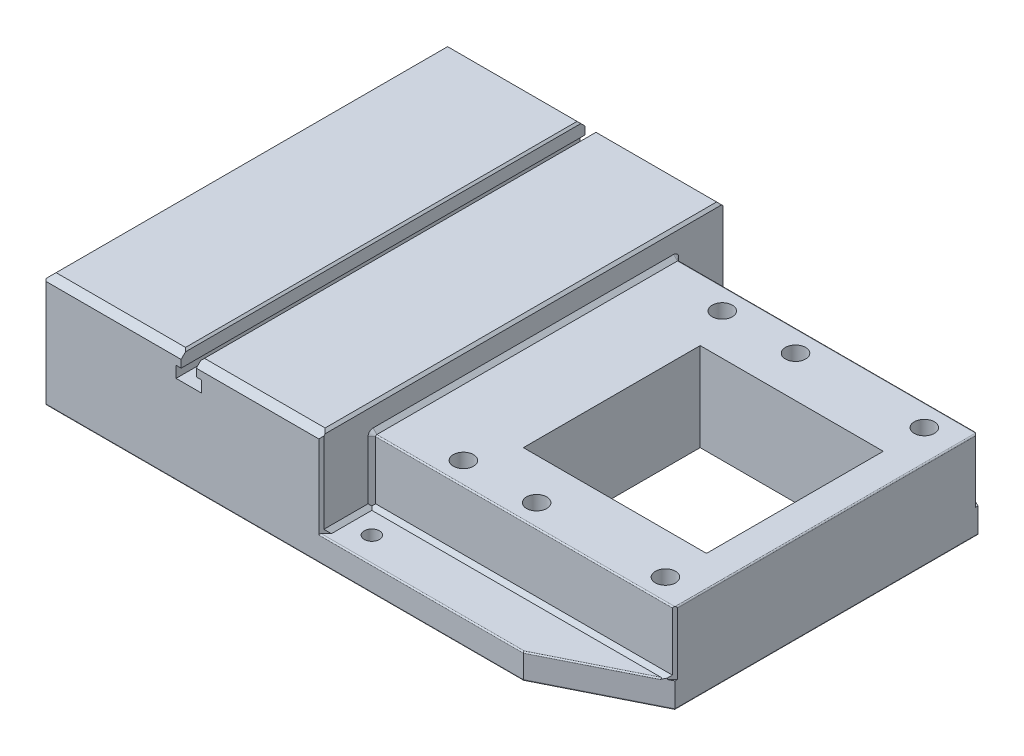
ISO-10303-21;
HEADER;
FILE_DESCRIPTION(('STEP AP214'),'2;1');
FILE_NAME('part.step','',(''),(''),'','','');
FILE_SCHEMA(('AUTOMOTIVE_DESIGN { 1 0 10303 214 1 1 1 1 }'));
ENDSEC;
DATA;
#1=APPLICATION_CONTEXT('core data for automotive mechanical design processes');
#2=APPLICATION_PROTOCOL_DEFINITION('international standard','automotive_design',2000,#1);
#3=PRODUCT_CONTEXT('',#1,'mechanical');
#4=PRODUCT('Part','Part','',(#3));
#5=PRODUCT_RELATED_PRODUCT_CATEGORY('part','',(#4));
#6=PRODUCT_DEFINITION_FORMATION('','',#4);
#7=PRODUCT_DEFINITION_CONTEXT('part definition',#1,'design');
#8=PRODUCT_DEFINITION('design','',#6,#7);
#9=PRODUCT_DEFINITION_SHAPE('','',#8);
#10=(LENGTH_UNIT() NAMED_UNIT(*) SI_UNIT(.MILLI.,.METRE.));
#11=(NAMED_UNIT(*) PLANE_ANGLE_UNIT() SI_UNIT($,.RADIAN.));
#12=(NAMED_UNIT(*) SI_UNIT($,.STERADIAN.) SOLID_ANGLE_UNIT());
#13=UNCERTAINTY_MEASURE_WITH_UNIT(LENGTH_MEASURE(1.E-05),#10,'distance_accuracy_value','');
#14=(GEOMETRIC_REPRESENTATION_CONTEXT(3) GLOBAL_UNCERTAINTY_ASSIGNED_CONTEXT((#13)) GLOBAL_UNIT_ASSIGNED_CONTEXT((#10,
#11,#12)) REPRESENTATION_CONTEXT('',''));
#15=CARTESIAN_POINT('',(0.,0.,0.));
#16=DIRECTION('',(0.,0.,1.));
#17=DIRECTION('',(1.,0.,0.));
#18=AXIS2_PLACEMENT_3D('',#15,#16,#17);
#19=CARTESIAN_POINT('',(0.,90.,0.));
#20=DIRECTION('',(0.,1.,0.));
#21=DIRECTION('',(0.,0.,1.));
#22=AXIS2_PLACEMENT_3D('',#19,#20,#21);
#23=PLANE('',#22);
#24=DIRECTION('',(1.,0.,0.));
#25=VECTOR('',#24,1.);
#26=CARTESIAN_POINT('',(-164.5,90.,155.));
#27=LINE('',#26,#25);
#28=CARTESIAN_POINT('',(-112.5,90.,155.));
#29=VERTEX_POINT('',#28);
#30=CARTESIAN_POINT('',(-215.,90.,155.));
#31=VERTEX_POINT('',#30);
#32=EDGE_CURVE('E1231',#29,#31,#27,.F.);
#33=ORIENTED_EDGE('',*,*,#32,.F.);
#34=DIRECTION('',(0.,0.,1.));
#35=VECTOR('',#34,1.);
#36=CARTESIAN_POINT('',(-112.5,90.,-2.273736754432E-13));
#37=LINE('',#36,#35);
#38=CARTESIAN_POINT('',(-112.5,90.,-155.));
#39=VERTEX_POINT('',#38);
#40=EDGE_CURVE('E1890',#39,#29,#37,.T.);
#41=ORIENTED_EDGE('',*,*,#40,.F.);
#42=DIRECTION('',(1.,0.,0.));
#43=VECTOR('',#42,1.);
#44=CARTESIAN_POINT('',(-164.5,90.,-155.));
#45=LINE('',#44,#43);
#46=CARTESIAN_POINT('',(-215.,90.,-155.));
#47=VERTEX_POINT('',#46);
#48=EDGE_CURVE('E1024',#47,#39,#45,.T.);
#49=ORIENTED_EDGE('',*,*,#48,.F.);
#50=DIRECTION('',(0.,0.,1.));
#51=VECTOR('',#50,1.);
#52=CARTESIAN_POINT('',(-215.,90.,-1.705302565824E-13));
#53=LINE('',#52,#51);
#54=EDGE_CURVE('E1241',#31,#47,#53,.F.);
#55=ORIENTED_EDGE('',*,*,#54,.F.);
#56=EDGE_LOOP('',(#33,#41,#49,#55));
#57=FACE_BOUND('',#56,.T.);
#58=ADVANCED_FACE('F16',(#57),#23,.T.);
#59=CARTESIAN_POINT('',(-111.75,89.25,-2.273736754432E-13));
#60=DIRECTION('',(0.707106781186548,0.707106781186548,0.));
#61=DIRECTION('',(-0.707106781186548,0.707106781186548,0.));
#62=AXIS2_PLACEMENT_3D('',#59,#60,#61);
#63=PLANE('',#62);
#64=DIRECTION('',(0.,0.,1.));
#65=VECTOR('',#64,1.);
#66=CARTESIAN_POINT('',(-111.,88.5,160.));
#67=LINE('',#66,#65);
#68=CARTESIAN_POINT('',(-111.,88.5,156.5));
#69=VERTEX_POINT('',#68);
#70=CARTESIAN_POINT('',(-111.,88.5,-156.5));
#71=VERTEX_POINT('',#70);
#72=EDGE_CURVE('E1004',#69,#71,#67,.F.);
#73=ORIENTED_EDGE('',*,*,#72,.T.);
#74=DIRECTION('',(0.577350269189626,-0.577350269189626,-0.577350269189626));
#75=VECTOR('',#74,1.);
#76=CARTESIAN_POINT('',(-112.5,90.,-155.));
#77=LINE('',#76,#75);
#78=EDGE_CURVE('E1910',#39,#71,#77,.T.);
#79=ORIENTED_EDGE('',*,*,#78,.F.);
#80=ORIENTED_EDGE('',*,*,#40,.T.);
#81=DIRECTION('',(-0.577350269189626,0.577350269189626,-0.577350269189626));
#82=VECTOR('',#81,1.);
#83=CARTESIAN_POINT('',(-111.,88.5,156.5));
#84=LINE('',#83,#82);
#85=EDGE_CURVE('E1230',#69,#29,#84,.T.);
#86=ORIENTED_EDGE('',*,*,#85,.F.);
#87=EDGE_LOOP('',(#73,#79,#80,#86));
#88=FACE_BOUND('',#87,.T.);
#89=ADVANCED_FACE('F2561',(#88),#63,.T.);
#90=CARTESIAN_POINT('',(0.,90.,0.));
#91=DIRECTION('',(0.,1.,0.));
#92=DIRECTION('',(0.,0.,1.));
#93=AXIS2_PLACEMENT_3D('',#90,#91,#92);
#94=PLANE('',#93);
#95=DIRECTION('',(1.,0.,0.));
#96=VECTOR('',#95,1.);
#97=CARTESIAN_POINT('',(-50.5,90.,-155.));
#98=LINE('',#97,#96);
#99=CARTESIAN_POINT('',(-97.5,90.,-155.));
#100=VERTEX_POINT('',#99);
#101=CARTESIAN_POINT('',(-1.99999999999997,90.,-155.));
#102=VERTEX_POINT('',#101);
#103=EDGE_CURVE('E946',#100,#102,#98,.T.);
#104=ORIENTED_EDGE('',*,*,#103,.F.);
#105=DIRECTION('',(0.,0.,1.));
#106=VECTOR('',#105,1.);
#107=CARTESIAN_POINT('',(-97.5,90.,1.136868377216E-13));
#108=LINE('',#107,#106);
#109=CARTESIAN_POINT('',(-97.5,90.,155.));
#110=VERTEX_POINT('',#109);
#111=EDGE_CURVE('E1889',#110,#100,#108,.F.);
#112=ORIENTED_EDGE('',*,*,#111,.F.);
#113=DIRECTION('',(1.,0.,0.));
#114=VECTOR('',#113,1.);
#115=CARTESIAN_POINT('',(-50.5,90.,155.));
#116=LINE('',#115,#114);
#117=CARTESIAN_POINT('',(-1.99999999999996,90.,155.));
#118=VERTEX_POINT('',#117);
#119=EDGE_CURVE('E1901',#118,#110,#116,.F.);
#120=ORIENTED_EDGE('',*,*,#119,.F.);
#121=DIRECTION('',(0.,0.,1.));
#122=VECTOR('',#121,1.);
#123=CARTESIAN_POINT('',(-2.,90.,-1.42108547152E-13));
#124=LINE('',#123,#122);
#125=EDGE_CURVE('E1887',#102,#118,#124,.T.);
#126=ORIENTED_EDGE('',*,*,#125,.F.);
#127=EDGE_LOOP('',(#104,#112,#120,#126));
#128=FACE_BOUND('',#127,.T.);
#129=ADVANCED_FACE('F1943',(#128),#94,.T.);
#130=CARTESIAN_POINT('',(-1.,89.,-1.42108547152E-13));
#131=DIRECTION('',(0.707106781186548,0.707106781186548,0.));
#132=DIRECTION('',(-0.707106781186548,0.707106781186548,0.));
#133=AXIS2_PLACEMENT_3D('',#130,#131,#132);
#134=PLANE('',#133);
#135=DIRECTION('',(0.,0.,-1.));
#136=VECTOR('',#135,1.);
#137=CARTESIAN_POINT('',(0.,88.,160.));
#138=LINE('',#137,#136);
#139=CARTESIAN_POINT('',(0.,88.,-157.));
#140=VERTEX_POINT('',#139);
#141=CARTESIAN_POINT('',(0.,88.,157.));
#142=VERTEX_POINT('',#141);
#143=EDGE_CURVE('E1874',#140,#142,#138,.F.);
#144=ORIENTED_EDGE('',*,*,#143,.F.);
#145=DIRECTION('',(0.577350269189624,-0.577350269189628,-0.577350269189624));
#146=VECTOR('',#145,1.);
#147=CARTESIAN_POINT('',(-1.99999999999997,90.,-155.));
#148=LINE('',#147,#146);
#149=EDGE_CURVE('E1309',#102,#140,#148,.T.);
#150=ORIENTED_EDGE('',*,*,#149,.F.);
#151=ORIENTED_EDGE('',*,*,#125,.T.);
#152=DIRECTION('',(-0.577350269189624,0.577350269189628,-0.577350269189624));
#153=VECTOR('',#152,1.);
#154=CARTESIAN_POINT('',(0.,88.,157.));
#155=LINE('',#154,#153);
#156=EDGE_CURVE('E1246',#142,#118,#155,.T.);
#157=ORIENTED_EDGE('',*,*,#156,.F.);
#158=EDGE_LOOP('',(#144,#150,#151,#157));
#159=FACE_BOUND('',#158,.T.);
#160=ADVANCED_FACE('F2554',(#159),#134,.T.);
#161=CARTESIAN_POINT('',(-98.25,89.25,1.136868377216E-13));
#162=DIRECTION('',(-0.707106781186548,0.707106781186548,0.));
#163=DIRECTION('',(-0.707106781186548,-0.707106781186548,0.));
#164=AXIS2_PLACEMENT_3D('',#161,#162,#163);
#165=PLANE('',#164);
#166=DIRECTION('',(0.,0.,-1.));
#167=VECTOR('',#166,1.);
#168=CARTESIAN_POINT('',(-99.,88.5,160.));
#169=LINE('',#168,#167);
#170=CARTESIAN_POINT('',(-99.,88.5,-156.5));
#171=VERTEX_POINT('',#170);
#172=CARTESIAN_POINT('',(-99.,88.5,156.5));
#173=VERTEX_POINT('',#172);
#174=EDGE_CURVE('E957',#171,#173,#169,.F.);
#175=ORIENTED_EDGE('',*,*,#174,.T.);
#176=DIRECTION('',(-0.577350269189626,-0.577350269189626,0.577350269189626));
#177=VECTOR('',#176,1.);
#178=CARTESIAN_POINT('',(-97.5,90.,155.));
#179=LINE('',#178,#177);
#180=EDGE_CURVE('E1899',#110,#173,#179,.T.);
#181=ORIENTED_EDGE('',*,*,#180,.F.);
#182=ORIENTED_EDGE('',*,*,#111,.T.);
#183=DIRECTION('',(0.577350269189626,0.577350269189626,0.577350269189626));
#184=VECTOR('',#183,1.);
#185=CARTESIAN_POINT('',(-99.,88.5,-156.5));
#186=LINE('',#185,#184);
#187=EDGE_CURVE('E917',#171,#100,#186,.T.);
#188=ORIENTED_EDGE('',*,*,#187,.F.);
#189=EDGE_LOOP('',(#175,#181,#182,#188));
#190=FACE_BOUND('',#189,.T.);
#191=ADVANCED_FACE('F1950',(#190),#165,.T.);
#192=CARTESIAN_POINT('',(-0.0181404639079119,69.,119.));
#193=DIRECTION('',(-1.,0.,0.));
#194=DIRECTION('',(0.,0.,1.));
#195=AXIS2_PLACEMENT_3D('',#192,#193,#194);
#196=CONICAL_SURFACE('',#195,4.01785952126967,0.785363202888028);
#197=CARTESIAN_POINT('',(0.000105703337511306,72.9998942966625,119.));
#198=DIRECTION('',(0.707106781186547,-0.707106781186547,0.));
#199=VECTOR('',#198,1.);
#200=LINE('',#197,#199);
#201=CARTESIAN_POINT('',(3.27262777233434E-05,72.9998258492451,119.));
#202=VERTEX_POINT('',#201);
#203=CARTESIAN_POINT('',(2.9999573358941,70.0000094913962,118.999999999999));
#204=VERTEX_POINT('',#203);
#205=EDGE_CURVE('E884',#202,#204,#200,.T.);
#206=ORIENTED_EDGE('',*,*,#205,.F.);
#207=CARTESIAN_POINT('',(0.,69.00000007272,122.9999533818));
#208=CARTESIAN_POINT('',(0.,69.7629154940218,122.999814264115));
#209=CARTESIAN_POINT('',(0.,70.4722885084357,122.719050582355));
#210=CARTESIAN_POINT('',(0.,70.8488413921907,122.570014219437));
#211=CARTESIAN_POINT('',(0.,71.1887046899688,122.347866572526));
#212=CARTESIAN_POINT('',(0.,71.5349600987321,122.121540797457));
#213=CARTESIAN_POINT('',(0.,71.8282535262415,121.828311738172));
#214=CARTESIAN_POINT('',(0.,72.1207894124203,121.535840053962));
#215=CARTESIAN_POINT('',(0.,72.3477765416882,121.18873705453));
#216=CARTESIAN_POINT('',(0.,72.5694237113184,120.849799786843));
#217=CARTESIAN_POINT('',(0.,72.7189249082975,120.472302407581));
#218=CARTESIAN_POINT('',(0.,72.9996532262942,119.763450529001));
#219=CARTESIAN_POINT('',(0.,72.99975445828,119.));
#220=B_SPLINE_CURVE_WITH_KNOTS('',2,(#207,#208,#209,#210,#211,#212,#213,#214,#215,#216,#217,
#218,#219),.UNSPECIFIED.,.F.,.F.,(3,2,2,2,2,2,3),(0.,0.25,0.375,0.5,0.625,0.75,1.),.UNSPECIFIED.);
#221=CARTESIAN_POINT('',(-6.31530097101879E-05,69.0000000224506,122.999916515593));
#222=VERTEX_POINT('',#221);
#223=EDGE_CURVE('E649',#222,#202,#220,.T.);
#224=ORIENTED_EDGE('',*,*,#223,.F.);
#225=CARTESIAN_POINT('',(2.99999999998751,69.00000002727,119.999999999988));
#226=DIRECTION('',(-0.707106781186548,0.,0.707106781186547));
#227=VECTOR('',#226,1.);
#228=LINE('',#225,#227);
#229=CARTESIAN_POINT('',(2.9999794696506,69.0000000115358,119.999983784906));
#230=VERTEX_POINT('',#229);
#231=EDGE_CURVE('E701',#230,#222,#228,.T.);
#232=ORIENTED_EDGE('',*,*,#231,.F.);
#233=CARTESIAN_POINT('',(2.99994698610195,70.,119.));
#234=CARTESIAN_POINT('',(2.99994744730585,70.0000003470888,119.016362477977));
#235=CARTESIAN_POINT('',(2.99994790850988,69.9995984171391,119.03272492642));
#236=CARTESIAN_POINT('',(2.99994883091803,69.9979924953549,119.065410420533));
#237=CARTESIAN_POINT('',(2.99994929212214,69.9967885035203,119.081733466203));
#238=CARTESIAN_POINT('',(2.99995021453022,69.9935809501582,119.114300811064));
#239=CARTESIAN_POINT('',(2.9999506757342,69.9915773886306,119.130545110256));
#240=CARTESIAN_POINT('',(2.99995159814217,69.9867756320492,119.162915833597));
#241=CARTESIAN_POINT('',(2.99995205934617,69.9839774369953,119.179042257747));
#242=CARTESIAN_POINT('',(2.99995298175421,69.9775931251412,119.211138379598));
#243=CARTESIAN_POINT('',(2.99995344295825,69.974007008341,119.2271080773));
#244=CARTESIAN_POINT('',(2.99995436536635,69.9660555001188,119.25885227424));
#245=CARTESIAN_POINT('',(2.99995482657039,69.9616901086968,119.274626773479));
#246=CARTESIAN_POINT('',(2.99995574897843,69.9521905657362,119.305942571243));
#247=CARTESIAN_POINT('',(2.99995621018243,69.9470564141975,119.321483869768));
#248=CARTESIAN_POINT('',(2.99995713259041,69.9360317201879,119.352295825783));
#249=CARTESIAN_POINT('',(2.9999575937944,69.9301411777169,119.367566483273));
#250=CARTESIAN_POINT('',(2.99995851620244,69.9176178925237,119.39780036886));
#251=CARTESIAN_POINT('',(2.99995897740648,69.9109851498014,119.412763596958));
#252=CARTESIAN_POINT('',(2.99995989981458,69.896993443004,119.442346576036));
#253=CARTESIAN_POINT('',(2.99996036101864,69.8896344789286,119.456966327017));
#254=CARTESIAN_POINT('',(2.99996128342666,69.8742080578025,119.485827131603));
#255=CARTESIAN_POINT('',(2.99996174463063,69.8661406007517,119.500068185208));
#256=CARTESIAN_POINT('',(2.99996266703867,69.8493166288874,119.528137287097));
#257=CARTESIAN_POINT('',(2.99996312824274,69.840560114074,119.541965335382));
#258=CARTESIAN_POINT('',(2.99996405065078,69.8223791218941,119.569175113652));
#259=CARTESIAN_POINT('',(2.99996451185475,69.8129546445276,119.582556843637));
#260=CARTESIAN_POINT('',(2.99996543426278,69.7934604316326,119.608841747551));
#261=CARTESIAN_POINT('',(2.99996589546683,69.7833906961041,119.621744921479));
#262=CARTESIAN_POINT('',(2.99996681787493,69.7626302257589,119.647041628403));
#263=CARTESIAN_POINT('',(2.99996727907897,69.7519394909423,119.659435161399));
#264=CARTESIAN_POINT('',(2.99996820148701,69.7299627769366,119.683682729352));
#265=CARTESIAN_POINT('',(2.99996866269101,69.7186767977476,119.69553676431));
#266=CARTESIAN_POINT('',(2.99996958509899,69.6955367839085,119.71867677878));
#267=CARTESIAN_POINT('',(2.99997004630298,69.6836827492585,119.729962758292));
#268=CARTESIAN_POINT('',(2.99997096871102,69.6594351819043,119.751939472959));
#269=CARTESIAN_POINT('',(2.99997142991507,69.6470416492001,119.762630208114));
#270=CARTESIAN_POINT('',(2.99997235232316,69.6217449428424,119.783390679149));
#271=CARTESIAN_POINT('',(2.99997281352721,69.6088417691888,119.793460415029));
#272=CARTESIAN_POINT('',(2.99997373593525,69.5825568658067,119.812954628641));
#273=CARTESIAN_POINT('',(2.99997419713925,69.5691751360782,119.822379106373));
#274=CARTESIAN_POINT('',(2.99997511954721,69.541965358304,119.840560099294));
#275=CARTESIAN_POINT('',(2.99997558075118,69.5281373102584,119.849316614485));
#276=CARTESIAN_POINT('',(2.99997650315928,69.500068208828,119.866140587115));
#277=CARTESIAN_POINT('',(2.99997696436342,69.4858271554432,119.874208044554));
#278=CARTESIAN_POINT('',(2.9999778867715,69.4569663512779,119.889634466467));
#279=CARTESIAN_POINT('',(2.99997834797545,69.4423466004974,119.896993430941));
#280=CARTESIAN_POINT('',(2.99997927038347,69.4127636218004,119.910985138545));
#281=CARTESIAN_POINT('',(2.99997973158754,69.3978003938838,119.917617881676));
#282=CARTESIAN_POINT('',(2.9999806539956,69.367566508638,119.930141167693));
#283=CARTESIAN_POINT('',(2.99998111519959,69.3522958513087,119.936031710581));
#284=CARTESIAN_POINT('',(2.99998203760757,69.3214838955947,119.947056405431));
#285=CARTESIAN_POINT('',(2.99998249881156,69.3059425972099,119.952190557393));
#286=CARTESIAN_POINT('',(2.9999834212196,69.274626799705,119.961690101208));
#287=CARTESIAN_POINT('',(2.99998388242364,69.2588523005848,119.96605549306));
#288=CARTESIAN_POINT('',(2.99998480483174,69.2271081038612,119.974007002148));
#289=CARTESIAN_POINT('',(2.99998526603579,69.2111384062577,119.977593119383));
#290=CARTESIAN_POINT('',(2.99998618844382,69.1790422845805,119.983977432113));
#291=CARTESIAN_POINT('',(2.9999866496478,69.1629158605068,119.986775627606));
#292=CARTESIAN_POINT('',(2.99998757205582,69.1305451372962,119.991577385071));
#293=CARTESIAN_POINT('',(2.99998803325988,69.1143008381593,119.993580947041));
#294=CARTESIAN_POINT('',(2.99998895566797,69.0817334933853,119.996788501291));
#295=CARTESIAN_POINT('',(2.99998941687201,69.0654104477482,119.997992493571));
#296=CARTESIAN_POINT('',(2.99999033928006,69.0327249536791,119.999598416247));
#297=CARTESIAN_POINT('',(2.99999080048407,69.0163625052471,120.000000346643));
#298=CARTESIAN_POINT('',(2.99999126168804,69.0000000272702,120.));
#299=B_SPLINE_CURVE_WITH_KNOTS('',3,(#233,#234,#235,#236,#237,#238,#239,#240,#241,#242,#243,
#244,#245,#246,#247,#248,#249,#250,#251,#252,#253,#254,#255,#256,#257,#258,#259,#260,#261,#262,
#263,#264,#265,#266,#267,#268,#269,#270,#271,#272,#273,#274,#275,#276,#277,#278,#279,#280,#281,
#282,#283,#284,#285,#286,#287,#288,#289,#290,#291,#292,#293,#294,#295,#296,#297,#298),
.UNSPECIFIED.,.F.,.F.,(4,2,2,2,2,2,2,2,2,2,2,2,2,2,2,2,2,2,2,2,2,2,2,2,2,2,2,2,2,2,2,2,4),(0.,
0.0490824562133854,0.0981649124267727,0.14724736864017,0.196329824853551,0.245412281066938,
0.294494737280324,0.343577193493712,0.392659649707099,0.441742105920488,0.490824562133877,
0.53990701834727,0.588989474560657,0.63807193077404,0.687154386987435,0.736236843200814,
0.785319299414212,0.834401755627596,0.883484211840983,0.932566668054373,0.981649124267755,
1.03073158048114,1.07981403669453,1.12889649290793,1.17797894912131,1.22706140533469,
1.27614386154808,1.32522631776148,1.37430877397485,1.42339123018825,1.47247368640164,
1.52155614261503,1.57063859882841),.UNSPECIFIED.);
#300=EDGE_CURVE('E895',#204,#230,#299,.T.);
#301=ORIENTED_EDGE('',*,*,#300,.F.);
#302=EDGE_LOOP('',(#206,#224,#232,#301));
#303=FACE_BOUND('',#302,.T.);
#304=ADVANCED_FACE('F619',(#303),#196,.T.);
#305=CARTESIAN_POINT('',(-0.0181404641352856,69.,-119.));
#306=DIRECTION('',(-1.,0.,0.));
#307=DIRECTION('',(0.,0.,1.));
#308=AXIS2_PLACEMENT_3D('',#305,#306,#307);
#309=CONICAL_SURFACE('',#308,4.01785952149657,0.785363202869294);
#310=CARTESIAN_POINT('',(0.00010570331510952,69.,-122.99989429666));
#311=DIRECTION('',(0.707106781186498,0.,0.707106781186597));
#312=VECTOR('',#311,1.);
#313=LINE('',#310,#312);
#314=CARTESIAN_POINT('',(4.91508121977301E-05,69.,-122.99981730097));
#315=VERTEX_POINT('',#314);
#316=CARTESIAN_POINT('',(2.99995754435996,69.,-120.000010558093));
#317=VERTEX_POINT('',#316);
#318=EDGE_CURVE('E775',#315,#317,#313,.T.);
#319=ORIENTED_EDGE('',*,*,#318,.F.);
#320=CARTESIAN_POINT('',(0.,72.99995338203,-119.0000000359));
#321=CARTESIAN_POINT('',(0.,72.9998142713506,-119.762915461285));
#322=CARTESIAN_POINT('',(0.,72.7190505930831,-120.472288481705));
#323=CARTESIAN_POINT('',(0.,72.5700142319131,-120.848841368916));
#324=CARTESIAN_POINT('',(0.,72.347866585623,-121.188704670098));
#325=CARTESIAN_POINT('',(0.,72.1215408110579,-121.534960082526));
#326=CARTESIAN_POINT('',(0.,71.8283117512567,-121.82825351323));
#327=CARTESIAN_POINT('',(0.,71.5358400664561,-122.12078940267));
#328=CARTESIAN_POINT('',(0.,71.1887370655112,-122.347776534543));
#329=CARTESIAN_POINT('',(0.,70.8497997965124,-122.569423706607));
#330=CARTESIAN_POINT('',(0.,70.4723024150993,-122.71892490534));
#331=CARTESIAN_POINT('',(0.,69.7634505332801,-122.999653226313));
#332=CARTESIAN_POINT('',(0.,69.,-122.9997544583));
#333=B_SPLINE_CURVE_WITH_KNOTS('',2,(#320,#321,#322,#323,#324,#325,#326,#327,#328,#329,#330,
#331,#332),.UNSPECIFIED.,.F.,.F.,(3,2,2,2,2,2,3),(0.,0.25,0.375,0.5,0.625,0.75,1.),.UNSPECIFIED.);
#334=CARTESIAN_POINT('',(-6.32215493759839E-05,72.999921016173,-119.000000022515));
#335=VERTEX_POINT('',#334);
#336=EDGE_CURVE('E1264',#335,#315,#333,.T.);
#337=ORIENTED_EDGE('',*,*,#336,.F.);
#338=CARTESIAN_POINT('',(2.999997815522,70.000002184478,-119.0000000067));
#339=DIRECTION('',(-0.707106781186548,0.707106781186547,0.));
#340=VECTOR('',#339,1.);
#341=LINE('',#338,#340);
#342=CARTESIAN_POINT('',(2.99997877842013,69.999984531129,-119.000000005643));
#343=VERTEX_POINT('',#342);
#344=EDGE_CURVE('E881',#343,#335,#341,.T.);
#345=ORIENTED_EDGE('',*,*,#344,.F.);
#346=CARTESIAN_POINT('',(2.99994698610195,69.,-120.));
#347=CARTESIAN_POINT('',(2.99994744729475,69.0163624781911,-120.000000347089));
#348=CARTESIAN_POINT('',(2.99994790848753,69.0327249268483,-119.999598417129));
#349=CARTESIAN_POINT('',(2.9999488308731,69.0654104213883,-119.997992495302));
#350=CARTESIAN_POINT('',(2.99994929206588,69.0817334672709,-119.996788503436));
#351=CARTESIAN_POINT('',(2.99995021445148,69.1143008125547,-119.99358094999));
#352=CARTESIAN_POINT('',(2.99995067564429,69.1305451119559,-119.99157738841));
#353=CARTESIAN_POINT('',(2.9999515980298,69.1629158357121,-119.986775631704));
#354=CARTESIAN_POINT('',(2.9999520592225,69.1790422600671,-119.983977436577));
#355=CARTESIAN_POINT('',(2.99995298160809,69.2111383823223,-119.977593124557));
#356=CARTESIAN_POINT('',(2.99995344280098,69.2271080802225,-119.974007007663));
#357=CARTESIAN_POINT('',(2.99995436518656,69.2588522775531,-119.966055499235));
#358=CARTESIAN_POINT('',(2.99995482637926,69.2746267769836,-119.9616901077));
#359=CARTESIAN_POINT('',(2.99995574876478,69.305942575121,-119.952190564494));
#360=CARTESIAN_POINT('',(2.99995620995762,69.321483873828,-119.947056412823));
#361=CARTESIAN_POINT('',(2.99995713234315,69.3522958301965,-119.93603171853));
#362=CARTESIAN_POINT('',(2.99995759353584,69.3675664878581,-119.930141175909));
#363=CARTESIAN_POINT('',(2.99995851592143,69.397800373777,-119.917617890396));
#364=CARTESIAN_POINT('',(2.99995897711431,69.4127636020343,-119.910985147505));
#365=CARTESIAN_POINT('',(2.9999598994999,69.4423465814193,-119.896993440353));
#366=CARTESIAN_POINT('',(2.99996036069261,69.4569663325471,-119.889634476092));
#367=CARTESIAN_POINT('',(2.99996128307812,69.4858271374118,-119.874208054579));
#368=CARTESIAN_POINT('',(2.99996174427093,69.5000681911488,-119.866140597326));
#369=CARTESIAN_POINT('',(2.99996266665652,69.5281372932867,-119.849316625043));
#370=CARTESIAN_POINT('',(2.9999631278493,69.5419653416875,-119.840560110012));
#371=CARTESIAN_POINT('',(2.99996405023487,69.5691751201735,-119.822379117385));
#372=CARTESIAN_POINT('',(2.99996451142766,69.5825568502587,-119.812954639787));
#373=CARTESIAN_POINT('',(2.99996543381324,69.6088417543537,-119.793460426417));
#374=CARTESIAN_POINT('',(2.99996589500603,69.6217449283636,-119.783390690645));
#375=CARTESIAN_POINT('',(2.9999668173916,69.6470416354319,-119.7626302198));
#376=CARTESIAN_POINT('',(2.99996727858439,69.6594351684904,-119.751939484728));
#377=CARTESIAN_POINT('',(2.99996820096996,69.6836827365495,-119.7299627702));
#378=CARTESIAN_POINT('',(2.99996866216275,69.6955367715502,-119.718676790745));
#379=CARTESIAN_POINT('',(2.99996958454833,69.7186767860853,-119.695536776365));
#380=CARTESIAN_POINT('',(2.99997004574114,69.7299627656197,-119.68368274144));
#381=CARTESIAN_POINT('',(2.99997096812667,69.7519394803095,-119.659435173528));
#382=CARTESIAN_POINT('',(2.99997142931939,69.7626302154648,-119.647041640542));
#383=CARTESIAN_POINT('',(2.99997235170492,69.7833906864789,-119.621744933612));
#384=CARTESIAN_POINT('',(2.99997281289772,69.7934604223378,-119.60884175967));
#385=CARTESIAN_POINT('',(2.99997373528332,69.8129546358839,-119.582556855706));
#386=CARTESIAN_POINT('',(2.99997419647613,69.822379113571,-119.569175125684));
#387=CARTESIAN_POINT('',(2.99997511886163,69.8405601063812,-119.541965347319));
#388=CARTESIAN_POINT('',(2.99997558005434,69.8493166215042,-119.528137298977));
#389=CARTESIAN_POINT('',(2.99997650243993,69.8661405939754,-119.500068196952));
#390=CARTESIAN_POINT('',(2.99997696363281,69.8742080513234,-119.485827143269));
#391=CARTESIAN_POINT('',(2.9999778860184,69.8896344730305,-119.456966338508));
#392=CARTESIAN_POINT('',(2.9999783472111,69.8969934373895,-119.442346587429));
#393=CARTESIAN_POINT('',(2.99997926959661,69.9109851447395,-119.412763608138));
#394=CARTESIAN_POINT('',(2.99997973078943,69.9176178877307,-119.397800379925));
#395=CARTESIAN_POINT('',(2.99998065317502,69.9301411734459,-119.36756649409));
#396=CARTESIAN_POINT('',(2.9999811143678,69.93603171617,-119.352295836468));
#397=CARTESIAN_POINT('',(2.99998203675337,69.9470564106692,-119.321483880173));
#398=CARTESIAN_POINT('',(2.99998249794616,69.9521905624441,-119.305942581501));
#399=CARTESIAN_POINT('',(2.99998342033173,69.9616901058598,-119.274626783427));
#400=CARTESIAN_POINT('',(2.99998388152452,69.9660554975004,-119.258852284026));
#401=CARTESIAN_POINT('',(2.9999848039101,69.9740070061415,-119.227108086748));
#402=CARTESIAN_POINT('',(2.99998526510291,69.9775931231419,-119.211138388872));
#403=CARTESIAN_POINT('',(2.99998618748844,69.9839774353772,-119.17904226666));
#404=CARTESIAN_POINT('',(2.99998664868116,69.986775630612,-119.162915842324));
#405=CARTESIAN_POINT('',(2.99998757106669,69.9915773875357,-119.1305451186));
#406=CARTESIAN_POINT('',(2.99998803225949,69.9935809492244,-119.114300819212));
#407=CARTESIAN_POINT('',(2.99998895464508,69.9967885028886,-119.081733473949));
#408=CARTESIAN_POINT('',(2.99998941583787,69.9979924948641,-119.065410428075));
#409=CARTESIAN_POINT('',(2.99999033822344,69.9995984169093,-119.032724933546));
#410=CARTESIAN_POINT('',(2.99999079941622,70.0000003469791,-119.016362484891));
#411=CARTESIAN_POINT('',(2.99999126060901,70.,-119.0000000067));
#412=B_SPLINE_CURVE_WITH_KNOTS('',3,(#346,#347,#348,#349,#350,#351,#352,#353,#354,#355,#356,
#357,#358,#359,#360,#361,#362,#363,#364,#365,#366,#367,#368,#369,#370,#371,#372,#373,#374,#375,
#376,#377,#378,#379,#380,#381,#382,#383,#384,#385,#386,#387,#388,#389,#390,#391,#392,#393,#394,
#395,#396,#397,#398,#399,#400,#401,#402,#403,#404,#405,#406,#407,#408,#409,#410,#411),
.UNSPECIFIED.,.F.,.F.,(4,2,2,2,2,2,2,2,2,2,2,2,2,2,2,2,2,2,2,2,2,2,2,2,2,2,2,2,2,2,2,2,4),(0.,
0.0490824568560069,0.0981649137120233,0.14724737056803,0.196329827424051,0.245412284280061,
0.294494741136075,0.343577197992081,0.392659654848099,0.441742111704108,0.490824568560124,
0.539907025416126,0.588989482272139,0.638071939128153,0.687154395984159,0.736236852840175,
0.785319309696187,0.834401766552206,0.883484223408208,0.932566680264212,0.981649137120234,
1.03073159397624,1.07981405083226,1.12889650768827,1.17797896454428,1.22706142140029,
1.2761438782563,1.32522633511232,1.37430879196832,1.42339124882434,1.47247370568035,
1.52155616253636,1.57063861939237),.UNSPECIFIED.);
#413=EDGE_CURVE('E601',#317,#343,#412,.T.);
#414=ORIENTED_EDGE('',*,*,#413,.F.);
#415=EDGE_LOOP('',(#319,#337,#345,#414));
#416=FACE_BOUND('',#415,.T.);
#417=ADVANCED_FACE('F608',(#416),#309,.T.);
#418=CARTESIAN_POINT('',(0.,30.,0.));
#419=DIRECTION('',(0.,1.,0.));
#420=DIRECTION('',(0.,0.,1.));
#421=AXIS2_PLACEMENT_3D('',#418,#419,#420);
#422=PLANE('',#421);
#423=CARTESIAN_POINT('',(215.,30.,-102.5));
#424=DIRECTION('',(0.,1.,0.));
#425=DIRECTION('',(0.,0.,1.));
#426=AXIS2_PLACEMENT_3D('',#423,#424,#425);
#427=CIRCLE('',#426,8.);
#428=CARTESIAN_POINT('',(215.,30.,-94.5));
#429=VERTEX_POINT('',#428);
#430=EDGE_CURVE('E877',#429,#429,#427,.T.);
#431=ORIENTED_EDGE('',*,*,#430,.T.);
#432=EDGE_LOOP('',(#431));
#433=FACE_BOUND('',#432,.T.);
#434=ADVANCED_FACE('F618',(#433),#422,.T.);
#435=CARTESIAN_POINT('',(0.,30.,0.));
#436=DIRECTION('',(0.,1.,0.));
#437=DIRECTION('',(0.,0.,1.));
#438=AXIS2_PLACEMENT_3D('',#435,#436,#437);
#439=PLANE('',#438);
#440=CARTESIAN_POINT('',(215.,30.,102.5));
#441=DIRECTION('',(0.,1.,0.));
#442=DIRECTION('',(0.,0.,1.));
#443=AXIS2_PLACEMENT_3D('',#440,#441,#442);
#444=CIRCLE('',#443,8.);
#445=CARTESIAN_POINT('',(215.,30.,110.5));
#446=VERTEX_POINT('',#445);
#447=EDGE_CURVE('E874',#446,#446,#444,.T.);
#448=ORIENTED_EDGE('',*,*,#447,.T.);
#449=EDGE_LOOP('',(#448));
#450=FACE_BOUND('',#449,.T.);
#451=ADVANCED_FACE('F2612',(#450),#439,.T.);
#452=CARTESIAN_POINT('',(0.,30.,0.));
#453=DIRECTION('',(0.,1.,0.));
#454=DIRECTION('',(0.,0.,1.));
#455=AXIS2_PLACEMENT_3D('',#452,#453,#454);
#456=PLANE('',#455);
#457=CARTESIAN_POINT('',(113.,30.,-102.5));
#458=DIRECTION('',(0.,1.,0.));
#459=DIRECTION('',(0.,0.,1.));
#460=AXIS2_PLACEMENT_3D('',#457,#458,#459);
#461=CIRCLE('',#460,8.);
#462=CARTESIAN_POINT('',(113.,30.,-94.5));
#463=VERTEX_POINT('',#462);
#464=EDGE_CURVE('E871',#463,#463,#461,.T.);
#465=ORIENTED_EDGE('',*,*,#464,.T.);
#466=EDGE_LOOP('',(#465));
#467=FACE_BOUND('',#466,.T.);
#468=ADVANCED_FACE('F2619',(#467),#456,.T.);
#469=CARTESIAN_POINT('',(0.,30.,0.));
#470=DIRECTION('',(0.,1.,0.));
#471=DIRECTION('',(0.,0.,1.));
#472=AXIS2_PLACEMENT_3D('',#469,#470,#471);
#473=PLANE('',#472);
#474=CARTESIAN_POINT('',(113.,30.,102.5));
#475=DIRECTION('',(0.,1.,0.));
#476=DIRECTION('',(0.,0.,1.));
#477=AXIS2_PLACEMENT_3D('',#474,#475,#476);
#478=CIRCLE('',#477,8.);
#479=CARTESIAN_POINT('',(113.,30.,110.5));
#480=VERTEX_POINT('',#479);
#481=EDGE_CURVE('E868',#480,#480,#478,.T.);
#482=ORIENTED_EDGE('',*,*,#481,.T.);
#483=EDGE_LOOP('',(#482));
#484=FACE_BOUND('',#483,.T.);
#485=ADVANCED_FACE('F2626',(#484),#473,.T.);
#486=CARTESIAN_POINT('',(0.,30.,0.));
#487=DIRECTION('',(0.,1.,0.));
#488=DIRECTION('',(0.,0.,1.));
#489=AXIS2_PLACEMENT_3D('',#486,#487,#488);
#490=PLANE('',#489);
#491=CARTESIAN_POINT('',(55.,30.,102.5));
#492=DIRECTION('',(0.,1.,0.));
#493=DIRECTION('',(0.,0.,1.));
#494=AXIS2_PLACEMENT_3D('',#491,#492,#493);
#495=CIRCLE('',#494,8.);
#496=CARTESIAN_POINT('',(55.,30.,110.5));
#497=VERTEX_POINT('',#496);
#498=EDGE_CURVE('E865',#497,#497,#495,.T.);
#499=ORIENTED_EDGE('',*,*,#498,.T.);
#500=EDGE_LOOP('',(#499));
#501=FACE_BOUND('',#500,.T.);
#502=ADVANCED_FACE('F2634',(#501),#490,.T.);
#503=CARTESIAN_POINT('',(0.,30.,0.));
#504=DIRECTION('',(0.,1.,0.));
#505=DIRECTION('',(0.,0.,1.));
#506=AXIS2_PLACEMENT_3D('',#503,#504,#505);
#507=PLANE('',#506);
#508=CARTESIAN_POINT('',(55.,30.,-102.5));
#509=DIRECTION('',(0.,1.,0.));
#510=DIRECTION('',(0.,0.,1.));
#511=AXIS2_PLACEMENT_3D('',#508,#509,#510);
#512=CIRCLE('',#511,8.);
#513=CARTESIAN_POINT('',(55.,30.,-94.5));
#514=VERTEX_POINT('',#513);
#515=EDGE_CURVE('E861',#514,#514,#512,.T.);
#516=ORIENTED_EDGE('',*,*,#515,.T.);
#517=EDGE_LOOP('',(#516));
#518=FACE_BOUND('',#517,.T.);
#519=ADVANCED_FACE('F755',(#518),#507,.T.);
#520=CARTESIAN_POINT('',(1.500000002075,44.50000010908,-121.4999999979));
#521=DIRECTION('',(0.707106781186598,0.,-0.707106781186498));
#522=DIRECTION('',(-0.707106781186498,0.,-0.707106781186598));
#523=AXIS2_PLACEMENT_3D('',#520,#521,#522);
#524=PLANE('',#523);
#525=ORIENTED_EDGE('',*,*,#318,.T.);
#526=CARTESIAN_POINT('',(3.,23.,-120.));
#527=DIRECTION('',(-1.15247604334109E-06,0.999999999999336,0.));
#528=VECTOR('',#527,1.);
#529=LINE('',#526,#528);
#530=CARTESIAN_POINT('',(2.99999999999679,23.,-119.999999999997));
#531=VERTEX_POINT('',#530);
#532=EDGE_CURVE('E738',#531,#317,#529,.T.);
#533=ORIENTED_EDGE('',*,*,#532,.F.);
#534=DIRECTION('',(0.577350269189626,0.577350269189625,0.577350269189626));
#535=VECTOR('',#534,1.);
#536=CARTESIAN_POINT('',(1.49999999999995,21.5,-121.5));
#537=LINE('',#536,#535);
#538=CARTESIAN_POINT('',(1.49999999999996,21.5,-121.5));
#539=VERTEX_POINT('',#538);
#540=EDGE_CURVE('E1289',#539,#531,#537,.T.);
#541=ORIENTED_EDGE('',*,*,#540,.F.);
#542=DIRECTION('',(0.577350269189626,-0.577350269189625,0.577350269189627));
#543=VECTOR('',#542,1.);
#544=CARTESIAN_POINT('',(0.,23.,-123.));
#545=LINE('',#544,#543);
#546=CARTESIAN_POINT('',(-3.09919191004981E-12,23.,-122.999999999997));
#547=VERTEX_POINT('',#546);
#548=EDGE_CURVE('E1296',#547,#539,#545,.T.);
#549=ORIENTED_EDGE('',*,*,#548,.F.);
#550=CARTESIAN_POINT('',(0.,69.,-122.9997544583));
#551=DIRECTION('',(0.,-0.999999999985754,-5.33786304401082E-06));
#552=VECTOR('',#551,1.);
#553=LINE('',#550,#552);
#554=EDGE_CURVE('E1865',#315,#547,#553,.T.);
#555=ORIENTED_EDGE('',*,*,#554,.F.);
#556=EDGE_LOOP('',(#525,#533,#541,#549,#555));
#557=FACE_BOUND('',#556,.T.);
#558=ADVANCED_FACE('F745',(#557),#524,.T.);
#559=CARTESIAN_POINT('',(240.,20.,-120.));
#560=DIRECTION('',(0.,0.,-1.));
#561=DIRECTION('',(-1.,0.,0.));
#562=AXIS2_PLACEMENT_3D('',#559,#560,#561);
#563=PLANE('',#562);
#564=DIRECTION('',(1.,0.,0.));
#565=VECTOR('',#564,1.);
#566=CARTESIAN_POINT('',(117.,23.,-120.));
#567=LINE('',#566,#565);
#568=CARTESIAN_POINT('',(238.,23.,-120.));
#569=VERTEX_POINT('',#568);
#570=EDGE_CURVE('E1056',#531,#569,#567,.T.);
#571=ORIENTED_EDGE('',*,*,#570,.F.);
#572=ORIENTED_EDGE('',*,*,#532,.T.);
#573=DIRECTION('',(-1.,0.,0.));
#574=VECTOR('',#573,1.);
#575=CARTESIAN_POINT('',(839.656,69.,-120.));
#576=LINE('',#575,#574);
#577=CARTESIAN_POINT('',(238.,69.,-120.));
#578=VERTEX_POINT('',#577);
#579=EDGE_CURVE('E566',#578,#317,#576,.T.);
#580=ORIENTED_EDGE('',*,*,#579,.F.);
#581=DIRECTION('',(0.,1.,0.));
#582=VECTOR('',#581,1.);
#583=CARTESIAN_POINT('',(238.,45.,-120.));
#584=LINE('',#583,#582);
#585=EDGE_CURVE('E1112',#569,#578,#584,.T.);
#586=ORIENTED_EDGE('',*,*,#585,.F.);
#587=EDGE_LOOP('',(#571,#572,#580,#586));
#588=FACE_BOUND('',#587,.T.);
#589=ADVANCED_FACE('F754',(#588),#563,.T.);
#590=CARTESIAN_POINT('',(0.,20.,120.));
#591=DIRECTION('',(0.,0.,1.));
#592=DIRECTION('',(1.,0.,0.));
#593=AXIS2_PLACEMENT_3D('',#590,#591,#592);
#594=PLANE('',#593);
#595=CARTESIAN_POINT('',(2.99999999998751,23.,119.999999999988));
#596=DIRECTION('',(0.,1.,0.));
#597=VECTOR('',#596,1.);
#598=LINE('',#595,#597);
#599=CARTESIAN_POINT('',(2.99999563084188,23.,119.999999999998));
#600=VERTEX_POINT('',#599);
#601=EDGE_CURVE('E712',#600,#230,#598,.T.);
#602=ORIENTED_EDGE('',*,*,#601,.F.);
#603=DIRECTION('',(1.,0.,0.));
#604=VECTOR('',#603,1.);
#605=CARTESIAN_POINT('',(117.,23.,120.));
#606=LINE('',#605,#604);
#607=CARTESIAN_POINT('',(238.,23.,120.));
#608=VERTEX_POINT('',#607);
#609=EDGE_CURVE('E850',#608,#600,#606,.F.);
#610=ORIENTED_EDGE('',*,*,#609,.F.);
#611=DIRECTION('',(0.,1.,0.));
#612=VECTOR('',#611,1.);
#613=CARTESIAN_POINT('',(238.,45.,120.));
#614=LINE('',#613,#612);
#615=CARTESIAN_POINT('',(238.,69.,120.));
#616=VERTEX_POINT('',#615);
#617=EDGE_CURVE('E1072',#616,#608,#614,.F.);
#618=ORIENTED_EDGE('',*,*,#617,.F.);
#619=DIRECTION('',(1.,0.,0.));
#620=VECTOR('',#619,1.);
#621=CARTESIAN_POINT('',(-819.656,69.0000000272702,120.));
#622=LINE('',#621,#620);
#623=EDGE_CURVE('E902',#230,#616,#622,.T.);
#624=ORIENTED_EDGE('',*,*,#623,.F.);
#625=EDGE_LOOP('',(#602,#610,#618,#624));
#626=FACE_BOUND('',#625,.T.);
#627=ADVANCED_FACE('F681',(#626),#594,.T.);
#628=CARTESIAN_POINT('',(1.500000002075,44.50000010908,121.4999999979));
#629=DIRECTION('',(0.707106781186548,0.,0.707106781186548));
#630=DIRECTION('',(0.707106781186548,0.,-0.707106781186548));
#631=AXIS2_PLACEMENT_3D('',#628,#629,#630);
#632=PLANE('',#631);
#633=ORIENTED_EDGE('',*,*,#231,.T.);
#634=CARTESIAN_POINT('',(0.,23.,123.));
#635=DIRECTION('',(0.,0.999999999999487,-1.01343912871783E-06));
#636=VECTOR('',#635,1.);
#637=LINE('',#634,#636);
#638=CARTESIAN_POINT('',(1.03878537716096E-09,22.9999999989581,122.999999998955));
#639=VERTEX_POINT('',#638);
#640=EDGE_CURVE('E663',#639,#222,#637,.T.);
#641=ORIENTED_EDGE('',*,*,#640,.F.);
#642=DIRECTION('',(-0.577350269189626,0.577350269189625,0.577350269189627));
#643=VECTOR('',#642,1.);
#644=CARTESIAN_POINT('',(1.5,21.5,121.5));
#645=LINE('',#644,#643);
#646=CARTESIAN_POINT('',(1.49999999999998,21.5,121.5));
#647=VERTEX_POINT('',#646);
#648=EDGE_CURVE('E1275',#647,#639,#645,.T.);
#649=ORIENTED_EDGE('',*,*,#648,.F.);
#650=DIRECTION('',(-0.577350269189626,-0.577350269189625,0.577350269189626));
#651=VECTOR('',#650,1.);
#652=CARTESIAN_POINT('',(2.99999999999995,23.,120.));
#653=LINE('',#652,#651);
#654=EDGE_CURVE('E852',#600,#647,#653,.T.);
#655=ORIENTED_EDGE('',*,*,#654,.F.);
#656=ORIENTED_EDGE('',*,*,#601,.T.);
#657=EDGE_LOOP('',(#633,#641,#649,#655,#656));
#658=FACE_BOUND('',#657,.T.);
#659=ADVANCED_FACE('F670',(#658),#632,.T.);
#660=CARTESIAN_POINT('',(0.,20.,160.));
#661=DIRECTION('',(1.,0.,0.));
#662=DIRECTION('',(0.,0.,-1.));
#663=AXIS2_PLACEMENT_3D('',#660,#661,#662);
#664=PLANE('',#663);
#665=ORIENTED_EDGE('',*,*,#554,.T.);
#666=DIRECTION('',(0.,0.,1.));
#667=VECTOR('',#666,1.);
#668=CARTESIAN_POINT('',(0.,23.,-139.));
#669=LINE('',#668,#667);
#670=CARTESIAN_POINT('',(0.,23.,-158.));
#671=VERTEX_POINT('',#670);
#672=EDGE_CURVE('E1298',#671,#547,#669,.T.);
#673=ORIENTED_EDGE('',*,*,#672,.F.);
#674=DIRECTION('',(0.,1.,0.));
#675=VECTOR('',#674,1.);
#676=CARTESIAN_POINT('',(0.,55.,-158.));
#677=LINE('',#676,#675);
#678=CARTESIAN_POINT('',(0.,87.,-158.));
#679=VERTEX_POINT('',#678);
#680=EDGE_CURVE('E526',#679,#671,#677,.F.);
#681=ORIENTED_EDGE('',*,*,#680,.F.);
#682=DIRECTION('',(0.,0.707106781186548,0.707106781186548));
#683=VECTOR('',#682,1.);
#684=CARTESIAN_POINT('',(0.,87.5,-157.5));
#685=LINE('',#684,#683);
#686=EDGE_CURVE('E936',#140,#679,#685,.F.);
#687=ORIENTED_EDGE('',*,*,#686,.F.);
#688=ORIENTED_EDGE('',*,*,#143,.T.);
#689=DIRECTION('',(0.,-0.707106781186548,0.707106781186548));
#690=VECTOR('',#689,1.);
#691=CARTESIAN_POINT('',(0.,87.5,157.5));
#692=LINE('',#691,#690);
#693=CARTESIAN_POINT('',(0.,87.,158.));
#694=VERTEX_POINT('',#693);
#695=EDGE_CURVE('E1236',#694,#142,#692,.F.);
#696=ORIENTED_EDGE('',*,*,#695,.F.);
#697=DIRECTION('',(0.,1.,0.));
#698=VECTOR('',#697,1.);
#699=CARTESIAN_POINT('',(0.,55.,158.));
#700=LINE('',#699,#698);
#701=CARTESIAN_POINT('',(0.,23.,158.));
#702=VERTEX_POINT('',#701);
#703=EDGE_CURVE('E1224',#702,#694,#700,.T.);
#704=ORIENTED_EDGE('',*,*,#703,.F.);
#705=DIRECTION('',(0.,0.,1.));
#706=VECTOR('',#705,1.);
#707=CARTESIAN_POINT('',(0.,23.,139.));
#708=LINE('',#707,#706);
#709=EDGE_CURVE('E1268',#639,#702,#708,.T.);
#710=ORIENTED_EDGE('',*,*,#709,.F.);
#711=ORIENTED_EDGE('',*,*,#640,.T.);
#712=ORIENTED_EDGE('',*,*,#223,.T.);
#713=DIRECTION('',(0.,0.,1.));
#714=VECTOR('',#713,1.);
#715=CARTESIAN_POINT('',(0.,73.,160.));
#716=LINE('',#715,#714);
#717=EDGE_CURVE('E879',#335,#202,#716,.T.);
#718=ORIENTED_EDGE('',*,*,#717,.F.);
#719=ORIENTED_EDGE('',*,*,#336,.T.);
#720=EDGE_LOOP('',(#665,#673,#681,#687,#688,#696,#704,#710,#711,#712,#718,#719));
#721=FACE_BOUND('',#720,.T.);
#722=ADVANCED_FACE('F680',(#721),#664,.T.);
#723=CARTESIAN_POINT('',(-217.5,87.5,-1.705302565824E-13));
#724=DIRECTION('',(-0.707106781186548,0.707106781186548,0.));
#725=DIRECTION('',(-0.707106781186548,-0.707106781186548,0.));
#726=AXIS2_PLACEMENT_3D('',#723,#724,#725);
#727=PLANE('',#726);
#728=DIRECTION('',(0.,0.,1.));
#729=VECTOR('',#728,1.);
#730=CARTESIAN_POINT('',(-220.,85.,-160.));
#731=LINE('',#730,#729);
#732=CARTESIAN_POINT('',(-220.,85.,158.));
#733=VERTEX_POINT('',#732);
#734=CARTESIAN_POINT('',(-220.,85.,-158.));
#735=VERTEX_POINT('',#734);
#736=EDGE_CURVE('E844',#733,#735,#731,.F.);
#737=ORIENTED_EDGE('',*,*,#736,.F.);
#738=DIRECTION('',(0.577350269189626,0.577350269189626,0.577350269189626));
#739=VECTOR('',#738,1.);
#740=CARTESIAN_POINT('',(-220.,85.,158.));
#741=LINE('',#740,#739);
#742=CARTESIAN_POINT('',(-219.,86.,159.));
#743=VERTEX_POINT('',#742);
#744=EDGE_CURVE('E1234',#733,#743,#741,.T.);
#745=ORIENTED_EDGE('',*,*,#744,.T.);
#746=DIRECTION('',(-0.577350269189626,-0.577350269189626,0.577350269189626));
#747=VECTOR('',#746,1.);
#748=CARTESIAN_POINT('',(-215.,90.,155.));
#749=LINE('',#748,#747);
#750=EDGE_CURVE('E1227',#31,#743,#749,.T.);
#751=ORIENTED_EDGE('',*,*,#750,.F.);
#752=ORIENTED_EDGE('',*,*,#54,.T.);
#753=DIRECTION('',(0.577350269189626,0.577350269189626,0.577350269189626));
#754=VECTOR('',#753,1.);
#755=CARTESIAN_POINT('',(-219.,86.,-159.));
#756=LINE('',#755,#754);
#757=CARTESIAN_POINT('',(-219.,86.,-159.));
#758=VERTEX_POINT('',#757);
#759=EDGE_CURVE('E1021',#758,#47,#756,.T.);
#760=ORIENTED_EDGE('',*,*,#759,.F.);
#761=DIRECTION('',(-0.577350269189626,-0.577350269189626,0.577350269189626));
#762=VECTOR('',#761,1.);
#763=CARTESIAN_POINT('',(-219.,86.,-159.));
#764=LINE('',#763,#762);
#765=EDGE_CURVE('E1237',#758,#735,#764,.T.);
#766=ORIENTED_EDGE('',*,*,#765,.T.);
#767=EDGE_LOOP('',(#737,#745,#751,#752,#760,#766));
#768=FACE_BOUND('',#767,.T.);
#769=ADVANCED_FACE('F2060',(#768),#727,.T.);
#770=CARTESIAN_POINT('',(-50.5,87.5,157.5));
#771=DIRECTION('',(0.,0.707106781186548,0.707106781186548));
#772=DIRECTION('',(0.,-0.707106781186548,0.707106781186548));
#773=AXIS2_PLACEMENT_3D('',#770,#771,#772);
#774=PLANE('',#773);
#775=ORIENTED_EDGE('',*,*,#119,.T.);
#776=ORIENTED_EDGE('',*,*,#180,.T.);
#777=DIRECTION('',(0.,-0.707106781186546,0.707106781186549));
#778=VECTOR('',#777,1.);
#779=CARTESIAN_POINT('',(-99.,88.5,156.5));
#780=LINE('',#779,#778);
#781=CARTESIAN_POINT('',(-99.,85.,160.));
#782=VERTEX_POINT('',#781);
#783=EDGE_CURVE('E947',#173,#782,#780,.T.);
#784=ORIENTED_EDGE('',*,*,#783,.T.);
#785=DIRECTION('',(1.,0.,0.));
#786=VECTOR('',#785,1.);
#787=CARTESIAN_POINT('',(-220.,85.,160.));
#788=LINE('',#787,#786);
#789=CARTESIAN_POINT('',(-2.,85.,160.));
#790=VERTEX_POINT('',#789);
#791=EDGE_CURVE('E1165',#790,#782,#788,.F.);
#792=ORIENTED_EDGE('',*,*,#791,.F.);
#793=DIRECTION('',(-0.577350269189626,-0.577350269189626,0.577350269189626));
#794=VECTOR('',#793,1.);
#795=CARTESIAN_POINT('',(0.,87.,158.));
#796=LINE('',#795,#794);
#797=EDGE_CURVE('E849',#694,#790,#796,.T.);
#798=ORIENTED_EDGE('',*,*,#797,.F.);
#799=ORIENTED_EDGE('',*,*,#695,.T.);
#800=ORIENTED_EDGE('',*,*,#156,.T.);
#801=EDGE_LOOP('',(#775,#776,#784,#792,#798,#799,#800));
#802=FACE_BOUND('',#801,.T.);
#803=ADVANCED_FACE('F1936',(#802),#774,.T.);
#804=CARTESIAN_POINT('',(-164.5,87.5,157.5));
#805=DIRECTION('',(0.,0.707106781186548,0.707106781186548));
#806=DIRECTION('',(0.,-0.707106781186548,0.707106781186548));
#807=AXIS2_PLACEMENT_3D('',#804,#805,#806);
#808=PLANE('',#807);
#809=DIRECTION('',(0.,0.707106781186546,-0.707106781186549));
#810=VECTOR('',#809,1.);
#811=CARTESIAN_POINT('',(-111.,85.,160.));
#812=LINE('',#811,#810);
#813=CARTESIAN_POINT('',(-111.,85.,160.));
#814=VERTEX_POINT('',#813);
#815=EDGE_CURVE('E994',#814,#69,#812,.T.);
#816=ORIENTED_EDGE('',*,*,#815,.T.);
#817=ORIENTED_EDGE('',*,*,#85,.T.);
#818=ORIENTED_EDGE('',*,*,#32,.T.);
#819=ORIENTED_EDGE('',*,*,#750,.T.);
#820=DIRECTION('',(-0.577350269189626,0.577350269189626,-0.577350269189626));
#821=VECTOR('',#820,1.);
#822=CARTESIAN_POINT('',(-218.,85.,160.));
#823=LINE('',#822,#821);
#824=CARTESIAN_POINT('',(-218.,85.,160.));
#825=VERTEX_POINT('',#824);
#826=EDGE_CURVE('E1030',#825,#743,#823,.T.);
#827=ORIENTED_EDGE('',*,*,#826,.F.);
#828=DIRECTION('',(1.,0.,0.));
#829=VECTOR('',#828,1.);
#830=CARTESIAN_POINT('',(-220.,85.,160.));
#831=LINE('',#830,#829);
#832=EDGE_CURVE('E1173',#814,#825,#831,.F.);
#833=ORIENTED_EDGE('',*,*,#832,.F.);
#834=EDGE_LOOP('',(#816,#817,#818,#819,#827,#833));
#835=FACE_BOUND('',#834,.T.);
#836=ADVANCED_FACE('F1987',(#835),#808,.T.);
#837=CARTESIAN_POINT('',(239.,45.,-119.));
#838=DIRECTION('',(0.707106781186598,0.,-0.707106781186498));
#839=DIRECTION('',(-0.707106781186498,0.,-0.707106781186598));
#840=AXIS2_PLACEMENT_3D('',#837,#838,#839);
#841=PLANE('',#840);
#842=DIRECTION('',(-0.577350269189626,-0.577350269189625,-0.577350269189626));
#843=VECTOR('',#842,1.);
#844=CARTESIAN_POINT('',(238.,23.,-120.));
#845=LINE('',#844,#843);
#846=CARTESIAN_POINT('',(236.,21.,-122.));
#847=VERTEX_POINT('',#846);
#848=EDGE_CURVE('E859',#569,#847,#845,.T.);
#849=ORIENTED_EDGE('',*,*,#848,.F.);
#850=ORIENTED_EDGE('',*,*,#585,.T.);
#851=CARTESIAN_POINT('',(239.,70.,-119.));
#852=CARTESIAN_POINT('',(238.982990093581,70.000000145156,-119.017010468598));
#853=CARTESIAN_POINT('',(238.965994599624,69.9995659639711,-119.034035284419));
#854=CARTESIAN_POINT('',(238.933004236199,69.9978751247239,-119.067108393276));
#855=CARTESIAN_POINT('',(238.917007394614,69.9966666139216,-119.083157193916));
#856=CARTESIAN_POINT('',(238.886014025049,69.9935674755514,-119.114249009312));
#857=CARTESIAN_POINT('',(238.871015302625,69.9917223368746,-119.1292943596));
#858=CARTESIAN_POINT('',(238.842019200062,69.9874833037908,-119.158361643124));
#859=CARTESIAN_POINT('',(238.828019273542,69.9851321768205,-119.172387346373));
#860=CARTESIAN_POINT('',(238.788957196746,69.9777156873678,-119.211482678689));
#861=CARTESIAN_POINT('',(238.763941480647,69.9719778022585,-119.236475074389));
#862=CARTESIAN_POINT('',(238.717925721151,69.959559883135,-119.282348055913));
#863=CARTESIAN_POINT('',(238.696895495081,69.9531572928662,-119.30327404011));
#864=CARTESIAN_POINT('',(238.658878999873,69.9401775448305,-119.341162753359));
#865=CARTESIAN_POINT('',(238.641846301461,69.9338393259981,-119.358160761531));
#866=CARTESIAN_POINT('',(238.604018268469,69.9184806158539,-119.396113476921));
#867=CARTESIAN_POINT('',(238.583303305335,69.9091816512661,-119.417036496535));
#868=CARTESIAN_POINT('',(238.542361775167,69.8890403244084,-119.45840495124));
#869=CARTESIAN_POINT('',(238.522133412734,69.8782051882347,-119.478852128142));
#870=CARTESIAN_POINT('',(238.482186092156,69.8549897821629,-119.519163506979));
#871=CARTESIAN_POINT('',(238.462465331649,69.842616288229,-119.539029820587));
#872=CARTESIAN_POINT('',(238.423525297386,69.8163400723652,-119.578048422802));
#873=CARTESIAN_POINT('',(238.404304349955,69.802443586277,-119.597203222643));
#874=CARTESIAN_POINT('',(238.375830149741,69.7804531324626,-119.625327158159));
#875=CARTESIAN_POINT('',(238.366410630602,69.7729428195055,-119.63458845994));
#876=CARTESIAN_POINT('',(238.347694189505,69.7575530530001,-119.652882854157));
#877=CARTESIAN_POINT('',(238.338397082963,69.7496742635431,-119.661916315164));
#878=CARTESIAN_POINT('',(238.318462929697,69.7322541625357,-119.68117407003));
#879=CARTESIAN_POINT('',(238.307846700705,69.7226470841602,-119.69136055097));
#880=CARTESIAN_POINT('',(238.287267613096,69.7033199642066,-119.711001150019));
#881=CARTESIAN_POINT('',(238.277296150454,69.693622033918,-119.720468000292));
#882=CARTESIAN_POINT('',(238.25800263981,69.6741707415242,-119.738690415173));
#883=CARTESIAN_POINT('',(238.24867134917,69.6644387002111,-119.74745893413));
#884=CARTESIAN_POINT('',(238.230660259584,69.6449699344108,-119.764311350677));
#885=CARTESIAN_POINT('',(238.221970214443,69.6352539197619,-119.772408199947));
#886=CARTESIAN_POINT('',(238.205242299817,69.6158648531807,-119.787945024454));
#887=CARTESIAN_POINT('',(238.197193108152,69.606211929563,-119.795397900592));
#888=CARTESIAN_POINT('',(238.181748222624,69.5869927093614,-119.809676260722));
#889=CARTESIAN_POINT('',(238.174339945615,69.577446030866,-119.8165145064));
#890=CARTESIAN_POINT('',(238.160177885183,69.5584795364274,-119.829594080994));
#891=CARTESIAN_POINT('',(238.153410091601,69.5490788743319,-119.835847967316));
#892=CARTESIAN_POINT('',(238.140531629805,69.5304405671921,-119.847790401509));
#893=CARTESIAN_POINT('',(238.134405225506,69.5212216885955,-119.853491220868));
#894=CARTESIAN_POINT('',(238.12280757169,69.5029817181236,-119.86435852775));
#895=CARTESIAN_POINT('',(238.117318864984,69.4939789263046,-119.869537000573));
#896=CARTESIAN_POINT('',(238.107011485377,69.4761960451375,-119.879394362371));
#897=CARTESIAN_POINT('',(238.102172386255,69.4674341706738,-119.884084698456));
#898=CARTESIAN_POINT('',(238.091159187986,69.4464333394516,-119.894920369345));
#899=CARTESIAN_POINT('',(238.085129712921,69.4340756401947,-119.90098335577));
#900=CARTESIAN_POINT('',(238.073705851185,69.4089773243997,-119.912648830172));
#901=CARTESIAN_POINT('',(238.068307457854,69.3962398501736,-119.91825414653));
#902=CARTESIAN_POINT('',(238.06069046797,69.3768328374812,-119.926307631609));
#903=CARTESIAN_POINT('',(238.058235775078,69.3703263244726,-119.928928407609));
#904=CARTESIAN_POINT('',(238.053487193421,69.3572226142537,-119.934045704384));
#905=CARTESIAN_POINT('',(238.05119300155,69.350625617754,-119.936542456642));
#906=CARTESIAN_POINT('',(238.046765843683,69.3373431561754,-119.941408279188));
#907=CARTESIAN_POINT('',(238.044632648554,69.3306578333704,-119.943777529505));
#908=CARTESIAN_POINT('',(238.040527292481,69.3172009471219,-119.948384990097));
#909=CARTESIAN_POINT('',(238.038554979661,69.310429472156,-119.950623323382));
#910=CARTESIAN_POINT('',(238.034771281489,69.2968026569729,-119.954965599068));
#911=CARTESIAN_POINT('',(238.032959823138,69.2899473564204,-119.957069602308));
#912=CARTESIAN_POINT('',(238.029497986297,69.2761553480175,-119.961139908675));
#913=CARTESIAN_POINT('',(238.027847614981,69.2692186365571,-119.963106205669));
#914=CARTESIAN_POINT('',(238.024513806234,69.2544083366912,-119.967130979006));
#915=CARTESIAN_POINT('',(238.022851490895,69.2465249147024,-119.969170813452));
#916=CARTESIAN_POINT('',(238.019698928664,69.2305591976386,-119.973093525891));
#917=CARTESIAN_POINT('',(238.018211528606,69.22247567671,-119.974973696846));
#918=CARTESIAN_POINT('',(238.015408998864,69.2061119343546,-119.978564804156));
#919=CARTESIAN_POINT('',(238.01409675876,69.1978305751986,-119.980272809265));
#920=CARTESIAN_POINT('',(238.01164444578,69.1810740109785,-119.983507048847));
#921=CARTESIAN_POINT('',(238.010507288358,69.1725977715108,-119.985030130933));
#922=CARTESIAN_POINT('',(238.008405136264,69.1554548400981,-119.987881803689));
#923=CARTESIAN_POINT('',(238.007443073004,69.1467872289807,-119.989207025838));
#924=CARTESIAN_POINT('',(238.005691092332,69.129265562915,-119.991650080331));
#925=CARTESIAN_POINT('',(238.004904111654,69.1204107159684,-119.99276433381));
#926=CARTESIAN_POINT('',(238.003502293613,69.102519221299,-119.994772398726));
#927=CARTESIAN_POINT('',(238.002890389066,69.0934819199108,-119.995662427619));
#928=CARTESIAN_POINT('',(238.001838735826,69.0752308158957,-119.997208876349));
#929=CARTESIAN_POINT('',(238.001401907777,69.0660165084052,-119.997861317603));
#930=CARTESIAN_POINT('',(238.000700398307,69.0474174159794,-119.998919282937));
#931=CARTESIAN_POINT('',(238.000438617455,69.0380322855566,-119.99932063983));
#932=CARTESIAN_POINT('',(238.000087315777,69.0190981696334,-119.999863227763));
#933=CARTESIAN_POINT('',(238.000000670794,69.0095490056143,-120.000000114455));
#934=CARTESIAN_POINT('',(238.,69.,-120.));
#935=B_SPLINE_CURVE_WITH_KNOTS('',3,(#851,#852,#853,#854,#855,#856,#857,#858,#859,#860,#861,
#862,#863,#864,#865,#866,#867,#868,#869,#870,#871,#872,#873,#874,#875,#876,#877,#878,#879,#880,
#881,#882,#883,#884,#885,#886,#887,#888,#889,#890,#891,#892,#893,#894,#895,#896,#897,#898,#899,
#900,#901,#902,#903,#904,#905,#906,#907,#908,#909,#910,#911,#912,#913,#914,#915,#916,#917,#918,
#919,#920,#921,#922,#923,#924,#925,#926,#927,#928,#929,#930,#931,#932,#933,#934),.UNSPECIFIED.,
.F.,.F.,(4,2,2,2,2,2,2,2,2,2,2,2,2,2,2,2,2,2,2,2,2,2,2,2,2,2,2,2,2,2,2,2,2,2,2,2,2,2,2,2,2,4),
(0.,0.0721639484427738,0.140226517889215,0.204187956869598,0.264048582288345,0.371458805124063,
0.462476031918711,0.537107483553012,0.629689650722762,0.721849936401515,0.813617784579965,
0.905023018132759,0.950604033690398,0.996105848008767,1.04880932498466,1.09927531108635,
1.14751488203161,1.19354072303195,1.23736744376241,1.27901197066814,1.31849403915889,
1.35583681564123,1.39106768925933,1.42421928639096,1.46927573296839,1.51402849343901,
1.53632046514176,1.55856913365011,1.58078551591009,1.60298067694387,1.625165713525,
1.64735173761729,1.67227974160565,1.69756946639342,1.72323513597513,1.74929035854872,
1.77574814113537,1.80262090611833,1.82992050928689,1.85765825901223,1.88584493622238,
1.91449081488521),.UNSPECIFIED.);
#936=CARTESIAN_POINT('',(239.,70.,-119.));
#937=VERTEX_POINT('',#936);
#938=EDGE_CURVE('E560',#937,#578,#935,.T.);
#939=ORIENTED_EDGE('',*,*,#938,.F.);
#940=CARTESIAN_POINT('',(240.,69.,-118.));
#941=CARTESIAN_POINT('',(240.000000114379,69.0095463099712,-118.00000066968));
#942=CARTESIAN_POINT('',(239.999863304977,69.0190927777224,-118.000087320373));
#943=CARTESIAN_POINT('',(239.999321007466,69.0380221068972,-118.000438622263));
#944=CARTESIAN_POINT('',(239.998919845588,69.0474051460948,-118.000700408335));
#945=CARTESIAN_POINT('',(239.997862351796,69.0660006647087,-118.001401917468));
#946=CARTESIAN_POINT('',(239.997210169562,69.075213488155,-118.001838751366));
#947=CARTESIAN_POINT('',(239.9956642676,69.0934622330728,-118.002890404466));
#948=CARTESIAN_POINT('',(239.994774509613,69.1024986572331,-118.003502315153));
#949=CARTESIAN_POINT('',(239.992766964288,69.1203890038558,-118.004904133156));
#950=CARTESIAN_POINT('',(239.991652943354,69.1292435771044,-118.0056911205));
#951=CARTESIAN_POINT('',(239.989210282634,69.1467652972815,-118.007443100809));
#952=CARTESIAN_POINT('',(239.987885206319,69.1554332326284,-118.008405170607));
#953=CARTESIAN_POINT('',(239.985033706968,69.1725774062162,-118.010507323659));
#954=CARTESIAN_POINT('',(239.983510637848,69.1810545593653,-118.011644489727));
#955=CARTESIAN_POINT('',(239.980276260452,69.1978135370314,-118.014096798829));
#956=CARTESIAN_POINT('',(239.978568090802,69.206096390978,-118.015409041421));
#957=CARTESIAN_POINT('',(239.974976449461,69.2224636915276,-118.018211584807));
#958=CARTESIAN_POINT('',(239.973095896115,69.2305492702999,-118.019699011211));
#959=CARTESIAN_POINT('',(239.969172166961,69.24651968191,-118.022851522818));
#960=CARTESIAN_POINT('',(239.967131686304,69.2544057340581,-118.024513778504));
#961=CARTESIAN_POINT('',(239.963107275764,69.2692146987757,-118.027846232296));
#962=CARTESIAN_POINT('',(239.961142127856,69.2761475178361,-118.029495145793));
#963=CARTESIAN_POINT('',(239.957074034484,69.2899326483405,-118.032954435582));
#964=CARTESIAN_POINT('',(239.954971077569,69.2967849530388,-118.034764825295));
#965=CARTESIAN_POINT('',(239.950630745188,69.3104066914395,-118.038546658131));
#966=CARTESIAN_POINT('',(239.948393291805,69.3171760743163,-118.040518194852));
#967=CARTESIAN_POINT('',(239.943787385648,69.3306296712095,-118.044622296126));
#968=CARTESIAN_POINT('',(239.941418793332,69.3373137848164,-118.046755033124));
#969=CARTESIAN_POINT('',(239.936554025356,69.3505947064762,-118.051181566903));
#970=CARTESIAN_POINT('',(239.93405765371,69.3571913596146,-118.053475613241));
#971=CARTESIAN_POINT('',(239.928940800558,69.3702952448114,-118.058224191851));
#972=CARTESIAN_POINT('',(239.926320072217,69.3768022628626,-118.060679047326));
#973=CARTESIAN_POINT('',(239.918265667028,69.3962132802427,-118.068297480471));
#974=CARTESIAN_POINT('',(239.912659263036,69.4089541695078,-118.073697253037));
#975=CARTESIAN_POINT('',(239.900989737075,69.434062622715,-118.085124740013));
#976=CARTESIAN_POINT('',(239.894923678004,69.446426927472,-118.091156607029));
#977=CARTESIAN_POINT('',(239.884086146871,69.4674313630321,-118.102170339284));
#978=CARTESIAN_POINT('',(239.879397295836,69.4761905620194,-118.107007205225));
#979=CARTESIAN_POINT('',(239.869542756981,69.493968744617,-118.117310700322));
#980=CARTESIAN_POINT('',(239.864365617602,69.5029694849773,-118.12279780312));
#981=CARTESIAN_POINT('',(239.853500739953,69.5212060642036,-118.134392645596));
#982=CARTESIAN_POINT('',(239.847801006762,69.5304235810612,-118.140517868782));
#983=CARTESIAN_POINT('',(239.835860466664,69.5490598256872,-118.153394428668));
#984=CARTESIAN_POINT('',(239.829607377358,69.5584597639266,-118.160161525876));
#985=CARTESIAN_POINT('',(239.816529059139,69.5774254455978,-118.174322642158));
#986=CARTESIAN_POINT('',(239.809691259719,69.5869720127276,-118.18173069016));
#987=CARTESIAN_POINT('',(239.795413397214,69.6061916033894,-118.197175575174));
#988=CARTESIAN_POINT('',(239.787960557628,69.6158449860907,-118.205225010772));
#989=CARTESIAN_POINT('',(239.772423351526,69.6352355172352,-118.221953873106));
#990=CARTESIAN_POINT('',(239.764326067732,69.6449525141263,-118.230644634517));
#991=CARTESIAN_POINT('',(239.747472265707,69.6644237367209,-118.248657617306));
#992=CARTESIAN_POINT('',(239.738702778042,69.6741572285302,-118.257990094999));
#993=CARTESIAN_POINT('',(239.720477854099,69.6936118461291,-118.277286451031));
#994=CARTESIAN_POINT('',(239.71100944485,69.703311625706,-118.28725958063));
#995=CARTESIAN_POINT('',(239.691365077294,69.7226428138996,-118.307842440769));
#996=CARTESIAN_POINT('',(239.681176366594,69.7322520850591,-118.318460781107));
#997=CARTESIAN_POINT('',(239.661918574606,69.749672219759,-118.338394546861));
#998=CARTESIAN_POINT('',(239.652887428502,69.7575490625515,-118.347689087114));
#999=CARTESIAN_POINT('',(239.634597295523,69.7729355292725,-118.366400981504));
#1000=CARTESIAN_POINT('',(239.62533792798,69.7804444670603,-118.375818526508));
#1001=CARTESIAN_POINT('',(239.597218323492,69.802432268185,-118.404288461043));
#1002=CARTESIAN_POINT('',(239.578066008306,69.8163275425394,-118.423507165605));
#1003=CARTESIAN_POINT('',(239.539050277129,69.8426032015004,-118.46244492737));
#1004=CARTESIAN_POINT('',(239.519184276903,69.8549771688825,-118.48216570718));
#1005=CARTESIAN_POINT('',(239.478871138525,69.8781948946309,-118.522115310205));
#1006=CARTESIAN_POINT('',(239.458421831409,69.8890316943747,-118.542345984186));
#1007=CARTESIAN_POINT('',(239.417046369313,69.9091772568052,-118.583294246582));
#1008=CARTESIAN_POINT('',(239.396118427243,69.9184786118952,-118.604013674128));
#1009=CARTESIAN_POINT('',(239.358164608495,69.9338377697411,-118.641842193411));
#1010=CARTESIAN_POINT('',(239.341170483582,69.9401746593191,-118.65887073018));
#1011=CARTESIAN_POINT('',(239.30328774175,69.9531528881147,-118.696880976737));
#1012=CARTESIAN_POINT('',(239.2823638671,69.9595551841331,-118.717909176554));
#1013=CARTESIAN_POINT('',(239.236493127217,69.9719734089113,-118.763922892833));
#1014=CARTESIAN_POINT('',(239.211500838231,69.9777117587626,-118.788938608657));
#1015=CARTESIAN_POINT('',(239.172404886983,69.9851291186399,-118.828001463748));
#1016=CARTESIAN_POINT('',(239.158378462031,69.9874806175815,-118.842002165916));
#1017=CARTESIAN_POINT('',(239.129309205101,69.9917204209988,-118.871000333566));
#1018=CARTESIAN_POINT('',(239.114262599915,69.9935659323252,-118.886000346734));
#1019=CARTESIAN_POINT('',(239.083167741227,69.9966657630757,-118.916996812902));
#1020=CARTESIAN_POINT('',(239.067117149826,69.9978745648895,-118.932995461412));
#1021=CARTESIAN_POINT('',(239.034039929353,69.999565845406,-118.965989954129));
#1022=CARTESIAN_POINT('',(239.01701279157,70.0000001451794,-118.982987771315));
#1023=CARTESIAN_POINT('',(239.,70.,-119.));
#1024=B_SPLINE_CURVE_WITH_KNOTS('',3,(#940,#941,#942,#943,#944,#945,#946,#947,#948,#949,#950,
#951,#952,#953,#954,#955,#956,#957,#958,#959,#960,#961,#962,#963,#964,#965,#966,#967,#968,#969,
#970,#971,#972,#973,#974,#975,#976,#977,#978,#979,#980,#981,#982,#983,#984,#985,#986,#987,#988,
#989,#990,#991,#992,#993,#994,#995,#996,#997,#998,#999,#1000,#1001,#1002,#1003,#1004,#1005,
#1006,#1007,#1008,#1009,#1010,#1011,#1012,#1013,#1014,#1015,#1016,#1017,#1018,#1019,#1020,#1021,
#1022,#1023),.UNSPECIFIED.,.F.,.F.,(4,2,2,2,2,2,2,2,2,2,2,2,2,2,2,2,2,2,2,2,2,2,2,2,2,2,2,2,2,2,
2,2,2,2,2,2,2,2,2,2,2,4),(0.,0.0286377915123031,0.0568181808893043,0.0845514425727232,
0.111848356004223,0.138720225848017,0.16517890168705,0.191236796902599,0.216906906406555,
0.242202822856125,0.267138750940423,0.289311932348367,0.311486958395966,0.333674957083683,
0.355887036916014,0.378134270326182,0.400427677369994,0.445191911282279,0.490271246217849,
0.523411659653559,0.558633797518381,0.595970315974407,0.635448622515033,0.677091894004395,
0.720919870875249,0.766949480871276,0.815195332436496,0.865670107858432,0.918384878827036,
0.963874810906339,1.00944658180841,1.10084124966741,1.19260909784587,1.28477994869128,
1.37738323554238,1.45199718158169,1.54300565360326,1.6504158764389,1.71027978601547,
1.77424669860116,1.84231693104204,1.91449073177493),.UNSPECIFIED.);
#1025=CARTESIAN_POINT('',(240.,69.,-118.));
#1026=VERTEX_POINT('',#1025);
#1027=EDGE_CURVE('E888',#1026,#937,#1024,.T.);
#1028=ORIENTED_EDGE('',*,*,#1027,.F.);
#1029=DIRECTION('',(0.,1.,0.));
#1030=VECTOR('',#1029,1.);
#1031=CARTESIAN_POINT('',(240.,0.,-118.));
#1032=LINE('',#1031,#1030);
#1033=CARTESIAN_POINT('',(240.,20.,-118.));
#1034=VERTEX_POINT('',#1033);
#1035=EDGE_CURVE('E1043',#1034,#1026,#1032,.T.);
#1036=ORIENTED_EDGE('',*,*,#1035,.F.);
#1037=DIRECTION('',(0.707106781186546,0.,0.707106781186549));
#1038=VECTOR('',#1037,1.);
#1039=CARTESIAN_POINT('',(236.,20.,-122.));
#1040=LINE('',#1039,#1038);
#1041=CARTESIAN_POINT('',(236.,20.,-122.));
#1042=VERTEX_POINT('',#1041);
#1043=EDGE_CURVE('E1025',#1042,#1034,#1040,.T.);
#1044=ORIENTED_EDGE('',*,*,#1043,.F.);
#1045=DIRECTION('',(0.,1.,0.));
#1046=VECTOR('',#1045,1.);
#1047=CARTESIAN_POINT('',(236.,45.,-122.));
#1048=LINE('',#1047,#1046);
#1049=EDGE_CURVE('E1142',#1042,#847,#1048,.T.);
#1050=ORIENTED_EDGE('',*,*,#1049,.T.);
#1051=EDGE_LOOP('',(#849,#850,#939,#1028,#1036,#1044,#1050));
#1052=FACE_BOUND('',#1051,.T.);
#1053=ADVANCED_FACE('F1098',(#1052),#841,.T.);
#1054=CARTESIAN_POINT('',(239.,45.,119.));
#1055=DIRECTION('',(0.707106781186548,0.,0.707106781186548));
#1056=DIRECTION('',(0.707106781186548,0.,-0.707106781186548));
#1057=AXIS2_PLACEMENT_3D('',#1054,#1055,#1056);
#1058=PLANE('',#1057);
#1059=DIRECTION('',(0.,1.,0.));
#1060=VECTOR('',#1059,1.);
#1061=CARTESIAN_POINT('',(235.999999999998,0.,121.999999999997));
#1062=LINE('',#1061,#1060);
#1063=CARTESIAN_POINT('',(235.999999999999,20.,121.999999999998));
#1064=VERTEX_POINT('',#1063);
#1065=CARTESIAN_POINT('',(235.999999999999,21.0000000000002,121.999999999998));
#1066=VERTEX_POINT('',#1065);
#1067=EDGE_CURVE('E1062',#1064,#1066,#1062,.T.);
#1068=ORIENTED_EDGE('',*,*,#1067,.F.);
#1069=DIRECTION('',(-0.707106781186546,0.,0.707106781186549));
#1070=VECTOR('',#1069,1.);
#1071=CARTESIAN_POINT('',(240.,20.,118.));
#1072=LINE('',#1071,#1070);
#1073=CARTESIAN_POINT('',(240.,20.,118.));
#1074=VERTEX_POINT('',#1073);
#1075=EDGE_CURVE('E1051',#1074,#1064,#1072,.T.);
#1076=ORIENTED_EDGE('',*,*,#1075,.F.);
#1077=DIRECTION('',(0.,1.,0.));
#1078=VECTOR('',#1077,1.);
#1079=CARTESIAN_POINT('',(240.,0.,118.));
#1080=LINE('',#1079,#1078);
#1081=CARTESIAN_POINT('',(240.,69.,118.));
#1082=VERTEX_POINT('',#1081);
#1083=EDGE_CURVE('E1068',#1082,#1074,#1080,.F.);
#1084=ORIENTED_EDGE('',*,*,#1083,.F.);
#1085=CARTESIAN_POINT('',(239.,70.,119.));
#1086=CARTESIAN_POINT('',(239.017010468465,70.000000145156,118.982990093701));
#1087=CARTESIAN_POINT('',(239.034035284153,69.9995659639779,118.965994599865));
#1088=CARTESIAN_POINT('',(239.067108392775,69.997875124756,118.933004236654));
#1089=CARTESIAN_POINT('',(239.083157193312,69.9966666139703,118.917007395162));
#1090=CARTESIAN_POINT('',(239.114249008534,69.9935674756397,118.886014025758));
#1091=CARTESIAN_POINT('',(239.12929435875,69.9917223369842,118.871015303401));
#1092=CARTESIAN_POINT('',(239.158361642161,69.9874833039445,118.842019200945));
#1093=CARTESIAN_POINT('',(239.172387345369,69.9851321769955,118.828019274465));
#1094=CARTESIAN_POINT('',(239.211482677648,69.977715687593,118.788957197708));
#1095=CARTESIAN_POINT('',(239.236475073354,69.9719778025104,118.763941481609));
#1096=CARTESIAN_POINT('',(239.282348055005,69.9595598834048,118.717925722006));
#1097=CARTESIAN_POINT('',(239.303274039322,69.9531572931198,118.696895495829));
#1098=CARTESIAN_POINT('',(239.341162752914,69.9401775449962,118.6588790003));
#1099=CARTESIAN_POINT('',(239.358160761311,69.9338393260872,118.641846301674));
#1100=CARTESIAN_POINT('',(239.396113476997,69.9184806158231,118.604018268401));
#1101=CARTESIAN_POINT('',(239.417036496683,69.9091816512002,118.583303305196));
#1102=CARTESIAN_POINT('',(239.458404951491,69.8890403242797,118.542361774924));
#1103=CARTESIAN_POINT('',(239.478852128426,69.8782051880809,118.522133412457));
#1104=CARTESIAN_POINT('',(239.51916350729,69.8549897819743,118.482186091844));
#1105=CARTESIAN_POINT('',(239.539029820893,69.8426162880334,118.462465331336));
#1106=CARTESIAN_POINT('',(239.578048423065,69.816340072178,118.423525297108));
#1107=CARTESIAN_POINT('',(239.597203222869,69.8024435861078,118.404304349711));
#1108=CARTESIAN_POINT('',(239.62532715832,69.780453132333,118.375830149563));
#1109=CARTESIAN_POINT('',(239.634588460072,69.7729428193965,118.366410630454));
#1110=CARTESIAN_POINT('',(239.652882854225,69.7575530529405,118.347694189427));
#1111=CARTESIAN_POINT('',(239.661916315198,69.7496742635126,118.338397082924));
#1112=CARTESIAN_POINT('',(239.681174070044,69.7322541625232,118.318462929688));
#1113=CARTESIAN_POINT('',(239.691360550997,69.7226470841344,118.307846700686));
#1114=CARTESIAN_POINT('',(239.711001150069,69.7033199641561,118.287267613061));
#1115=CARTESIAN_POINT('',(239.720468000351,69.6936220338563,118.277296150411));
#1116=CARTESIAN_POINT('',(239.738690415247,69.6741707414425,118.258002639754));
#1117=CARTESIAN_POINT('',(239.747458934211,69.6644387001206,118.248671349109));
#1118=CARTESIAN_POINT('',(239.764311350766,69.6449699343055,118.230660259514));
#1119=CARTESIAN_POINT('',(239.772408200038,69.6352539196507,118.22197021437));
#1120=CARTESIAN_POINT('',(239.787945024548,69.6158648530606,118.20524229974));
#1121=CARTESIAN_POINT('',(239.795397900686,69.6062119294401,118.197193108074));
#1122=CARTESIAN_POINT('',(239.809676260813,69.5869927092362,118.181748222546));
#1123=CARTESIAN_POINT('',(239.816514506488,69.5774460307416,118.174339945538));
#1124=CARTESIAN_POINT('',(239.829594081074,69.5584795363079,118.16017788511));
#1125=CARTESIAN_POINT('',(239.835847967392,69.5490788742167,118.153410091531));
#1126=CARTESIAN_POINT('',(239.847790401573,69.5304405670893,118.140531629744));
#1127=CARTESIAN_POINT('',(239.853491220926,69.521221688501,118.13440522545));
#1128=CARTESIAN_POINT('',(239.864358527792,69.5029817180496,118.122807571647));
#1129=CARTESIAN_POINT('',(239.869537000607,69.4939789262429,118.117318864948));
#1130=CARTESIAN_POINT('',(239.879394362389,69.4761960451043,118.107011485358));
#1131=CARTESIAN_POINT('',(239.884084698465,69.467434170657,118.102172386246));
#1132=CARTESIAN_POINT('',(239.894920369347,69.4464333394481,118.091159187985));
#1133=CARTESIAN_POINT('',(239.900983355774,69.4340756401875,118.085129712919));
#1134=CARTESIAN_POINT('',(239.912648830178,69.4089773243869,118.073705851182));
#1135=CARTESIAN_POINT('',(239.918254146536,69.3962398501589,118.068307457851));
#1136=CARTESIAN_POINT('',(239.926307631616,69.3768328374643,118.060690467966));
#1137=CARTESIAN_POINT('',(239.928928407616,69.3703263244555,118.058235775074));
#1138=CARTESIAN_POINT('',(239.934045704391,69.3572226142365,118.053487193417));
#1139=CARTESIAN_POINT('',(239.936542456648,69.350625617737,118.051193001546));
#1140=CARTESIAN_POINT('',(239.941408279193,69.3373431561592,118.046765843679));
#1141=CARTESIAN_POINT('',(239.94377752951,69.3306578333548,118.044632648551));
#1142=CARTESIAN_POINT('',(239.948384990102,69.3172009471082,118.040527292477));
#1143=CARTESIAN_POINT('',(239.950623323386,69.3104294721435,118.038554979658));
#1144=CARTESIAN_POINT('',(239.954965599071,69.2968026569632,118.034771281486));
#1145=CARTESIAN_POINT('',(239.957069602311,69.2899473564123,118.032959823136));
#1146=CARTESIAN_POINT('',(239.961139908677,69.2761553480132,118.029497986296));
#1147=CARTESIAN_POINT('',(239.96310620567,69.269218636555,118.02784761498));
#1148=CARTESIAN_POINT('',(239.967130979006,69.2544083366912,118.024513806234));
#1149=CARTESIAN_POINT('',(239.969170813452,69.2465249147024,118.022851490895));
#1150=CARTESIAN_POINT('',(239.973093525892,69.2305591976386,118.019698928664));
#1151=CARTESIAN_POINT('',(239.974973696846,69.22247567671,118.018211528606));
#1152=CARTESIAN_POINT('',(239.978564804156,69.2061119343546,118.015408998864));
#1153=CARTESIAN_POINT('',(239.980272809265,69.1978305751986,118.01409675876));
#1154=CARTESIAN_POINT('',(239.983507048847,69.1810740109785,118.01164444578));
#1155=CARTESIAN_POINT('',(239.985030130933,69.1725977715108,118.010507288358));
#1156=CARTESIAN_POINT('',(239.987881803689,69.1554548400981,118.008405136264));
#1157=CARTESIAN_POINT('',(239.989207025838,69.1467872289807,118.007443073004));
#1158=CARTESIAN_POINT('',(239.991650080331,69.1292655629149,118.005691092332));
#1159=CARTESIAN_POINT('',(239.99276433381,69.1204107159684,118.004904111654));
#1160=CARTESIAN_POINT('',(239.994772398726,69.102519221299,118.003502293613));
#1161=CARTESIAN_POINT('',(239.995662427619,69.0934819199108,118.002890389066));
#1162=CARTESIAN_POINT('',(239.997208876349,69.0752308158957,118.001838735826));
#1163=CARTESIAN_POINT('',(239.997861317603,69.0660165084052,118.001401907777));
#1164=CARTESIAN_POINT('',(239.998919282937,69.0474174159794,118.000700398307));
#1165=CARTESIAN_POINT('',(239.99932063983,69.0380322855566,118.000438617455));
#1166=CARTESIAN_POINT('',(239.999863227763,69.0190981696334,118.000087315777));
#1167=CARTESIAN_POINT('',(240.000000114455,69.0095490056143,118.000000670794));
#1168=CARTESIAN_POINT('',(240.,69.,118.));
#1169=B_SPLINE_CURVE_WITH_KNOTS('',3,(#1085,#1086,#1087,#1088,#1089,#1090,#1091,#1092,#1093,
#1094,#1095,#1096,#1097,#1098,#1099,#1100,#1101,#1102,#1103,#1104,#1105,#1106,#1107,#1108,#1109,
#1110,#1111,#1112,#1113,#1114,#1115,#1116,#1117,#1118,#1119,#1120,#1121,#1122,#1123,#1124,#1125,
#1126,#1127,#1128,#1129,#1130,#1131,#1132,#1133,#1134,#1135,#1136,#1137,#1138,#1139,#1140,#1141,
#1142,#1143,#1144,#1145,#1146,#1147,#1148,#1149,#1150,#1151,#1152,#1153,#1154,#1155,#1156,#1157,
#1158,#1159,#1160,#1161,#1162,#1163,#1164,#1165,#1166,#1167,#1168),.UNSPECIFIED.,.F.,.F.,(4,2,2,
2,2,2,2,2,2,2,2,2,2,2,2,2,2,2,2,2,2,2,2,2,2,2,2,2,2,2,2,2,2,2,2,2,2,2,2,2,2,4),(0.,
0.0721639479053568,0.140226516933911,0.204187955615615,0.264048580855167,0.371458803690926,
0.462476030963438,0.537107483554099,0.629689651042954,0.721849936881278,0.813617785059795,
0.905023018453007,0.950604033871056,0.996105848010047,1.04880932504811,1.09927531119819,
1.14751488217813,1.19354072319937,1.2373674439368,1.2790119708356,1.31849403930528,
1.35583681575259,1.39106768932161,1.42421928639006,1.46927573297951,1.51402849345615,
1.53632046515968,1.55856913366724,1.58078551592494,1.60298067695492,1.62516571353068,
1.64735173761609,1.67227974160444,1.69756946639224,1.72323513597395,1.74929035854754,
1.77574814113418,1.80262090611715,1.82992050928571,1.85765825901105,1.88584493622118,
1.91449081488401),.UNSPECIFIED.);
#1170=CARTESIAN_POINT('',(239.,70.,119.));
#1171=VERTEX_POINT('',#1170);
#1172=EDGE_CURVE('E887',#1171,#1082,#1169,.T.);
#1173=ORIENTED_EDGE('',*,*,#1172,.F.);
#1174=CARTESIAN_POINT('',(238.,69.,120.));
#1175=CARTESIAN_POINT('',(238.000000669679,69.0095463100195,120.000000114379));
#1176=CARTESIAN_POINT('',(238.000087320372,69.0190927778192,119.999863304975));
#1177=CARTESIAN_POINT('',(238.000438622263,69.0380221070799,119.999321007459));
#1178=CARTESIAN_POINT('',(238.000700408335,69.0474051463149,119.998919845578));
#1179=CARTESIAN_POINT('',(238.001401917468,69.066000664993,119.997862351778));
#1180=CARTESIAN_POINT('',(238.001838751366,69.0752134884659,119.997210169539));
#1181=CARTESIAN_POINT('',(238.002890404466,69.0934622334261,119.995664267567));
#1182=CARTESIAN_POINT('',(238.003502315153,69.102498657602,119.994774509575));
#1183=CARTESIAN_POINT('',(238.004904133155,69.1203890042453,119.99276696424));
#1184=CARTESIAN_POINT('',(238.005691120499,69.1292435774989,119.991652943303));
#1185=CARTESIAN_POINT('',(238.007443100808,69.146765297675,119.989210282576));
#1186=CARTESIAN_POINT('',(238.008405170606,69.155433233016,119.987885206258));
#1187=CARTESIAN_POINT('',(238.010507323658,69.1725774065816,119.985033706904));
#1188=CARTESIAN_POINT('',(238.011644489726,69.1810545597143,119.983510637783));
#1189=CARTESIAN_POINT('',(238.014096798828,69.1978135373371,119.98027626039));
#1190=CARTESIAN_POINT('',(238.01540904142,69.2060963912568,119.978568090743));
#1191=CARTESIAN_POINT('',(238.018211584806,69.2224636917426,119.974976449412));
#1192=CARTESIAN_POINT('',(238.01969901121,69.230549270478,119.973095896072));
#1193=CARTESIAN_POINT('',(238.022851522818,69.2465196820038,119.969172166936));
#1194=CARTESIAN_POINT('',(238.024513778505,69.2544057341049,119.967131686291));
#1195=CARTESIAN_POINT('',(238.027846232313,69.2692146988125,119.963107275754));
#1196=CARTESIAN_POINT('',(238.029495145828,69.2761475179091,119.961142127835));
#1197=CARTESIAN_POINT('',(238.032954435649,69.2899326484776,119.957074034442));
#1198=CARTESIAN_POINT('',(238.034764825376,69.2967849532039,119.954971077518));
#1199=CARTESIAN_POINT('',(238.038546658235,69.310406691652,119.950630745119));
#1200=CARTESIAN_POINT('',(238.040518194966,69.3171760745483,119.948393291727));
#1201=CARTESIAN_POINT('',(238.044622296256,69.3306296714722,119.943787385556));
#1202=CARTESIAN_POINT('',(238.04675503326,69.3373137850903,119.941418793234));
#1203=CARTESIAN_POINT('',(238.051181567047,69.3505947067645,119.936554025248));
#1204=CARTESIAN_POINT('',(238.053475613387,69.3571913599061,119.934057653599));
#1205=CARTESIAN_POINT('',(238.058224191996,69.3702952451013,119.928940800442));
#1206=CARTESIAN_POINT('',(238.060679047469,69.3768022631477,119.926320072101));
#1207=CARTESIAN_POINT('',(238.068297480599,69.3962132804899,119.918265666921));
#1208=CARTESIAN_POINT('',(238.073697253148,69.4089541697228,119.912659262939));
#1209=CARTESIAN_POINT('',(238.085124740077,69.434062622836,119.900989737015));
#1210=CARTESIAN_POINT('',(238.09115660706,69.4464269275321,119.894923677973));
#1211=CARTESIAN_POINT('',(238.102170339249,69.467431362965,119.884086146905));
#1212=CARTESIAN_POINT('',(238.107007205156,69.4761905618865,119.879397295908));
#1213=CARTESIAN_POINT('',(238.11731070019,69.4939687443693,119.869542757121));
#1214=CARTESIAN_POINT('',(238.122797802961,69.5029694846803,119.864365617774));
#1215=CARTESIAN_POINT('',(238.134392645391,69.5212060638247,119.853500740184));
#1216=CARTESIAN_POINT('',(238.140517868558,69.5304235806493,119.847801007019));
#1217=CARTESIAN_POINT('',(238.153394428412,69.5490598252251,119.835860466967));
#1218=CARTESIAN_POINT('',(238.160161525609,69.5584597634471,119.82960737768));
#1219=CARTESIAN_POINT('',(238.174322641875,69.5774254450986,119.816529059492));
#1220=CARTESIAN_POINT('',(238.181730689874,69.5869720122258,119.809691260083));
#1221=CARTESIAN_POINT('',(238.197175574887,69.6061916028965,119.79541339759));
#1222=CARTESIAN_POINT('',(238.20522501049,69.6158449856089,119.787960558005));
#1223=CARTESIAN_POINT('',(238.221953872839,69.635235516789,119.772423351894));
#1224=CARTESIAN_POINT('',(238.230644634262,69.6449525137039,119.764326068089));
#1225=CARTESIAN_POINT('',(238.248657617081,69.6644237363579,119.74747226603));
#1226=CARTESIAN_POINT('',(238.257990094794,69.6741572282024,119.738702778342));
#1227=CARTESIAN_POINT('',(238.277286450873,69.6936118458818,119.720477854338));
#1228=CARTESIAN_POINT('',(238.2872595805,69.7033116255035,119.711009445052));
#1229=CARTESIAN_POINT('',(238.3078424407,69.7226428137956,119.691365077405));
#1230=CARTESIAN_POINT('',(238.318460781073,69.7322520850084,119.68117636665));
#1231=CARTESIAN_POINT('',(238.338394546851,69.7496722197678,119.661918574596));
#1232=CARTESIAN_POINT('',(238.347689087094,69.7575490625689,119.652887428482));
#1233=CARTESIAN_POINT('',(238.366400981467,69.7729355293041,119.634597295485));
#1234=CARTESIAN_POINT('',(238.375818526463,69.7804444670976,119.625337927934));
#1235=CARTESIAN_POINT('',(238.40428846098,69.8024322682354,119.597218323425));
#1236=CARTESIAN_POINT('',(238.423507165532,69.8163275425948,119.578066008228));
#1237=CARTESIAN_POINT('',(238.462444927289,69.8426032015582,119.539050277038));
#1238=CARTESIAN_POINT('',(238.4821657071,69.8549771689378,119.519184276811));
#1239=CARTESIAN_POINT('',(238.522115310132,69.8781948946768,119.47887113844));
#1240=CARTESIAN_POINT('',(238.542345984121,69.8890316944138,119.458421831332));
#1241=CARTESIAN_POINT('',(238.583294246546,69.9091772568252,119.417046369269));
#1242=CARTESIAN_POINT('',(238.604013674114,69.9184786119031,119.396118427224));
#1243=CARTESIAN_POINT('',(238.64184219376,69.9338377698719,119.358164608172));
#1244=CARTESIAN_POINT('',(238.65887073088,69.9401746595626,119.34117048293));
#1245=CARTESIAN_POINT('',(238.696880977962,69.953152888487,119.303287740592));
#1246=CARTESIAN_POINT('',(238.717909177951,69.9595551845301,119.282363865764));
#1247=CARTESIAN_POINT('',(238.763922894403,69.9719734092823,119.236493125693));
#1248=CARTESIAN_POINT('',(238.788938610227,69.9777117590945,119.211500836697));
#1249=CARTESIAN_POINT('',(238.828001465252,69.9851291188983,119.172404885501));
#1250=CARTESIAN_POINT('',(238.842002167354,69.9874806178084,119.158378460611));
#1251=CARTESIAN_POINT('',(238.87100033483,69.9917204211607,119.129309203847));
#1252=CARTESIAN_POINT('',(238.886000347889,69.9935659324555,119.114262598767));
#1253=CARTESIAN_POINT('',(238.916996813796,69.9966657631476,119.083167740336));
#1254=CARTESIAN_POINT('',(238.932995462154,69.9978745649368,119.067117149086));
#1255=CARTESIAN_POINT('',(238.965989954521,69.999565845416,119.034039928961));
#1256=CARTESIAN_POINT('',(238.982987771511,70.0000001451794,119.017012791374));
#1257=CARTESIAN_POINT('',(239.,70.,119.));
#1258=B_SPLINE_CURVE_WITH_KNOTS('',3,(#1174,#1175,#1176,#1177,#1178,#1179,#1180,#1181,#1182,
#1183,#1184,#1185,#1186,#1187,#1188,#1189,#1190,#1191,#1192,#1193,#1194,#1195,#1196,#1197,#1198,
#1199,#1200,#1201,#1202,#1203,#1204,#1205,#1206,#1207,#1208,#1209,#1210,#1211,#1212,#1213,#1214,
#1215,#1216,#1217,#1218,#1219,#1220,#1221,#1222,#1223,#1224,#1225,#1226,#1227,#1228,#1229,#1230,
#1231,#1232,#1233,#1234,#1235,#1236,#1237,#1238,#1239,#1240,#1241,#1242,#1243,#1244,#1245,#1246,
#1247,#1248,#1249,#1250,#1251,#1252,#1253,#1254,#1255,#1256,#1257),.UNSPECIFIED.,.F.,.F.,(4,2,2,
2,2,2,2,2,2,2,2,2,2,2,2,2,2,2,2,2,2,2,2,2,2,2,2,2,2,2,2,2,2,2,2,2,2,2,2,2,2,4),(0.,
0.0286377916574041,0.0568181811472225,0.0845514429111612,0.11184835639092,0.138720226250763,
0.165178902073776,0.191236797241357,0.216906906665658,0.242202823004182,0.267138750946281,
0.289311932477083,0.311486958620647,0.333674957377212,0.355887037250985,0.378134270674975,
0.400427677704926,0.445191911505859,0.490271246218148,0.523411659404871,0.558633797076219,
0.595970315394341,0.635448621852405,0.677091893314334,0.720919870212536,0.766949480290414,
0.815195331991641,0.865670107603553,0.91838487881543,0.963874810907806,1.00944658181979,
1.10084124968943,1.19260909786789,1.28477994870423,1.37738323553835,1.45199718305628,
1.54300565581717,1.65041587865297,1.71027978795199,1.77424670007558,1.84231693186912,
1.91449073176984),.UNSPECIFIED.);
#1259=EDGE_CURVE('E899',#616,#1171,#1258,.T.);
#1260=ORIENTED_EDGE('',*,*,#1259,.F.);
#1261=ORIENTED_EDGE('',*,*,#617,.T.);
#1262=DIRECTION('',(0.577350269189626,0.577350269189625,-0.577350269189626));
#1263=VECTOR('',#1262,1.);
#1264=CARTESIAN_POINT('',(236.,21.,122.));
#1265=LINE('',#1264,#1263);
#1266=EDGE_CURVE('E853',#1066,#608,#1265,.T.);
#1267=ORIENTED_EDGE('',*,*,#1266,.F.);
#1268=EDGE_LOOP('',(#1068,#1076,#1084,#1173,#1260,#1261,#1267));
#1269=FACE_BOUND('',#1268,.T.);
#1270=ADVANCED_FACE('F1087',(#1269),#1058,.T.);
#1271=CARTESIAN_POINT('',(0.,20.,0.));
#1272=DIRECTION('',(0.,1.,0.));
#1273=DIRECTION('',(0.,0.,1.));
#1274=AXIS2_PLACEMENT_3D('',#1271,#1272,#1273);
#1275=PLANE('',#1274);
#1276=DIRECTION('',(0.,0.,-1.));
#1277=VECTOR('',#1276,1.);
#1278=CARTESIAN_POINT('',(240.,20.,120.));
#1279=LINE('',#1278,#1277);
#1280=CARTESIAN_POINT('',(239.999999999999,20.,119.999999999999));
#1281=VERTEX_POINT('',#1280);
#1282=EDGE_CURVE('E1066',#1074,#1281,#1279,.F.);
#1283=ORIENTED_EDGE('',*,*,#1282,.F.);
#1284=ORIENTED_EDGE('',*,*,#1075,.T.);
#1285=DIRECTION('',(0.894427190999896,0.,-0.447213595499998));
#1286=VECTOR('',#1285,1.);
#1287=CARTESIAN_POINT('',(160.,20.,160.));
#1288=LINE('',#1287,#1286);
#1289=EDGE_CURVE('E1059',#1281,#1064,#1288,.F.);
#1290=ORIENTED_EDGE('',*,*,#1289,.F.);
#1291=EDGE_LOOP('',(#1283,#1284,#1290));
#1292=FACE_BOUND('',#1291,.T.);
#1293=ADVANCED_FACE('F1097',(#1292),#1275,.T.);
#1294=CARTESIAN_POINT('',(0.,20.,0.));
#1295=DIRECTION('',(0.,1.,0.));
#1296=DIRECTION('',(0.,0.,1.));
#1297=AXIS2_PLACEMENT_3D('',#1294,#1295,#1296);
#1298=PLANE('',#1297);
#1299=DIRECTION('',(-0.894427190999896,0.,-0.447213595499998));
#1300=VECTOR('',#1299,1.);
#1301=CARTESIAN_POINT('',(240.,20.,-120.));
#1302=LINE('',#1301,#1300);
#1303=CARTESIAN_POINT('',(240.,20.,-120.));
#1304=VERTEX_POINT('',#1303);
#1305=EDGE_CURVE('E1036',#1042,#1304,#1302,.F.);
#1306=ORIENTED_EDGE('',*,*,#1305,.F.);
#1307=ORIENTED_EDGE('',*,*,#1043,.T.);
#1308=DIRECTION('',(0.,0.,-1.));
#1309=VECTOR('',#1308,1.);
#1310=CARTESIAN_POINT('',(240.,20.,120.));
#1311=LINE('',#1310,#1309);
#1312=EDGE_CURVE('E1040',#1304,#1034,#1311,.F.);
#1313=ORIENTED_EDGE('',*,*,#1312,.F.);
#1314=EDGE_LOOP('',(#1306,#1307,#1313));
#1315=FACE_BOUND('',#1314,.T.);
#1316=ADVANCED_FACE('F2032',(#1315),#1298,.T.);
#1317=CARTESIAN_POINT('',(-164.5,87.5,-157.5));
#1318=DIRECTION('',(0.,0.707106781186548,-0.707106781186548));
#1319=DIRECTION('',(0.,0.707106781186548,0.707106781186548));
#1320=AXIS2_PLACEMENT_3D('',#1317,#1318,#1319);
#1321=PLANE('',#1320);
#1322=ORIENTED_EDGE('',*,*,#48,.T.);
#1323=ORIENTED_EDGE('',*,*,#78,.T.);
#1324=DIRECTION('',(0.,-0.707106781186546,-0.707106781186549));
#1325=VECTOR('',#1324,1.);
#1326=CARTESIAN_POINT('',(-111.,88.5,-156.5));
#1327=LINE('',#1326,#1325);
#1328=CARTESIAN_POINT('',(-111.,85.,-160.));
#1329=VERTEX_POINT('',#1328);
#1330=EDGE_CURVE('E1001',#71,#1329,#1327,.T.);
#1331=ORIENTED_EDGE('',*,*,#1330,.T.);
#1332=DIRECTION('',(-1.,0.,0.));
#1333=VECTOR('',#1332,1.);
#1334=CARTESIAN_POINT('',(160.,85.,-160.));
#1335=LINE('',#1334,#1333);
#1336=CARTESIAN_POINT('',(-218.,85.,-160.));
#1337=VERTEX_POINT('',#1336);
#1338=EDGE_CURVE('E998',#1337,#1329,#1335,.F.);
#1339=ORIENTED_EDGE('',*,*,#1338,.F.);
#1340=DIRECTION('',(0.577350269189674,-0.577350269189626,-0.577350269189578));
#1341=VECTOR('',#1340,1.);
#1342=CARTESIAN_POINT('',(-219.,86.,-159.));
#1343=LINE('',#1342,#1341);
#1344=EDGE_CURVE('E1011',#758,#1337,#1343,.T.);
#1345=ORIENTED_EDGE('',*,*,#1344,.F.);
#1346=ORIENTED_EDGE('',*,*,#759,.T.);
#1347=EDGE_LOOP('',(#1322,#1323,#1331,#1339,#1345,#1346));
#1348=FACE_BOUND('',#1347,.T.);
#1349=ADVANCED_FACE('F2097',(#1348),#1321,.T.);
#1350=CARTESIAN_POINT('',(-111.,90.,160.));
#1351=DIRECTION('',(-1.,0.,0.));
#1352=DIRECTION('',(0.,0.,1.));
#1353=AXIS2_PLACEMENT_3D('',#1350,#1351,#1352);
#1354=PLANE('',#1353);
#1355=DIRECTION('',(0.,1.,0.));
#1356=VECTOR('',#1355,1.);
#1357=CARTESIAN_POINT('',(-111.,0.,160.));
#1358=LINE('',#1357,#1356);
#1359=CARTESIAN_POINT('',(-111.,79.,160.));
#1360=VERTEX_POINT('',#1359);
#1361=EDGE_CURVE('E1175',#1360,#814,#1358,.T.);
#1362=ORIENTED_EDGE('',*,*,#1361,.F.);
#1363=DIRECTION('',(0.,0.,1.));
#1364=VECTOR('',#1363,1.);
#1365=CARTESIAN_POINT('',(-111.,79.,160.));
#1366=LINE('',#1365,#1364);
#1367=CARTESIAN_POINT('',(-111.,79.,-160.));
#1368=VERTEX_POINT('',#1367);
#1369=EDGE_CURVE('E985',#1360,#1368,#1366,.F.);
#1370=ORIENTED_EDGE('',*,*,#1369,.T.);
#1371=DIRECTION('',(0.,1.,0.));
#1372=VECTOR('',#1371,1.);
#1373=CARTESIAN_POINT('',(-111.,0.,-160.));
#1374=LINE('',#1373,#1372);
#1375=EDGE_CURVE('E989',#1329,#1368,#1374,.F.);
#1376=ORIENTED_EDGE('',*,*,#1375,.F.);
#1377=ORIENTED_EDGE('',*,*,#1330,.F.);
#1378=ORIENTED_EDGE('',*,*,#72,.F.);
#1379=ORIENTED_EDGE('',*,*,#815,.F.);
#1380=EDGE_LOOP('',(#1362,#1370,#1376,#1377,#1378,#1379));
#1381=FACE_BOUND('',#1380,.T.);
#1382=ADVANCED_FACE('F1982',(#1381),#1354,.F.);
#1383=CARTESIAN_POINT('',(-111.,79.,160.));
#1384=DIRECTION('',(0.,1.,0.));
#1385=DIRECTION('',(0.,0.,1.));
#1386=AXIS2_PLACEMENT_3D('',#1383,#1384,#1385);
#1387=PLANE('',#1386);
#1388=DIRECTION('',(-1.,0.,0.));
#1389=VECTOR('',#1388,1.);
#1390=CARTESIAN_POINT('',(160.,79.,-160.));
#1391=LINE('',#1390,#1389);
#1392=CARTESIAN_POINT('',(-115.,79.,-160.));
#1393=VERTEX_POINT('',#1392);
#1394=EDGE_CURVE('E980',#1368,#1393,#1391,.T.);
#1395=ORIENTED_EDGE('',*,*,#1394,.F.);
#1396=ORIENTED_EDGE('',*,*,#1369,.F.);
#1397=DIRECTION('',(1.,0.,0.));
#1398=VECTOR('',#1397,1.);
#1399=CARTESIAN_POINT('',(-220.,79.,160.));
#1400=LINE('',#1399,#1398);
#1401=CARTESIAN_POINT('',(-115.,79.,160.));
#1402=VERTEX_POINT('',#1401);
#1403=EDGE_CURVE('E1180',#1402,#1360,#1400,.T.);
#1404=ORIENTED_EDGE('',*,*,#1403,.F.);
#1405=DIRECTION('',(0.,0.,1.));
#1406=VECTOR('',#1405,1.);
#1407=CARTESIAN_POINT('',(-115.,79.,160.));
#1408=LINE('',#1407,#1406);
#1409=EDGE_CURVE('E976',#1402,#1393,#1408,.F.);
#1410=ORIENTED_EDGE('',*,*,#1409,.T.);
#1411=EDGE_LOOP('',(#1395,#1396,#1404,#1410));
#1412=FACE_BOUND('',#1411,.T.);
#1413=ADVANCED_FACE('F1979',(#1412),#1387,.F.);
#1414=CARTESIAN_POINT('',(-115.,79.,160.));
#1415=DIRECTION('',(-1.,0.,0.));
#1416=DIRECTION('',(0.,0.,1.));
#1417=AXIS2_PLACEMENT_3D('',#1414,#1415,#1416);
#1418=PLANE('',#1417);
#1419=DIRECTION('',(0.,1.,0.));
#1420=VECTOR('',#1419,1.);
#1421=CARTESIAN_POINT('',(-115.,0.,-160.));
#1422=LINE('',#1421,#1420);
#1423=CARTESIAN_POINT('',(-115.,70.,-160.));
#1424=VERTEX_POINT('',#1423);
#1425=EDGE_CURVE('E971',#1393,#1424,#1422,.F.);
#1426=ORIENTED_EDGE('',*,*,#1425,.F.);
#1427=ORIENTED_EDGE('',*,*,#1409,.F.);
#1428=DIRECTION('',(0.,1.,0.));
#1429=VECTOR('',#1428,1.);
#1430=CARTESIAN_POINT('',(-115.,0.,160.));
#1431=LINE('',#1430,#1429);
#1432=CARTESIAN_POINT('',(-115.,70.,160.));
#1433=VERTEX_POINT('',#1432);
#1434=EDGE_CURVE('E1189',#1433,#1402,#1431,.T.);
#1435=ORIENTED_EDGE('',*,*,#1434,.F.);
#1436=DIRECTION('',(0.,0.,-1.));
#1437=VECTOR('',#1436,1.);
#1438=CARTESIAN_POINT('',(-115.,70.,160.));
#1439=LINE('',#1438,#1437);
#1440=EDGE_CURVE('E967',#1433,#1424,#1439,.T.);
#1441=ORIENTED_EDGE('',*,*,#1440,.T.);
#1442=EDGE_LOOP('',(#1426,#1427,#1435,#1441));
#1443=FACE_BOUND('',#1442,.T.);
#1444=ADVANCED_FACE('F1974',(#1443),#1418,.F.);
#1445=CARTESIAN_POINT('',(-115.,70.,160.));
#1446=DIRECTION('',(0.,-1.,0.));
#1447=DIRECTION('',(0.,0.,-1.));
#1448=AXIS2_PLACEMENT_3D('',#1445,#1446,#1447);
#1449=PLANE('',#1448);
#1450=DIRECTION('',(-1.,0.,0.));
#1451=VECTOR('',#1450,1.);
#1452=CARTESIAN_POINT('',(160.,70.,-160.));
#1453=LINE('',#1452,#1451);
#1454=CARTESIAN_POINT('',(-95.,70.,-160.));
#1455=VERTEX_POINT('',#1454);
#1456=EDGE_CURVE('E962',#1424,#1455,#1453,.F.);
#1457=ORIENTED_EDGE('',*,*,#1456,.F.);
#1458=ORIENTED_EDGE('',*,*,#1440,.F.);
#1459=DIRECTION('',(1.,0.,0.));
#1460=VECTOR('',#1459,1.);
#1461=CARTESIAN_POINT('',(-220.,70.,160.));
#1462=LINE('',#1461,#1460);
#1463=CARTESIAN_POINT('',(-95.,70.,160.));
#1464=VERTEX_POINT('',#1463);
#1465=EDGE_CURVE('E1194',#1464,#1433,#1462,.F.);
#1466=ORIENTED_EDGE('',*,*,#1465,.F.);
#1467=DIRECTION('',(0.,0.,-1.));
#1468=VECTOR('',#1467,1.);
#1469=CARTESIAN_POINT('',(-95.,70.,160.));
#1470=LINE('',#1469,#1468);
#1471=EDGE_CURVE('E958',#1464,#1455,#1470,.T.);
#1472=ORIENTED_EDGE('',*,*,#1471,.T.);
#1473=EDGE_LOOP('',(#1457,#1458,#1466,#1472));
#1474=FACE_BOUND('',#1473,.T.);
#1475=ADVANCED_FACE('F1971',(#1474),#1449,.F.);
#1476=CARTESIAN_POINT('',(-95.,70.,160.));
#1477=DIRECTION('',(1.,0.,0.));
#1478=DIRECTION('',(0.,0.,-1.));
#1479=AXIS2_PLACEMENT_3D('',#1476,#1477,#1478);
#1480=PLANE('',#1479);
#1481=DIRECTION('',(0.,1.,0.));
#1482=VECTOR('',#1481,1.);
#1483=CARTESIAN_POINT('',(-95.,0.,-160.));
#1484=LINE('',#1483,#1482);
#1485=CARTESIAN_POINT('',(-95.,79.,-160.));
#1486=VERTEX_POINT('',#1485);
#1487=EDGE_CURVE('E951',#1455,#1486,#1484,.T.);
#1488=ORIENTED_EDGE('',*,*,#1487,.F.);
#1489=ORIENTED_EDGE('',*,*,#1471,.F.);
#1490=DIRECTION('',(0.,1.,0.));
#1491=VECTOR('',#1490,1.);
#1492=CARTESIAN_POINT('',(-95.,0.,160.));
#1493=LINE('',#1492,#1491);
#1494=CARTESIAN_POINT('',(-95.,79.,160.));
#1495=VERTEX_POINT('',#1494);
#1496=EDGE_CURVE('E1199',#1495,#1464,#1493,.F.);
#1497=ORIENTED_EDGE('',*,*,#1496,.F.);
#1498=DIRECTION('',(0.,0.,1.));
#1499=VECTOR('',#1498,1.);
#1500=CARTESIAN_POINT('',(-95.,79.,160.));
#1501=LINE('',#1500,#1499);
#1502=EDGE_CURVE('E954',#1495,#1486,#1501,.F.);
#1503=ORIENTED_EDGE('',*,*,#1502,.T.);
#1504=EDGE_LOOP('',(#1488,#1489,#1497,#1503));
#1505=FACE_BOUND('',#1504,.T.);
#1506=ADVANCED_FACE('F1966',(#1505),#1480,.F.);
#1507=CARTESIAN_POINT('',(-95.,79.,160.));
#1508=DIRECTION('',(0.,1.,0.));
#1509=DIRECTION('',(0.,0.,1.));
#1510=AXIS2_PLACEMENT_3D('',#1507,#1508,#1509);
#1511=PLANE('',#1510);
#1512=DIRECTION('',(-1.,0.,0.));
#1513=VECTOR('',#1512,1.);
#1514=CARTESIAN_POINT('',(160.,79.,-160.));
#1515=LINE('',#1514,#1513);
#1516=CARTESIAN_POINT('',(-99.,79.,-160.));
#1517=VERTEX_POINT('',#1516);
#1518=EDGE_CURVE('E940',#1486,#1517,#1515,.T.);
#1519=ORIENTED_EDGE('',*,*,#1518,.F.);
#1520=ORIENTED_EDGE('',*,*,#1502,.F.);
#1521=DIRECTION('',(1.,0.,0.));
#1522=VECTOR('',#1521,1.);
#1523=CARTESIAN_POINT('',(-220.,79.,160.));
#1524=LINE('',#1523,#1522);
#1525=CARTESIAN_POINT('',(-99.,79.,160.));
#1526=VERTEX_POINT('',#1525);
#1527=EDGE_CURVE('E1204',#1526,#1495,#1524,.T.);
#1528=ORIENTED_EDGE('',*,*,#1527,.F.);
#1529=DIRECTION('',(0.,0.,-1.));
#1530=VECTOR('',#1529,1.);
#1531=CARTESIAN_POINT('',(-99.,79.,160.));
#1532=LINE('',#1531,#1530);
#1533=EDGE_CURVE('E943',#1526,#1517,#1532,.T.);
#1534=ORIENTED_EDGE('',*,*,#1533,.T.);
#1535=EDGE_LOOP('',(#1519,#1520,#1528,#1534));
#1536=FACE_BOUND('',#1535,.T.);
#1537=ADVANCED_FACE('F1963',(#1536),#1511,.F.);
#1538=CARTESIAN_POINT('',(-99.,79.,160.));
#1539=DIRECTION('',(1.,0.,0.));
#1540=DIRECTION('',(0.,0.,-1.));
#1541=AXIS2_PLACEMENT_3D('',#1538,#1539,#1540);
#1542=PLANE('',#1541);
#1543=DIRECTION('',(0.,1.,0.));
#1544=VECTOR('',#1543,1.);
#1545=CARTESIAN_POINT('',(-99.,0.,-160.));
#1546=LINE('',#1545,#1544);
#1547=CARTESIAN_POINT('',(-99.,85.,-160.));
#1548=VERTEX_POINT('',#1547);
#1549=EDGE_CURVE('E930',#1517,#1548,#1546,.T.);
#1550=ORIENTED_EDGE('',*,*,#1549,.F.);
#1551=ORIENTED_EDGE('',*,*,#1533,.F.);
#1552=DIRECTION('',(0.,1.,0.));
#1553=VECTOR('',#1552,1.);
#1554=CARTESIAN_POINT('',(-99.,0.,160.));
#1555=LINE('',#1554,#1553);
#1556=EDGE_CURVE('E1209',#782,#1526,#1555,.F.);
#1557=ORIENTED_EDGE('',*,*,#1556,.F.);
#1558=ORIENTED_EDGE('',*,*,#783,.F.);
#1559=ORIENTED_EDGE('',*,*,#174,.F.);
#1560=DIRECTION('',(0.,0.707106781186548,0.707106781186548));
#1561=VECTOR('',#1560,1.);
#1562=CARTESIAN_POINT('',(-99.,87.5,-157.5));
#1563=LINE('',#1562,#1561);
#1564=EDGE_CURVE('E933',#1548,#171,#1563,.T.);
#1565=ORIENTED_EDGE('',*,*,#1564,.F.);
#1566=EDGE_LOOP('',(#1550,#1551,#1557,#1558,#1559,#1565));
#1567=FACE_BOUND('',#1566,.T.);
#1568=ADVANCED_FACE('F1956',(#1567),#1542,.F.);
#1569=CARTESIAN_POINT('',(-50.5,87.5,-157.5));
#1570=DIRECTION('',(0.,0.707106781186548,-0.707106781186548));
#1571=DIRECTION('',(0.,0.707106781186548,0.707106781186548));
#1572=AXIS2_PLACEMENT_3D('',#1569,#1570,#1571);
#1573=PLANE('',#1572);
#1574=ORIENTED_EDGE('',*,*,#1564,.T.);
#1575=ORIENTED_EDGE('',*,*,#187,.T.);
#1576=ORIENTED_EDGE('',*,*,#103,.T.);
#1577=ORIENTED_EDGE('',*,*,#149,.T.);
#1578=ORIENTED_EDGE('',*,*,#686,.T.);
#1579=DIRECTION('',(0.577350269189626,0.577350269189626,0.577350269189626));
#1580=VECTOR('',#1579,1.);
#1581=CARTESIAN_POINT('',(-2.,85.,-160.));
#1582=LINE('',#1581,#1580);
#1583=CARTESIAN_POINT('',(-2.,85.,-160.));
#1584=VERTEX_POINT('',#1583);
#1585=EDGE_CURVE('E864',#1584,#679,#1582,.T.);
#1586=ORIENTED_EDGE('',*,*,#1585,.F.);
#1587=DIRECTION('',(-1.,0.,0.));
#1588=VECTOR('',#1587,1.);
#1589=CARTESIAN_POINT('',(160.,85.,-160.));
#1590=LINE('',#1589,#1588);
#1591=EDGE_CURVE('E920',#1548,#1584,#1590,.F.);
#1592=ORIENTED_EDGE('',*,*,#1591,.F.);
#1593=EDGE_LOOP('',(#1574,#1575,#1576,#1577,#1578,#1586,#1592));
#1594=FACE_BOUND('',#1593,.T.);
#1595=ADVANCED_FACE('F2146',(#1594),#1573,.T.);
#1596=CARTESIAN_POINT('',(-125.,70.,140.));
#1597=DIRECTION('',(-1.,0.,0.));
#1598=DIRECTION('',(0.,0.,1.));
#1599=AXIS2_PLACEMENT_3D('',#1596,#1597,#1598);
#1600=PLANE('',#1599);
#1601=DIRECTION('',(0.,0.,-1.));
#1602=VECTOR('',#1601,1.);
#1603=CARTESIAN_POINT('',(-125.,55.,0.));
#1604=LINE('',#1603,#1602);
#1605=CARTESIAN_POINT('',(-125.,55.,45.));
#1606=VERTEX_POINT('',#1605);
#1607=CARTESIAN_POINT('',(-125.,55.,-45.));
#1608=VERTEX_POINT('',#1607);
#1609=EDGE_CURVE('E908',#1606,#1608,#1604,.T.);
#1610=ORIENTED_EDGE('',*,*,#1609,.F.);
#1611=DIRECTION('',(0.,1.,0.));
#1612=VECTOR('',#1611,1.);
#1613=CARTESIAN_POINT('',(-125.,70.,45.));
#1614=LINE('',#1613,#1612);
#1615=CARTESIAN_POINT('',(-125.,70.,45.));
#1616=VERTEX_POINT('',#1615);
#1617=EDGE_CURVE('E1780',#1616,#1606,#1614,.F.);
#1618=ORIENTED_EDGE('',*,*,#1617,.F.);
#1619=DIRECTION('',(0.,0.,-1.));
#1620=VECTOR('',#1619,1.);
#1621=CARTESIAN_POINT('',(-125.,70.,0.));
#1622=LINE('',#1621,#1620);
#1623=CARTESIAN_POINT('',(-125.,70.,-45.));
#1624=VERTEX_POINT('',#1623);
#1625=EDGE_CURVE('E924',#1624,#1616,#1622,.F.);
#1626=ORIENTED_EDGE('',*,*,#1625,.F.);
#1627=DIRECTION('',(0.,1.,0.));
#1628=VECTOR('',#1627,1.);
#1629=CARTESIAN_POINT('',(-125.,70.,-45.));
#1630=LINE('',#1629,#1628);
#1631=EDGE_CURVE('E1788',#1608,#1624,#1630,.T.);
#1632=ORIENTED_EDGE('',*,*,#1631,.F.);
#1633=EDGE_LOOP('',(#1610,#1618,#1626,#1632));
#1634=FACE_BOUND('',#1633,.T.);
#1635=ADVANCED_FACE('F2153',(#1634),#1600,.T.);
#1636=CARTESIAN_POINT('',(0.,55.,0.));
#1637=DIRECTION('',(0.,-1.,0.));
#1638=DIRECTION('',(0.,0.,-1.));
#1639=AXIS2_PLACEMENT_3D('',#1636,#1637,#1638);
#1640=PLANE('',#1639);
#1641=DIRECTION('',(0.,0.,-1.));
#1642=VECTOR('',#1641,1.);
#1643=CARTESIAN_POINT('',(-85.,55.,-140.));
#1644=LINE('',#1643,#1642);
#1645=CARTESIAN_POINT('',(-85.,55.,45.));
#1646=VERTEX_POINT('',#1645);
#1647=CARTESIAN_POINT('',(-85.,55.,-45.));
#1648=VERTEX_POINT('',#1647);
#1649=EDGE_CURVE('E905',#1646,#1648,#1644,.T.);
#1650=ORIENTED_EDGE('',*,*,#1649,.F.);
#1651=DIRECTION('',(-1.,0.,0.));
#1652=VECTOR('',#1651,1.);
#1653=CARTESIAN_POINT('',(-200.,55.,45.));
#1654=LINE('',#1653,#1652);
#1655=EDGE_CURVE('E1778',#1606,#1646,#1654,.F.);
#1656=ORIENTED_EDGE('',*,*,#1655,.F.);
#1657=ORIENTED_EDGE('',*,*,#1609,.T.);
#1658=DIRECTION('',(1.,0.,0.));
#1659=VECTOR('',#1658,1.);
#1660=CARTESIAN_POINT('',(-10.,55.,-45.));
#1661=LINE('',#1660,#1659);
#1662=EDGE_CURVE('E1790',#1648,#1608,#1661,.F.);
#1663=ORIENTED_EDGE('',*,*,#1662,.F.);
#1664=EDGE_LOOP('',(#1650,#1656,#1657,#1663));
#1665=FACE_BOUND('',#1664,.T.);
#1666=ADVANCED_FACE('F1329',(#1665),#1640,.T.);
#1667=CARTESIAN_POINT('',(-85.,70.,-140.));
#1668=DIRECTION('',(1.,0.,0.));
#1669=DIRECTION('',(0.,0.,-1.));
#1670=AXIS2_PLACEMENT_3D('',#1667,#1668,#1669);
#1671=PLANE('',#1670);
#1672=DIRECTION('',(0.,0.,-1.));
#1673=VECTOR('',#1672,1.);
#1674=CARTESIAN_POINT('',(-85.,70.,0.));
#1675=LINE('',#1674,#1673);
#1676=CARTESIAN_POINT('',(-85.,70.,45.));
#1677=VERTEX_POINT('',#1676);
#1678=CARTESIAN_POINT('',(-85.,70.,-45.));
#1679=VERTEX_POINT('',#1678);
#1680=EDGE_CURVE('E1784',#1677,#1679,#1675,.T.);
#1681=ORIENTED_EDGE('',*,*,#1680,.F.);
#1682=DIRECTION('',(0.,1.,0.));
#1683=VECTOR('',#1682,1.);
#1684=CARTESIAN_POINT('',(-85.,70.,45.));
#1685=LINE('',#1684,#1683);
#1686=EDGE_CURVE('E1776',#1646,#1677,#1685,.T.);
#1687=ORIENTED_EDGE('',*,*,#1686,.F.);
#1688=ORIENTED_EDGE('',*,*,#1649,.T.);
#1689=DIRECTION('',(0.,1.,0.));
#1690=VECTOR('',#1689,1.);
#1691=CARTESIAN_POINT('',(-85.,70.,-45.));
#1692=LINE('',#1691,#1690);
#1693=EDGE_CURVE('E1793',#1679,#1648,#1692,.F.);
#1694=ORIENTED_EDGE('',*,*,#1693,.F.);
#1695=EDGE_LOOP('',(#1681,#1687,#1688,#1694));
#1696=FACE_BOUND('',#1695,.T.);
#1697=ADVANCED_FACE('F1323',(#1696),#1671,.T.);
#1698=CARTESIAN_POINT('',(-819.656,69.,119.));
#1699=DIRECTION('',(1.,0.,0.));
#1700=DIRECTION('',(0.,0.,-1.));
#1701=AXIS2_PLACEMENT_3D('',#1698,#1699,#1700);
#1702=CYLINDRICAL_SURFACE('',#1701,1.);
#1703=DIRECTION('',(1.,0.,0.));
#1704=VECTOR('',#1703,1.);
#1705=CARTESIAN_POINT('',(0.,70.,119.));
#1706=LINE('',#1705,#1704);
#1707=EDGE_CURVE('E548',#204,#1171,#1706,.T.);
#1708=ORIENTED_EDGE('',*,*,#1707,.F.);
#1709=ORIENTED_EDGE('',*,*,#300,.T.);
#1710=ORIENTED_EDGE('',*,*,#623,.T.);
#1711=ORIENTED_EDGE('',*,*,#1259,.T.);
#1712=EDGE_LOOP('',(#1708,#1709,#1710,#1711));
#1713=FACE_BOUND('',#1712,.T.);
#1714=ADVANCED_FACE('F1321',(#1713),#1702,.T.);
#1715=CARTESIAN_POINT('',(239.,69.,577.152));
#1716=DIRECTION('',(0.,0.,-1.));
#1717=DIRECTION('',(-1.,0.,0.));
#1718=AXIS2_PLACEMENT_3D('',#1715,#1716,#1717);
#1719=CYLINDRICAL_SURFACE('',#1718,1.);
#1720=ORIENTED_EDGE('',*,*,#1172,.T.);
#1721=DIRECTION('',(0.,0.,-1.));
#1722=VECTOR('',#1721,1.);
#1723=CARTESIAN_POINT('',(240.,69.,120.));
#1724=LINE('',#1723,#1722);
#1725=EDGE_CURVE('E1076',#1026,#1082,#1724,.F.);
#1726=ORIENTED_EDGE('',*,*,#1725,.F.);
#1727=ORIENTED_EDGE('',*,*,#1027,.T.);
#1728=DIRECTION('',(0.,0.,1.));
#1729=VECTOR('',#1728,1.);
#1730=CARTESIAN_POINT('',(239.,70.,0.));
#1731=LINE('',#1730,#1729);
#1732=EDGE_CURVE('E545',#1171,#937,#1731,.F.);
#1733=ORIENTED_EDGE('',*,*,#1732,.F.);
#1734=EDGE_LOOP('',(#1720,#1726,#1727,#1733));
#1735=FACE_BOUND('',#1734,.T.);
#1736=ADVANCED_FACE('F579',(#1735),#1719,.T.);
#1737=CARTESIAN_POINT('',(839.656,69.,-119.));
#1738=DIRECTION('',(-1.,0.,0.));
#1739=DIRECTION('',(0.,0.,1.));
#1740=AXIS2_PLACEMENT_3D('',#1737,#1738,#1739);
#1741=CYLINDRICAL_SURFACE('',#1740,1.);
#1742=ORIENTED_EDGE('',*,*,#579,.T.);
#1743=ORIENTED_EDGE('',*,*,#413,.T.);
#1744=DIRECTION('',(1.,0.,0.));
#1745=VECTOR('',#1744,1.);
#1746=CARTESIAN_POINT('',(0.,70.,-119.));
#1747=LINE('',#1746,#1745);
#1748=EDGE_CURVE('E541',#937,#343,#1747,.F.);
#1749=ORIENTED_EDGE('',*,*,#1748,.F.);
#1750=ORIENTED_EDGE('',*,*,#938,.T.);
#1751=EDGE_LOOP('',(#1742,#1743,#1749,#1750));
#1752=FACE_BOUND('',#1751,.T.);
#1753=ADVANCED_FACE('F568',(#1752),#1741,.T.);
#1754=CARTESIAN_POINT('',(1.5,71.5,0.));
#1755=DIRECTION('',(0.707106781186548,0.707106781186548,0.));
#1756=DIRECTION('',(-0.707106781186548,0.707106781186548,0.));
#1757=AXIS2_PLACEMENT_3D('',#1754,#1755,#1756);
#1758=PLANE('',#1757);
#1759=ORIENTED_EDGE('',*,*,#344,.T.);
#1760=ORIENTED_EDGE('',*,*,#717,.T.);
#1761=ORIENTED_EDGE('',*,*,#205,.T.);
#1762=DIRECTION('',(0.,0.,1.));
#1763=VECTOR('',#1762,1.);
#1764=CARTESIAN_POINT('',(3.,70.,0.));
#1765=LINE('',#1764,#1763);
#1766=EDGE_CURVE('E544',#343,#204,#1765,.T.);
#1767=ORIENTED_EDGE('',*,*,#1766,.F.);
#1768=EDGE_LOOP('',(#1759,#1760,#1761,#1767));
#1769=FACE_BOUND('',#1768,.T.);
#1770=ADVANCED_FACE('F578',(#1769),#1758,.T.);
#1771=CARTESIAN_POINT('',(215.,70.,-102.5));
#1772=DIRECTION('',(0.,1.,0.));
#1773=DIRECTION('',(0.,0.,1.));
#1774=AXIS2_PLACEMENT_3D('',#1771,#1772,#1773);
#1775=CYLINDRICAL_SURFACE('',#1774,8.);
#1776=ORIENTED_EDGE('',*,*,#430,.F.);
#1777=EDGE_LOOP('',(#1776));
#1778=FACE_BOUND('',#1777,.T.);
#1779=CARTESIAN_POINT('',(215.,70.,-102.5));
#1780=DIRECTION('',(0.,1.,0.));
#1781=DIRECTION('',(0.,0.,1.));
#1782=AXIS2_PLACEMENT_3D('',#1779,#1780,#1781);
#1783=CIRCLE('',#1782,8.);
#1784=CARTESIAN_POINT('',(215.,70.,-94.5));
#1785=VERTEX_POINT('',#1784);
#1786=EDGE_CURVE('E835',#1785,#1785,#1783,.F.);
#1787=ORIENTED_EDGE('',*,*,#1786,.F.);
#1788=EDGE_LOOP('',(#1787));
#1789=FACE_BOUND('',#1788,.T.);
#1790=ADVANCED_FACE('F1573',(#1778,#1789),#1775,.F.);
#1791=CARTESIAN_POINT('',(215.,70.,102.5));
#1792=DIRECTION('',(0.,1.,0.));
#1793=DIRECTION('',(0.,0.,1.));
#1794=AXIS2_PLACEMENT_3D('',#1791,#1792,#1793);
#1795=CYLINDRICAL_SURFACE('',#1794,8.);
#1796=ORIENTED_EDGE('',*,*,#447,.F.);
#1797=EDGE_LOOP('',(#1796));
#1798=FACE_BOUND('',#1797,.T.);
#1799=CARTESIAN_POINT('',(215.,70.,102.5));
#1800=DIRECTION('',(0.,1.,0.));
#1801=DIRECTION('',(0.,0.,1.));
#1802=AXIS2_PLACEMENT_3D('',#1799,#1800,#1801);
#1803=CIRCLE('',#1802,8.);
#1804=CARTESIAN_POINT('',(215.,70.,110.5));
#1805=VERTEX_POINT('',#1804);
#1806=EDGE_CURVE('E832',#1805,#1805,#1803,.F.);
#1807=ORIENTED_EDGE('',*,*,#1806,.F.);
#1808=EDGE_LOOP('',(#1807));
#1809=FACE_BOUND('',#1808,.T.);
#1810=ADVANCED_FACE('F1570',(#1798,#1809),#1795,.F.);
#1811=CARTESIAN_POINT('',(113.,70.,-102.5));
#1812=DIRECTION('',(0.,1.,0.));
#1813=DIRECTION('',(0.,0.,1.));
#1814=AXIS2_PLACEMENT_3D('',#1811,#1812,#1813);
#1815=CYLINDRICAL_SURFACE('',#1814,8.);
#1816=ORIENTED_EDGE('',*,*,#464,.F.);
#1817=EDGE_LOOP('',(#1816));
#1818=FACE_BOUND('',#1817,.T.);
#1819=CARTESIAN_POINT('',(113.,70.,-102.5));
#1820=DIRECTION('',(0.,1.,0.));
#1821=DIRECTION('',(0.,0.,1.));
#1822=AXIS2_PLACEMENT_3D('',#1819,#1820,#1821);
#1823=CIRCLE('',#1822,8.);
#1824=CARTESIAN_POINT('',(113.,70.,-94.5));
#1825=VERTEX_POINT('',#1824);
#1826=EDGE_CURVE('E829',#1825,#1825,#1823,.F.);
#1827=ORIENTED_EDGE('',*,*,#1826,.F.);
#1828=EDGE_LOOP('',(#1827));
#1829=FACE_BOUND('',#1828,.T.);
#1830=ADVANCED_FACE('F1566',(#1818,#1829),#1815,.F.);
#1831=CARTESIAN_POINT('',(113.,70.,102.5));
#1832=DIRECTION('',(0.,1.,0.));
#1833=DIRECTION('',(0.,0.,1.));
#1834=AXIS2_PLACEMENT_3D('',#1831,#1832,#1833);
#1835=CYLINDRICAL_SURFACE('',#1834,8.);
#1836=ORIENTED_EDGE('',*,*,#481,.F.);
#1837=EDGE_LOOP('',(#1836));
#1838=FACE_BOUND('',#1837,.T.);
#1839=CARTESIAN_POINT('',(113.,70.,102.5));
#1840=DIRECTION('',(0.,1.,0.));
#1841=DIRECTION('',(0.,0.,1.));
#1842=AXIS2_PLACEMENT_3D('',#1839,#1840,#1841);
#1843=CIRCLE('',#1842,8.);
#1844=CARTESIAN_POINT('',(113.,70.,110.5));
#1845=VERTEX_POINT('',#1844);
#1846=EDGE_CURVE('E826',#1845,#1845,#1843,.F.);
#1847=ORIENTED_EDGE('',*,*,#1846,.F.);
#1848=EDGE_LOOP('',(#1847));
#1849=FACE_BOUND('',#1848,.T.);
#1850=ADVANCED_FACE('F1562',(#1838,#1849),#1835,.F.);
#1851=CARTESIAN_POINT('',(55.,70.,102.5));
#1852=DIRECTION('',(0.,1.,0.));
#1853=DIRECTION('',(0.,0.,1.));
#1854=AXIS2_PLACEMENT_3D('',#1851,#1852,#1853);
#1855=CYLINDRICAL_SURFACE('',#1854,8.);
#1856=ORIENTED_EDGE('',*,*,#498,.F.);
#1857=EDGE_LOOP('',(#1856));
#1858=FACE_BOUND('',#1857,.T.);
#1859=CARTESIAN_POINT('',(55.,70.,102.5));
#1860=DIRECTION('',(0.,1.,0.));
#1861=DIRECTION('',(0.,0.,1.));
#1862=AXIS2_PLACEMENT_3D('',#1859,#1860,#1861);
#1863=CIRCLE('',#1862,8.);
#1864=CARTESIAN_POINT('',(55.,70.,110.5));
#1865=VERTEX_POINT('',#1864);
#1866=EDGE_CURVE('E823',#1865,#1865,#1863,.F.);
#1867=ORIENTED_EDGE('',*,*,#1866,.F.);
#1868=EDGE_LOOP('',(#1867));
#1869=FACE_BOUND('',#1868,.T.);
#1870=ADVANCED_FACE('F1558',(#1858,#1869),#1855,.F.);
#1871=CARTESIAN_POINT('',(55.,70.,-102.5));
#1872=DIRECTION('',(0.,1.,0.));
#1873=DIRECTION('',(0.,0.,1.));
#1874=AXIS2_PLACEMENT_3D('',#1871,#1872,#1873);
#1875=CYLINDRICAL_SURFACE('',#1874,8.);
#1876=ORIENTED_EDGE('',*,*,#515,.F.);
#1877=EDGE_LOOP('',(#1876));
#1878=FACE_BOUND('',#1877,.T.);
#1879=CARTESIAN_POINT('',(55.,70.,-102.5));
#1880=DIRECTION('',(0.,1.,0.));
#1881=DIRECTION('',(0.,0.,1.));
#1882=AXIS2_PLACEMENT_3D('',#1879,#1880,#1881);
#1883=CIRCLE('',#1882,8.);
#1884=CARTESIAN_POINT('',(55.,70.,-94.5));
#1885=VERTEX_POINT('',#1884);
#1886=EDGE_CURVE('E514',#1885,#1885,#1883,.F.);
#1887=ORIENTED_EDGE('',*,*,#1886,.F.);
#1888=EDGE_LOOP('',(#1887));
#1889=FACE_BOUND('',#1888,.T.);
#1890=ADVANCED_FACE('F1555',(#1878,#1889),#1875,.F.);
#1891=CARTESIAN_POINT('',(839.656,19.,-159.));
#1892=DIRECTION('',(-1.,0.,0.));
#1893=DIRECTION('',(0.,0.,1.));
#1894=AXIS2_PLACEMENT_3D('',#1891,#1892,#1893);
#1895=CYLINDRICAL_SURFACE('',#1894,1.);
#1896=CARTESIAN_POINT('',(159.763932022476,19.,-159.));
#1897=DIRECTION('',(-0.973248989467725,0.,-0.229752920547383));
#1898=DIRECTION('',(0.229752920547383,0.,-0.973248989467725));
#1899=AXIS2_PLACEMENT_3D('',#1896,#1897,#1898);
#1900=ELLIPSE('',#1899,1.02748629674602,1.);
#1901=CARTESIAN_POINT('',(159.999999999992,19.,-160.));
#1902=VERTEX_POINT('',#1901);
#1903=CARTESIAN_POINT('',(159.763932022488,20.,-159.));
#1904=VERTEX_POINT('',#1903);
#1905=EDGE_CURVE('E856',#1902,#1904,#1900,.F.);
#1906=ORIENTED_EDGE('',*,*,#1905,.F.);
#1907=DIRECTION('',(-1.,0.,0.));
#1908=VECTOR('',#1907,1.);
#1909=CARTESIAN_POINT('',(160.,19.,-160.));
#1910=LINE('',#1909,#1908);
#1911=CARTESIAN_POINT('',(-2.,19.,-160.));
#1912=VERTEX_POINT('',#1911);
#1913=EDGE_CURVE('E521',#1912,#1902,#1910,.F.);
#1914=ORIENTED_EDGE('',*,*,#1913,.F.);
#1915=CARTESIAN_POINT('',(-1.,19.,-159.));
#1916=DIRECTION('',(0.707106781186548,0.,-0.707106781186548));
#1917=DIRECTION('',(-0.707106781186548,0.,-0.707106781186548));
#1918=AXIS2_PLACEMENT_3D('',#1915,#1916,#1917);
#1919=ELLIPSE('',#1918,1.41421356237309,1.);
#1920=CARTESIAN_POINT('',(-1.,20.,-159.));
#1921=VERTEX_POINT('',#1920);
#1922=EDGE_CURVE('E518',#1921,#1912,#1919,.F.);
#1923=ORIENTED_EDGE('',*,*,#1922,.F.);
#1924=DIRECTION('',(1.,0.,0.));
#1925=VECTOR('',#1924,1.);
#1926=CARTESIAN_POINT('',(0.,20.,-159.));
#1927=LINE('',#1926,#1925);
#1928=EDGE_CURVE('E505',#1904,#1921,#1927,.F.);
#1929=ORIENTED_EDGE('',*,*,#1928,.F.);
#1930=EDGE_LOOP('',(#1906,#1914,#1923,#1929));
#1931=FACE_BOUND('',#1930,.T.);
#1932=ADVANCED_FACE('F519',(#1931),#1895,.T.);
#1933=CARTESIAN_POINT('',(-1.,55.,-159.));
#1934=DIRECTION('',(0.707106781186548,0.,-0.707106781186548));
#1935=DIRECTION('',(-0.707106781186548,0.,-0.707106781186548));
#1936=AXIS2_PLACEMENT_3D('',#1933,#1934,#1935);
#1937=PLANE('',#1936);
#1938=ORIENTED_EDGE('',*,*,#1922,.T.);
#1939=DIRECTION('',(0.,1.,0.));
#1940=VECTOR('',#1939,1.);
#1941=CARTESIAN_POINT('',(-2.,0.,-160.));
#1942=LINE('',#1941,#1940);
#1943=EDGE_CURVE('E918',#1584,#1912,#1942,.F.);
#1944=ORIENTED_EDGE('',*,*,#1943,.F.);
#1945=ORIENTED_EDGE('',*,*,#1585,.T.);
#1946=ORIENTED_EDGE('',*,*,#680,.T.);
#1947=DIRECTION('',(-0.577350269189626,0.577350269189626,-0.577350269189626));
#1948=VECTOR('',#1947,1.);
#1949=CARTESIAN_POINT('',(3.,20.,-155.));
#1950=LINE('',#1949,#1948);
#1951=CARTESIAN_POINT('',(3.,20.,-155.));
#1952=VERTEX_POINT('',#1951);
#1953=EDGE_CURVE('E525',#1952,#671,#1950,.T.);
#1954=ORIENTED_EDGE('',*,*,#1953,.F.);
#1955=DIRECTION('',(0.707106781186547,0.,0.707106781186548));
#1956=VECTOR('',#1955,1.);
#1957=CARTESIAN_POINT('',(-1.,20.,-159.));
#1958=LINE('',#1957,#1956);
#1959=EDGE_CURVE('E509',#1921,#1952,#1958,.T.);
#1960=ORIENTED_EDGE('',*,*,#1959,.F.);
#1961=EDGE_LOOP('',(#1938,#1944,#1945,#1946,#1954,#1960));
#1962=FACE_BOUND('',#1961,.T.);
#1963=ADVANCED_FACE('F528',(#1962),#1937,.T.);
#1964=CARTESIAN_POINT('',(1.5,21.5,-139.));
#1965=DIRECTION('',(0.707106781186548,0.707106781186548,0.));
#1966=DIRECTION('',(-0.707106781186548,0.707106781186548,0.));
#1967=AXIS2_PLACEMENT_3D('',#1964,#1965,#1966);
#1968=PLANE('',#1967);
#1969=DIRECTION('',(-0.577350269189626,0.577350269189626,0.577350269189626));
#1970=VECTOR('',#1969,1.);
#1971=CARTESIAN_POINT('',(2.99999999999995,20.,-123.));
#1972=LINE('',#1971,#1970);
#1973=CARTESIAN_POINT('',(2.99999999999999,20.,-123.));
#1974=VERTEX_POINT('',#1973);
#1975=EDGE_CURVE('E1293',#1974,#539,#1972,.T.);
#1976=ORIENTED_EDGE('',*,*,#1975,.F.);
#1977=DIRECTION('',(0.,0.,1.));
#1978=VECTOR('',#1977,1.);
#1979=CARTESIAN_POINT('',(3.,20.,0.));
#1980=LINE('',#1979,#1978);
#1981=EDGE_CURVE('E531',#1952,#1974,#1980,.T.);
#1982=ORIENTED_EDGE('',*,*,#1981,.F.);
#1983=ORIENTED_EDGE('',*,*,#1953,.T.);
#1984=ORIENTED_EDGE('',*,*,#672,.T.);
#1985=ORIENTED_EDGE('',*,*,#548,.T.);
#1986=EDGE_LOOP('',(#1976,#1982,#1983,#1984,#1985));
#1987=FACE_BOUND('',#1986,.T.);
#1988=ADVANCED_FACE('F1546',(#1987),#1968,.T.);
#1989=CARTESIAN_POINT('',(117.,21.5,-121.5));
#1990=DIRECTION('',(0.,0.707106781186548,-0.707106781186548));
#1991=DIRECTION('',(0.,0.707106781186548,0.707106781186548));
#1992=AXIS2_PLACEMENT_3D('',#1989,#1990,#1991);
#1993=PLANE('',#1992);
#1994=CARTESIAN_POINT('',(229.763932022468,19.,-124.));
#1995=DIRECTION('',(0.,0.707106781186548,-0.707106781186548));
#1996=DIRECTION('',(-0.942809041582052,-0.235702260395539,-0.235702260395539));
#1997=AXIS2_PLACEMENT_3D('',#1994,#1995,#1996);
#1998=ELLIPSE('',#1997,3.1622776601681,1.);
#1999=CARTESIAN_POINT('',(231.763932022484,20.,-123.));
#2000=VERTEX_POINT('',#1999);
#2001=CARTESIAN_POINT('',(231.999999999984,19.,-124.));
#2002=VERTEX_POINT('',#2001);
#2003=EDGE_CURVE('E858',#2000,#2002,#1998,.T.);
#2004=ORIENTED_EDGE('',*,*,#2003,.F.);
#2005=DIRECTION('',(1.,0.,0.));
#2006=VECTOR('',#2005,1.);
#2007=CARTESIAN_POINT('',(0.,20.,-123.));
#2008=LINE('',#2007,#2006);
#2009=EDGE_CURVE('E533',#1974,#2000,#2008,.T.);
#2010=ORIENTED_EDGE('',*,*,#2009,.F.);
#2011=ORIENTED_EDGE('',*,*,#1975,.T.);
#2012=ORIENTED_EDGE('',*,*,#540,.T.);
#2013=ORIENTED_EDGE('',*,*,#570,.T.);
#2014=ORIENTED_EDGE('',*,*,#848,.T.);
#2015=DIRECTION('',(0.816496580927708,0.408248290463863,0.408248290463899));
#2016=VECTOR('',#2015,1.);
#2017=CARTESIAN_POINT('',(232.,19.,-124.));
#2018=LINE('',#2017,#2016);
#2019=EDGE_CURVE('E1033',#2002,#847,#2018,.T.);
#2020=ORIENTED_EDGE('',*,*,#2019,.F.);
#2021=EDGE_LOOP('',(#2004,#2010,#2011,#2012,#2013,#2014,#2020));
#2022=FACE_BOUND('',#2021,.T.);
#2023=ADVANCED_FACE('F1542',(#2022),#1993,.T.);
#2024=CARTESIAN_POINT('',(839.656,19.,180.9460339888));
#2025=DIRECTION('',(-0.894427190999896,0.,-0.447213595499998));
#2026=DIRECTION('',(-0.447213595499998,0.,0.894427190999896));
#2027=AXIS2_PLACEMENT_3D('',#2024,#2025,#2026);
#2028=CYLINDRICAL_SURFACE('',#2027,1.);
#2029=ORIENTED_EDGE('',*,*,#1905,.T.);
#2030=DIRECTION('',(-0.894427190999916,0.,-0.447213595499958));
#2031=VECTOR('',#2030,1.);
#2032=CARTESIAN_POINT('',(231.7639320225,20.,-123.));
#2033=LINE('',#2032,#2031);
#2034=EDGE_CURVE('E512',#2000,#1904,#2033,.T.);
#2035=ORIENTED_EDGE('',*,*,#2034,.F.);
#2036=ORIENTED_EDGE('',*,*,#2003,.T.);
#2037=DIRECTION('',(-0.894427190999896,0.,-0.447213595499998));
#2038=VECTOR('',#2037,1.);
#2039=CARTESIAN_POINT('',(240.,19.,-120.));
#2040=LINE('',#2039,#2038);
#2041=EDGE_CURVE('E1017',#1902,#2002,#2040,.F.);
#2042=ORIENTED_EDGE('',*,*,#2041,.F.);
#2043=EDGE_LOOP('',(#2029,#2035,#2036,#2042));
#2044=FACE_BOUND('',#2043,.T.);
#2045=ADVANCED_FACE('F1538',(#2044),#2028,.T.);
#2046=CARTESIAN_POINT('',(117.,21.5,121.5));
#2047=DIRECTION('',(0.,0.707106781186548,0.707106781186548));
#2048=DIRECTION('',(0.,-0.707106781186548,0.707106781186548));
#2049=AXIS2_PLACEMENT_3D('',#2046,#2047,#2048);
#2050=PLANE('',#2049);
#2051=CARTESIAN_POINT('',(229.763932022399,19.,124.));
#2052=DIRECTION('',(0.,0.707106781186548,0.707106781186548));
#2053=DIRECTION('',(0.942809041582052,0.235702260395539,-0.235702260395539));
#2054=AXIS2_PLACEMENT_3D('',#2051,#2052,#2053);
#2055=ELLIPSE('',#2054,3.1622776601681,1.);
#2056=CARTESIAN_POINT('',(231.999999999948,19.,123.999999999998));
#2057=VERTEX_POINT('',#2056);
#2058=CARTESIAN_POINT('',(231.763932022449,20.,123.));
#2059=VERTEX_POINT('',#2058);
#2060=EDGE_CURVE('E845',#2057,#2059,#2055,.T.);
#2061=ORIENTED_EDGE('',*,*,#2060,.F.);
#2062=DIRECTION('',(-0.816496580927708,-0.408248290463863,0.408248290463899));
#2063=VECTOR('',#2062,1.);
#2064=CARTESIAN_POINT('',(235.999999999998,21.,121.999999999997));
#2065=LINE('',#2064,#2063);
#2066=EDGE_CURVE('E1145',#1066,#2057,#2065,.T.);
#2067=ORIENTED_EDGE('',*,*,#2066,.F.);
#2068=ORIENTED_EDGE('',*,*,#1266,.T.);
#2069=ORIENTED_EDGE('',*,*,#609,.T.);
#2070=ORIENTED_EDGE('',*,*,#654,.T.);
#2071=DIRECTION('',(-0.577350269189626,0.577350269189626,-0.577350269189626));
#2072=VECTOR('',#2071,1.);
#2073=CARTESIAN_POINT('',(3.,20.,123.));
#2074=LINE('',#2073,#2072);
#2075=CARTESIAN_POINT('',(3.,20.,123.));
#2076=VERTEX_POINT('',#2075);
#2077=EDGE_CURVE('E1279',#2076,#647,#2074,.T.);
#2078=ORIENTED_EDGE('',*,*,#2077,.F.);
#2079=DIRECTION('',(1.,0.,0.));
#2080=VECTOR('',#2079,1.);
#2081=CARTESIAN_POINT('',(0.,20.,123.));
#2082=LINE('',#2081,#2080);
#2083=EDGE_CURVE('E1832',#2059,#2076,#2082,.F.);
#2084=ORIENTED_EDGE('',*,*,#2083,.F.);
#2085=EDGE_LOOP('',(#2061,#2067,#2068,#2069,#2070,#2078,#2084));
#2086=FACE_BOUND('',#2085,.T.);
#2087=ADVANCED_FACE('F1534',(#2086),#2050,.T.);
#2088=CARTESIAN_POINT('',(1.5,21.5,139.));
#2089=DIRECTION('',(0.707106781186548,0.707106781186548,0.));
#2090=DIRECTION('',(-0.707106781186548,0.707106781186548,0.));
#2091=AXIS2_PLACEMENT_3D('',#2088,#2089,#2090);
#2092=PLANE('',#2091);
#2093=ORIENTED_EDGE('',*,*,#648,.T.);
#2094=ORIENTED_EDGE('',*,*,#709,.T.);
#2095=DIRECTION('',(-0.577350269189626,0.577350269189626,0.577350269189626));
#2096=VECTOR('',#2095,1.);
#2097=CARTESIAN_POINT('',(3.,20.,155.));
#2098=LINE('',#2097,#2096);
#2099=CARTESIAN_POINT('',(3.,20.,155.));
#2100=VERTEX_POINT('',#2099);
#2101=EDGE_CURVE('E1250',#2100,#702,#2098,.T.);
#2102=ORIENTED_EDGE('',*,*,#2101,.F.);
#2103=DIRECTION('',(0.,0.,1.));
#2104=VECTOR('',#2103,1.);
#2105=CARTESIAN_POINT('',(3.,20.,0.));
#2106=LINE('',#2105,#2104);
#2107=EDGE_CURVE('E1834',#2076,#2100,#2106,.T.);
#2108=ORIENTED_EDGE('',*,*,#2107,.F.);
#2109=ORIENTED_EDGE('',*,*,#2077,.T.);
#2110=EDGE_LOOP('',(#2093,#2094,#2102,#2108,#2109));
#2111=FACE_BOUND('',#2110,.T.);
#2112=ADVANCED_FACE('F1530',(#2111),#2092,.T.);
#2113=CARTESIAN_POINT('',(-1.,55.,159.));
#2114=DIRECTION('',(0.707106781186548,0.,0.707106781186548));
#2115=DIRECTION('',(0.707106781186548,0.,-0.707106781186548));
#2116=AXIS2_PLACEMENT_3D('',#2113,#2114,#2115);
#2117=PLANE('',#2116);
#2118=CARTESIAN_POINT('',(-1.,19.,159.));
#2119=DIRECTION('',(0.707106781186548,0.,0.707106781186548));
#2120=DIRECTION('',(0.707106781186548,0.,-0.707106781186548));
#2121=AXIS2_PLACEMENT_3D('',#2118,#2119,#2120);
#2122=ELLIPSE('',#2121,1.41421356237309,1.);
#2123=CARTESIAN_POINT('',(-1.,20.,159.));
#2124=VERTEX_POINT('',#2123);
#2125=CARTESIAN_POINT('',(-2.,19.,160.));
#2126=VERTEX_POINT('',#2125);
#2127=EDGE_CURVE('E847',#2124,#2126,#2122,.T.);
#2128=ORIENTED_EDGE('',*,*,#2127,.F.);
#2129=DIRECTION('',(-0.707106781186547,0.,0.707106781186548));
#2130=VECTOR('',#2129,1.);
#2131=CARTESIAN_POINT('',(3.,20.,155.));
#2132=LINE('',#2131,#2130);
#2133=EDGE_CURVE('E1829',#2100,#2124,#2132,.T.);
#2134=ORIENTED_EDGE('',*,*,#2133,.F.);
#2135=ORIENTED_EDGE('',*,*,#2101,.T.);
#2136=ORIENTED_EDGE('',*,*,#703,.T.);
#2137=ORIENTED_EDGE('',*,*,#797,.T.);
#2138=DIRECTION('',(0.,1.,0.));
#2139=VECTOR('',#2138,1.);
#2140=CARTESIAN_POINT('',(-2.,0.,160.));
#2141=LINE('',#2140,#2139);
#2142=EDGE_CURVE('E1162',#2126,#790,#2141,.T.);
#2143=ORIENTED_EDGE('',*,*,#2142,.F.);
#2144=EDGE_LOOP('',(#2128,#2134,#2135,#2136,#2137,#2143));
#2145=FACE_BOUND('',#2144,.T.);
#2146=ADVANCED_FACE('F1526',(#2145),#2117,.T.);
#2147=CARTESIAN_POINT('',(-819.656,19.,159.));
#2148=DIRECTION('',(1.,0.,0.));
#2149=DIRECTION('',(0.,0.,-1.));
#2150=AXIS2_PLACEMENT_3D('',#2147,#2148,#2149);
#2151=CYLINDRICAL_SURFACE('',#2150,1.);
#2152=CARTESIAN_POINT('',(159.763932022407,19.,159.));
#2153=DIRECTION('',(0.973248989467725,0.,-0.229752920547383));
#2154=DIRECTION('',(-0.229752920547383,0.,-0.973248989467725));
#2155=AXIS2_PLACEMENT_3D('',#2152,#2153,#2154);
#2156=ELLIPSE('',#2155,1.02748629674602,1.);
#2157=CARTESIAN_POINT('',(159.763932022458,20.,159.000000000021));
#2158=VERTEX_POINT('',#2157);
#2159=CARTESIAN_POINT('',(159.999999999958,19.,160.000000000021));
#2160=VERTEX_POINT('',#2159);
#2161=EDGE_CURVE('E842',#2158,#2160,#2156,.T.);
#2162=ORIENTED_EDGE('',*,*,#2161,.F.);
#2163=DIRECTION('',(1.,0.,0.));
#2164=VECTOR('',#2163,1.);
#2165=CARTESIAN_POINT('',(0.,20.,159.));
#2166=LINE('',#2165,#2164);
#2167=EDGE_CURVE('E1827',#2124,#2158,#2166,.T.);
#2168=ORIENTED_EDGE('',*,*,#2167,.F.);
#2169=ORIENTED_EDGE('',*,*,#2127,.T.);
#2170=DIRECTION('',(1.,0.,0.));
#2171=VECTOR('',#2170,1.);
#2172=CARTESIAN_POINT('',(-220.,19.,160.));
#2173=LINE('',#2172,#2171);
#2174=EDGE_CURVE('E1158',#2160,#2126,#2173,.F.);
#2175=ORIENTED_EDGE('',*,*,#2174,.F.);
#2176=EDGE_LOOP('',(#2162,#2168,#2169,#2175));
#2177=FACE_BOUND('',#2176,.T.);
#2178=ADVANCED_FACE('F1522',(#2177),#2151,.T.);
#2179=CARTESIAN_POINT('',(-676.5400679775,19.,577.152));
#2180=DIRECTION('',(0.894427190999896,0.,-0.447213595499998));
#2181=DIRECTION('',(-0.447213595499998,0.,-0.894427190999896));
#2182=AXIS2_PLACEMENT_3D('',#2179,#2180,#2181);
#2183=CYLINDRICAL_SURFACE('',#2182,1.);
#2184=ORIENTED_EDGE('',*,*,#2161,.T.);
#2185=DIRECTION('',(0.894427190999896,0.,-0.447213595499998));
#2186=VECTOR('',#2185,1.);
#2187=CARTESIAN_POINT('',(160.,19.,160.));
#2188=LINE('',#2187,#2186);
#2189=EDGE_CURVE('E1044',#2057,#2160,#2188,.F.);
#2190=ORIENTED_EDGE('',*,*,#2189,.F.);
#2191=ORIENTED_EDGE('',*,*,#2060,.T.);
#2192=DIRECTION('',(0.894427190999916,0.,-0.447213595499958));
#2193=VECTOR('',#2192,1.);
#2194=CARTESIAN_POINT('',(159.7639320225,20.,159.));
#2195=LINE('',#2194,#2193);
#2196=EDGE_CURVE('E820',#2158,#2059,#2195,.T.);
#2197=ORIENTED_EDGE('',*,*,#2196,.F.);
#2198=EDGE_LOOP('',(#2184,#2190,#2191,#2197));
#2199=FACE_BOUND('',#2198,.T.);
#2200=ADVANCED_FACE('F1518',(#2199),#2183,.T.);
#2201=CARTESIAN_POINT('',(-220.,0.,-160.));
#2202=DIRECTION('',(-1.,0.,0.));
#2203=DIRECTION('',(0.,0.,1.));
#2204=AXIS2_PLACEMENT_3D('',#2201,#2202,#2203);
#2205=PLANE('',#2204);
#2206=DIRECTION('',(0.,1.,0.));
#2207=VECTOR('',#2206,1.);
#2208=CARTESIAN_POINT('',(-220.,45.,-158.));
#2209=LINE('',#2208,#2207);
#2210=CARTESIAN_POINT('',(-220.,1.,-158.));
#2211=VERTEX_POINT('',#2210);
#2212=EDGE_CURVE('E1014',#2211,#735,#2209,.T.);
#2213=ORIENTED_EDGE('',*,*,#2212,.F.);
#2214=DIRECTION('',(0.,0.,-1.));
#2215=VECTOR('',#2214,1.);
#2216=CARTESIAN_POINT('',(-220.,1.,577.152));
#2217=LINE('',#2216,#2215);
#2218=CARTESIAN_POINT('',(-220.,1.,158.));
#2219=VERTEX_POINT('',#2218);
#2220=EDGE_CURVE('E814',#2219,#2211,#2217,.T.);
#2221=ORIENTED_EDGE('',*,*,#2220,.F.);
#2222=DIRECTION('',(0.,1.,0.));
#2223=VECTOR('',#2222,1.);
#2224=CARTESIAN_POINT('',(-220.,45.,158.));
#2225=LINE('',#2224,#2223);
#2226=EDGE_CURVE('E1166',#733,#2219,#2225,.F.);
#2227=ORIENTED_EDGE('',*,*,#2226,.F.);
#2228=ORIENTED_EDGE('',*,*,#736,.T.);
#2229=EDGE_LOOP('',(#2213,#2221,#2227,#2228));
#2230=FACE_BOUND('',#2229,.T.);
#2231=ADVANCED_FACE('F1514',(#2230),#2205,.T.);
#2232=CARTESIAN_POINT('',(-219.,45.,159.));
#2233=DIRECTION('',(-0.707106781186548,0.,0.707106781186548));
#2234=DIRECTION('',(0.707106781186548,0.,0.707106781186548));
#2235=AXIS2_PLACEMENT_3D('',#2232,#2233,#2234);
#2236=PLANE('',#2235);
#2237=ORIENTED_EDGE('',*,*,#2226,.T.);
#2238=CARTESIAN_POINT('',(-219.,1.,159.));
#2239=DIRECTION('',(-0.707106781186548,0.,0.707106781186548));
#2240=DIRECTION('',(-0.707106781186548,0.,-0.707106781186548));
#2241=AXIS2_PLACEMENT_3D('',#2238,#2239,#2240);
#2242=ELLIPSE('',#2241,1.41421356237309,1.);
#2243=CARTESIAN_POINT('',(-219.,0.,159.));
#2244=VERTEX_POINT('',#2243);
#2245=EDGE_CURVE('E815',#2244,#2219,#2242,.F.);
#2246=ORIENTED_EDGE('',*,*,#2245,.F.);
#2247=CARTESIAN_POINT('',(-219.,1.,159.));
#2248=DIRECTION('',(-0.707106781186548,0.,0.707106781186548));
#2249=DIRECTION('',(-0.707106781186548,0.,-0.707106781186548));
#2250=AXIS2_PLACEMENT_3D('',#2247,#2248,#2249);
#2251=ELLIPSE('',#2250,1.41421356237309,1.);
#2252=CARTESIAN_POINT('',(-218.,1.,160.));
#2253=VERTEX_POINT('',#2252);
#2254=EDGE_CURVE('E811',#2253,#2244,#2251,.F.);
#2255=ORIENTED_EDGE('',*,*,#2254,.F.);
#2256=DIRECTION('',(0.,1.,0.));
#2257=VECTOR('',#2256,1.);
#2258=CARTESIAN_POINT('',(-218.,0.,160.));
#2259=LINE('',#2258,#2257);
#2260=EDGE_CURVE('E1161',#825,#2253,#2259,.F.);
#2261=ORIENTED_EDGE('',*,*,#2260,.F.);
#2262=ORIENTED_EDGE('',*,*,#826,.T.);
#2263=ORIENTED_EDGE('',*,*,#744,.F.);
#2264=EDGE_LOOP('',(#2237,#2246,#2255,#2261,#2262,#2263));
#2265=FACE_BOUND('',#2264,.T.);
#2266=ADVANCED_FACE('F1510',(#2265),#2236,.T.);
#2267=CARTESIAN_POINT('',(-220.,0.,160.));
#2268=DIRECTION('',(0.,0.,1.));
#2269=DIRECTION('',(1.,0.,0.));
#2270=AXIS2_PLACEMENT_3D('',#2267,#2268,#2269);
#2271=PLANE('',#2270);
#2272=DIRECTION('',(0.,1.,0.));
#2273=VECTOR('',#2272,1.);
#2274=CARTESIAN_POINT('',(160.,0.,160.));
#2275=LINE('',#2274,#2273);
#2276=CARTESIAN_POINT('',(160.000000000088,1.,160.));
#2277=VERTEX_POINT('',#2276);
#2278=EDGE_CURVE('E1063',#2160,#2277,#2275,.F.);
#2279=ORIENTED_EDGE('',*,*,#2278,.F.);
#2280=ORIENTED_EDGE('',*,*,#2174,.T.);
#2281=ORIENTED_EDGE('',*,*,#2142,.T.);
#2282=ORIENTED_EDGE('',*,*,#791,.T.);
#2283=ORIENTED_EDGE('',*,*,#1556,.T.);
#2284=ORIENTED_EDGE('',*,*,#1527,.T.);
#2285=ORIENTED_EDGE('',*,*,#1496,.T.);
#2286=ORIENTED_EDGE('',*,*,#1465,.T.);
#2287=ORIENTED_EDGE('',*,*,#1434,.T.);
#2288=ORIENTED_EDGE('',*,*,#1403,.T.);
#2289=ORIENTED_EDGE('',*,*,#1361,.T.);
#2290=ORIENTED_EDGE('',*,*,#832,.T.);
#2291=ORIENTED_EDGE('',*,*,#2260,.T.);
#2292=DIRECTION('',(-1.,0.,0.));
#2293=VECTOR('',#2292,1.);
#2294=CARTESIAN_POINT('',(839.656,1.,160.));
#2295=LINE('',#2294,#2293);
#2296=EDGE_CURVE('E813',#2277,#2253,#2295,.T.);
#2297=ORIENTED_EDGE('',*,*,#2296,.F.);
#2298=EDGE_LOOP('',(#2279,#2280,#2281,#2282,#2283,#2284,#2285,#2286,#2287,#2288,#2289,#2290,
#2291,#2297));
#2299=FACE_BOUND('',#2298,.T.);
#2300=ADVANCED_FACE('F1506',(#2299),#2271,.T.);
#2301=CARTESIAN_POINT('',(160.,0.,160.));
#2302=DIRECTION('',(0.447213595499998,0.,0.894427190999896));
#2303=DIRECTION('',(0.894427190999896,0.,-0.447213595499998));
#2304=AXIS2_PLACEMENT_3D('',#2301,#2302,#2303);
#2305=PLANE('',#2304);
#2306=ORIENTED_EDGE('',*,*,#2066,.T.);
#2307=ORIENTED_EDGE('',*,*,#2189,.T.);
#2308=ORIENTED_EDGE('',*,*,#2278,.T.);
#2309=DIRECTION('',(-0.894427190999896,0.,0.447213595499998));
#2310=VECTOR('',#2309,1.);
#2311=CARTESIAN_POINT('',(840.1032135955,1.,-180.0516067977));
#2312=LINE('',#2311,#2310);
#2313=CARTESIAN_POINT('',(240.,1.,120.000000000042));
#2314=VERTEX_POINT('',#2313);
#2315=EDGE_CURVE('E810',#2314,#2277,#2312,.T.);
#2316=ORIENTED_EDGE('',*,*,#2315,.F.);
#2317=DIRECTION('',(0.,1.,0.));
#2318=VECTOR('',#2317,1.);
#2319=CARTESIAN_POINT('',(240.,0.,120.));
#2320=LINE('',#2319,#2318);
#2321=EDGE_CURVE('E1037',#1281,#2314,#2320,.F.);
#2322=ORIENTED_EDGE('',*,*,#2321,.F.);
#2323=ORIENTED_EDGE('',*,*,#1289,.T.);
#2324=ORIENTED_EDGE('',*,*,#1067,.T.);
#2325=EDGE_LOOP('',(#2306,#2307,#2308,#2316,#2322,#2323,#2324));
#2326=FACE_BOUND('',#2325,.T.);
#2327=ADVANCED_FACE('F1502',(#2326),#2305,.T.);
#2328=CARTESIAN_POINT('',(240.,0.,120.));
#2329=DIRECTION('',(1.,0.,0.));
#2330=DIRECTION('',(0.,0.,-1.));
#2331=AXIS2_PLACEMENT_3D('',#2328,#2329,#2330);
#2332=PLANE('',#2331);
#2333=ORIENTED_EDGE('',*,*,#2321,.T.);
#2334=DIRECTION('',(0.,0.,1.));
#2335=VECTOR('',#2334,1.);
#2336=CARTESIAN_POINT('',(240.,1.,-577.152));
#2337=LINE('',#2336,#2335);
#2338=CARTESIAN_POINT('',(240.,1.,-119.99999999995));
#2339=VERTEX_POINT('',#2338);
#2340=EDGE_CURVE('E807',#2339,#2314,#2337,.T.);
#2341=ORIENTED_EDGE('',*,*,#2340,.F.);
#2342=DIRECTION('',(0.,1.,0.));
#2343=VECTOR('',#2342,1.);
#2344=CARTESIAN_POINT('',(240.,0.,-120.));
#2345=LINE('',#2344,#2343);
#2346=EDGE_CURVE('E1020',#1304,#2339,#2345,.F.);
#2347=ORIENTED_EDGE('',*,*,#2346,.F.);
#2348=ORIENTED_EDGE('',*,*,#1312,.T.);
#2349=ORIENTED_EDGE('',*,*,#1035,.T.);
#2350=ORIENTED_EDGE('',*,*,#1725,.T.);
#2351=ORIENTED_EDGE('',*,*,#1083,.T.);
#2352=ORIENTED_EDGE('',*,*,#1282,.T.);
#2353=EDGE_LOOP('',(#2333,#2341,#2347,#2348,#2349,#2350,#2351,#2352));
#2354=FACE_BOUND('',#2353,.T.);
#2355=ADVANCED_FACE('F1498',(#2354),#2332,.T.);
#2356=CARTESIAN_POINT('',(240.,0.,-120.));
#2357=DIRECTION('',(0.447213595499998,0.,-0.894427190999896));
#2358=DIRECTION('',(-0.894427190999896,0.,-0.447213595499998));
#2359=AXIS2_PLACEMENT_3D('',#2356,#2357,#2358);
#2360=PLANE('',#2359);
#2361=DIRECTION('',(0.,1.,0.));
#2362=VECTOR('',#2361,1.);
#2363=CARTESIAN_POINT('',(160.,0.,-160.));
#2364=LINE('',#2363,#2362);
#2365=CARTESIAN_POINT('',(159.999999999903,1.,-160.));
#2366=VERTEX_POINT('',#2365);
#2367=EDGE_CURVE('E1013',#1902,#2366,#2364,.F.);
#2368=ORIENTED_EDGE('',*,*,#2367,.F.);
#2369=ORIENTED_EDGE('',*,*,#2041,.T.);
#2370=ORIENTED_EDGE('',*,*,#2019,.T.);
#2371=ORIENTED_EDGE('',*,*,#1049,.F.);
#2372=ORIENTED_EDGE('',*,*,#1305,.T.);
#2373=ORIENTED_EDGE('',*,*,#2346,.T.);
#2374=DIRECTION('',(0.894427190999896,0.,0.447213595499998));
#2375=VECTOR('',#2374,1.);
#2376=CARTESIAN_POINT('',(-670.0361753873,1.,-575.0180876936));
#2377=LINE('',#2376,#2375);
#2378=EDGE_CURVE('E804',#2366,#2339,#2377,.T.);
#2379=ORIENTED_EDGE('',*,*,#2378,.F.);
#2380=EDGE_LOOP('',(#2368,#2369,#2370,#2371,#2372,#2373,#2379));
#2381=FACE_BOUND('',#2380,.T.);
#2382=ADVANCED_FACE('F1494',(#2381),#2360,.T.);
#2383=CARTESIAN_POINT('',(-219.,45.,-159.));
#2384=DIRECTION('',(-0.707106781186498,0.,-0.707106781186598));
#2385=DIRECTION('',(-0.707106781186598,0.,0.707106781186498));
#2386=AXIS2_PLACEMENT_3D('',#2383,#2384,#2385);
#2387=PLANE('',#2386);
#2388=DIRECTION('',(0.,1.,0.));
#2389=VECTOR('',#2388,1.);
#2390=CARTESIAN_POINT('',(-218.,0.,-160.));
#2391=LINE('',#2390,#2389);
#2392=CARTESIAN_POINT('',(-218.,1.,-160.));
#2393=VERTEX_POINT('',#2392);
#2394=EDGE_CURVE('E1008',#2393,#1337,#2391,.T.);
#2395=ORIENTED_EDGE('',*,*,#2394,.F.);
#2396=CARTESIAN_POINT('',(-219.,1.,-159.));
#2397=DIRECTION('',(-0.707106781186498,0.,-0.707106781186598));
#2398=DIRECTION('',(0.707106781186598,0.,-0.707106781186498));
#2399=AXIS2_PLACEMENT_3D('',#2396,#2397,#2398);
#2400=ELLIPSE('',#2399,1.4142135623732,1.);
#2401=CARTESIAN_POINT('',(-219.,0.,-159.));
#2402=VERTEX_POINT('',#2401);
#2403=EDGE_CURVE('E800',#2402,#2393,#2400,.F.);
#2404=ORIENTED_EDGE('',*,*,#2403,.F.);
#2405=CARTESIAN_POINT('',(-219.,1.,-159.));
#2406=DIRECTION('',(-0.707106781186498,0.,-0.707106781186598));
#2407=DIRECTION('',(0.707106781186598,0.,-0.707106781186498));
#2408=AXIS2_PLACEMENT_3D('',#2405,#2406,#2407);
#2409=ELLIPSE('',#2408,1.414213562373,1.);
#2410=EDGE_CURVE('E818',#2211,#2402,#2409,.F.);
#2411=ORIENTED_EDGE('',*,*,#2410,.F.);
#2412=ORIENTED_EDGE('',*,*,#2212,.T.);
#2413=ORIENTED_EDGE('',*,*,#765,.F.);
#2414=ORIENTED_EDGE('',*,*,#1344,.T.);
#2415=EDGE_LOOP('',(#2395,#2404,#2411,#2412,#2413,#2414));
#2416=FACE_BOUND('',#2415,.T.);
#2417=ADVANCED_FACE('F1490',(#2416),#2387,.T.);
#2418=CARTESIAN_POINT('',(160.,0.,-160.));
#2419=DIRECTION('',(0.,0.,-1.));
#2420=DIRECTION('',(-1.,0.,0.));
#2421=AXIS2_PLACEMENT_3D('',#2418,#2419,#2420);
#2422=PLANE('',#2421);
#2423=ORIENTED_EDGE('',*,*,#1943,.T.);
#2424=ORIENTED_EDGE('',*,*,#1913,.T.);
#2425=ORIENTED_EDGE('',*,*,#2367,.T.);
#2426=DIRECTION('',(1.,0.,0.));
#2427=VECTOR('',#2426,1.);
#2428=CARTESIAN_POINT('',(-819.656,1.,-160.));
#2429=LINE('',#2428,#2427);
#2430=EDGE_CURVE('E799',#2393,#2366,#2429,.T.);
#2431=ORIENTED_EDGE('',*,*,#2430,.F.);
#2432=ORIENTED_EDGE('',*,*,#2394,.T.);
#2433=ORIENTED_EDGE('',*,*,#1338,.T.);
#2434=ORIENTED_EDGE('',*,*,#1375,.T.);
#2435=ORIENTED_EDGE('',*,*,#1394,.T.);
#2436=ORIENTED_EDGE('',*,*,#1425,.T.);
#2437=ORIENTED_EDGE('',*,*,#1456,.T.);
#2438=ORIENTED_EDGE('',*,*,#1487,.T.);
#2439=ORIENTED_EDGE('',*,*,#1518,.T.);
#2440=ORIENTED_EDGE('',*,*,#1549,.T.);
#2441=ORIENTED_EDGE('',*,*,#1591,.T.);
#2442=EDGE_LOOP('',(#2423,#2424,#2425,#2431,#2432,#2433,#2434,#2435,#2436,#2437,#2438,#2439,
#2440,#2441));
#2443=FACE_BOUND('',#2442,.T.);
#2444=ADVANCED_FACE('F1486',(#2443),#2422,.T.);
#2445=CARTESIAN_POINT('',(0.,70.,0.));
#2446=DIRECTION('',(0.,-1.,0.));
#2447=DIRECTION('',(0.,0.,-1.));
#2448=AXIS2_PLACEMENT_3D('',#2445,#2446,#2447);
#2449=PLANE('',#2448);
#2450=ORIENTED_EDGE('',*,*,#1625,.T.);
#2451=DIRECTION('',(-1.,0.,0.));
#2452=VECTOR('',#2451,1.);
#2453=CARTESIAN_POINT('',(-200.,70.,45.));
#2454=LINE('',#2453,#2452);
#2455=CARTESIAN_POINT('',(-200.,70.,45.));
#2456=VERTEX_POINT('',#2455);
#2457=EDGE_CURVE('E1771',#2456,#1616,#2454,.F.);
#2458=ORIENTED_EDGE('',*,*,#2457,.F.);
#2459=DIRECTION('',(0.,0.,1.));
#2460=VECTOR('',#2459,1.);
#2461=CARTESIAN_POINT('',(-200.,70.,140.));
#2462=LINE('',#2461,#2460);
#2463=CARTESIAN_POINT('',(-200.,70.,-45.));
#2464=VERTEX_POINT('',#2463);
#2465=EDGE_CURVE('E1678',#2456,#2464,#2462,.F.);
#2466=ORIENTED_EDGE('',*,*,#2465,.T.);
#2467=DIRECTION('',(1.,0.,0.));
#2468=VECTOR('',#2467,1.);
#2469=CARTESIAN_POINT('',(-10.,70.,-45.));
#2470=LINE('',#2469,#2468);
#2471=EDGE_CURVE('E1786',#1624,#2464,#2470,.F.);
#2472=ORIENTED_EDGE('',*,*,#2471,.F.);
#2473=EDGE_LOOP('',(#2450,#2458,#2466,#2472));
#2474=FACE_BOUND('',#2473,.T.);
#2475=ADVANCED_FACE('F1482',(#2474),#2449,.T.);
#2476=CARTESIAN_POINT('',(0.,55.,0.));
#2477=DIRECTION('',(0.,-1.,0.));
#2478=DIRECTION('',(0.,0.,-1.));
#2479=AXIS2_PLACEMENT_3D('',#2476,#2477,#2478);
#2480=PLANE('',#2479);
#2481=DIRECTION('',(0.,0.,-1.));
#2482=VECTOR('',#2481,1.);
#2483=CARTESIAN_POINT('',(-85.,55.,-140.));
#2484=LINE('',#2483,#2482);
#2485=CARTESIAN_POINT('',(-85.,55.,-60.));
#2486=VERTEX_POINT('',#2485);
#2487=CARTESIAN_POINT('',(-85.,55.,-140.));
#2488=VERTEX_POINT('',#2487);
#2489=EDGE_CURVE('E1802',#2486,#2488,#2484,.T.);
#2490=ORIENTED_EDGE('',*,*,#2489,.F.);
#2491=DIRECTION('',(-1.,0.,0.));
#2492=VECTOR('',#2491,1.);
#2493=CARTESIAN_POINT('',(-200.,55.,-60.));
#2494=LINE('',#2493,#2492);
#2495=CARTESIAN_POINT('',(-125.,55.,-60.));
#2496=VERTEX_POINT('',#2495);
#2497=EDGE_CURVE('E1760',#2496,#2486,#2494,.F.);
#2498=ORIENTED_EDGE('',*,*,#2497,.F.);
#2499=DIRECTION('',(0.,0.,1.));
#2500=VECTOR('',#2499,1.);
#2501=CARTESIAN_POINT('',(-125.,55.,140.));
#2502=LINE('',#2501,#2500);
#2503=CARTESIAN_POINT('',(-125.,55.,-140.));
#2504=VERTEX_POINT('',#2503);
#2505=EDGE_CURVE('E1798',#2504,#2496,#2502,.T.);
#2506=ORIENTED_EDGE('',*,*,#2505,.F.);
#2507=DIRECTION('',(-1.,0.,0.));
#2508=VECTOR('',#2507,1.);
#2509=CARTESIAN_POINT('',(-200.,55.,-140.));
#2510=LINE('',#2509,#2508);
#2511=EDGE_CURVE('E1672',#2504,#2488,#2510,.F.);
#2512=ORIENTED_EDGE('',*,*,#2511,.T.);
#2513=EDGE_LOOP('',(#2490,#2498,#2506,#2512));
#2514=FACE_BOUND('',#2513,.T.);
#2515=ADVANCED_FACE('F1478',(#2514),#2480,.T.);
#2516=CARTESIAN_POINT('',(-85.,70.,-140.));
#2517=DIRECTION('',(1.,0.,0.));
#2518=DIRECTION('',(0.,0.,-1.));
#2519=AXIS2_PLACEMENT_3D('',#2516,#2517,#2518);
#2520=PLANE('',#2519);
#2521=DIRECTION('',(0.,0.,-1.));
#2522=VECTOR('',#2521,1.);
#2523=CARTESIAN_POINT('',(-85.,70.,0.));
#2524=LINE('',#2523,#2522);
#2525=CARTESIAN_POINT('',(-85.,70.,-60.));
#2526=VERTEX_POINT('',#2525);
#2527=CARTESIAN_POINT('',(-85.,70.,-140.));
#2528=VERTEX_POINT('',#2527);
#2529=EDGE_CURVE('E1765',#2526,#2528,#2524,.T.);
#2530=ORIENTED_EDGE('',*,*,#2529,.F.);
#2531=DIRECTION('',(0.,1.,0.));
#2532=VECTOR('',#2531,1.);
#2533=CARTESIAN_POINT('',(-85.,70.,-60.));
#2534=LINE('',#2533,#2532);
#2535=EDGE_CURVE('E1758',#2486,#2526,#2534,.T.);
#2536=ORIENTED_EDGE('',*,*,#2535,.F.);
#2537=ORIENTED_EDGE('',*,*,#2489,.T.);
#2538=DIRECTION('',(0.,1.,0.));
#2539=VECTOR('',#2538,1.);
#2540=CARTESIAN_POINT('',(-85.,0.,-140.));
#2541=LINE('',#2540,#2539);
#2542=EDGE_CURVE('E1669',#2488,#2528,#2541,.T.);
#2543=ORIENTED_EDGE('',*,*,#2542,.T.);
#2544=EDGE_LOOP('',(#2530,#2536,#2537,#2543));
#2545=FACE_BOUND('',#2544,.T.);
#2546=ADVANCED_FACE('F1474',(#2545),#2520,.T.);
#2547=CARTESIAN_POINT('',(0.,70.,0.));
#2548=DIRECTION('',(0.,-1.,0.));
#2549=DIRECTION('',(0.,0.,-1.));
#2550=AXIS2_PLACEMENT_3D('',#2547,#2548,#2549);
#2551=PLANE('',#2550);
#2552=DIRECTION('',(0.,0.,1.));
#2553=VECTOR('',#2552,1.);
#2554=CARTESIAN_POINT('',(-125.,70.,140.));
#2555=LINE('',#2554,#2553);
#2556=CARTESIAN_POINT('',(-125.,70.,-60.));
#2557=VERTEX_POINT('',#2556);
#2558=CARTESIAN_POINT('',(-125.,70.,-140.));
#2559=VERTEX_POINT('',#2558);
#2560=EDGE_CURVE('E1800',#2557,#2559,#2555,.F.);
#2561=ORIENTED_EDGE('',*,*,#2560,.F.);
#2562=DIRECTION('',(-1.,0.,0.));
#2563=VECTOR('',#2562,1.);
#2564=CARTESIAN_POINT('',(-200.,70.,-60.));
#2565=LINE('',#2564,#2563);
#2566=CARTESIAN_POINT('',(-200.,70.,-60.));
#2567=VERTEX_POINT('',#2566);
#2568=EDGE_CURVE('E1751',#2567,#2557,#2565,.F.);
#2569=ORIENTED_EDGE('',*,*,#2568,.F.);
#2570=DIRECTION('',(0.,0.,1.));
#2571=VECTOR('',#2570,1.);
#2572=CARTESIAN_POINT('',(-200.,70.,140.));
#2573=LINE('',#2572,#2571);
#2574=CARTESIAN_POINT('',(-200.,70.,-140.));
#2575=VERTEX_POINT('',#2574);
#2576=EDGE_CURVE('E1693',#2567,#2575,#2573,.F.);
#2577=ORIENTED_EDGE('',*,*,#2576,.T.);
#2578=DIRECTION('',(-1.,0.,0.));
#2579=VECTOR('',#2578,1.);
#2580=CARTESIAN_POINT('',(-200.,70.,-140.));
#2581=LINE('',#2580,#2579);
#2582=EDGE_CURVE('E1661',#2575,#2559,#2581,.F.);
#2583=ORIENTED_EDGE('',*,*,#2582,.T.);
#2584=EDGE_LOOP('',(#2561,#2569,#2577,#2583));
#2585=FACE_BOUND('',#2584,.T.);
#2586=ADVANCED_FACE('F1470',(#2585),#2551,.T.);
#2587=CARTESIAN_POINT('',(-125.,70.,140.));
#2588=DIRECTION('',(-1.,0.,0.));
#2589=DIRECTION('',(0.,0.,1.));
#2590=AXIS2_PLACEMENT_3D('',#2587,#2588,#2589);
#2591=PLANE('',#2590);
#2592=ORIENTED_EDGE('',*,*,#2505,.T.);
#2593=DIRECTION('',(0.,1.,0.));
#2594=VECTOR('',#2593,1.);
#2595=CARTESIAN_POINT('',(-125.,70.,-60.));
#2596=LINE('',#2595,#2594);
#2597=EDGE_CURVE('E1762',#2557,#2496,#2596,.F.);
#2598=ORIENTED_EDGE('',*,*,#2597,.F.);
#2599=ORIENTED_EDGE('',*,*,#2560,.T.);
#2600=DIRECTION('',(0.,1.,0.));
#2601=VECTOR('',#2600,1.);
#2602=CARTESIAN_POINT('',(-125.,0.,-140.));
#2603=LINE('',#2602,#2601);
#2604=EDGE_CURVE('E1658',#2559,#2504,#2603,.F.);
#2605=ORIENTED_EDGE('',*,*,#2604,.T.);
#2606=EDGE_LOOP('',(#2592,#2598,#2599,#2605));
#2607=FACE_BOUND('',#2606,.T.);
#2608=ADVANCED_FACE('F1466',(#2607),#2591,.T.);
#2609=CARTESIAN_POINT('',(0.,20.,0.));
#2610=DIRECTION('',(0.,-1.,0.));
#2611=DIRECTION('',(0.,0.,-1.));
#2612=AXIS2_PLACEMENT_3D('',#2609,#2610,#2611);
#2613=PLANE('',#2612);
#2614=DIRECTION('',(1.,0.,0.));
#2615=VECTOR('',#2614,1.);
#2616=CARTESIAN_POINT('',(-10.,20.,-45.));
#2617=LINE('',#2616,#2615);
#2618=CARTESIAN_POINT('',(-200.,20.,-45.));
#2619=VERTEX_POINT('',#2618);
#2620=CARTESIAN_POINT('',(-10.,20.,-45.));
#2621=VERTEX_POINT('',#2620);
#2622=EDGE_CURVE('E1796',#2619,#2621,#2617,.T.);
#2623=ORIENTED_EDGE('',*,*,#2622,.F.);
#2624=DIRECTION('',(0.,0.,1.));
#2625=VECTOR('',#2624,1.);
#2626=CARTESIAN_POINT('',(-200.,20.,140.));
#2627=LINE('',#2626,#2625);
#2628=CARTESIAN_POINT('',(-200.,20.,-60.));
#2629=VERTEX_POINT('',#2628);
#2630=EDGE_CURVE('E798',#2619,#2629,#2627,.F.);
#2631=ORIENTED_EDGE('',*,*,#2630,.T.);
#2632=DIRECTION('',(-1.,0.,0.));
#2633=VECTOR('',#2632,1.);
#2634=CARTESIAN_POINT('',(-200.,20.,-60.));
#2635=LINE('',#2634,#2633);
#2636=CARTESIAN_POINT('',(-10.,20.,-60.));
#2637=VERTEX_POINT('',#2636);
#2638=EDGE_CURVE('E1754',#2637,#2629,#2635,.T.);
#2639=ORIENTED_EDGE('',*,*,#2638,.F.);
#2640=DIRECTION('',(0.,0.,-1.));
#2641=VECTOR('',#2640,1.);
#2642=CARTESIAN_POINT('',(-10.,20.,-140.));
#2643=LINE('',#2642,#2641);
#2644=EDGE_CURVE('E1655',#2637,#2621,#2643,.F.);
#2645=ORIENTED_EDGE('',*,*,#2644,.T.);
#2646=EDGE_LOOP('',(#2623,#2631,#2639,#2645));
#2647=FACE_BOUND('',#2646,.T.);
#2648=ADVANCED_FACE('F1462',(#2647),#2613,.T.);
#2649=CARTESIAN_POINT('',(-10.,70.,-45.));
#2650=DIRECTION('',(0.,0.,1.));
#2651=DIRECTION('',(1.,0.,0.));
#2652=AXIS2_PLACEMENT_3D('',#2649,#2650,#2651);
#2653=PLANE('',#2652);
#2654=ORIENTED_EDGE('',*,*,#1631,.T.);
#2655=ORIENTED_EDGE('',*,*,#2471,.T.);
#2656=DIRECTION('',(0.,1.,0.));
#2657=VECTOR('',#2656,1.);
#2658=CARTESIAN_POINT('',(-200.,0.,-45.));
#2659=LINE('',#2658,#2657);
#2660=EDGE_CURVE('E1675',#2464,#2619,#2659,.F.);
#2661=ORIENTED_EDGE('',*,*,#2660,.T.);
#2662=ORIENTED_EDGE('',*,*,#2622,.T.);
#2663=DIRECTION('',(0.,1.,0.));
#2664=VECTOR('',#2663,1.);
#2665=CARTESIAN_POINT('',(-10.,0.,-45.));
#2666=LINE('',#2665,#2664);
#2667=CARTESIAN_POINT('',(-10.,70.,-45.));
#2668=VERTEX_POINT('',#2667);
#2669=EDGE_CURVE('E1652',#2621,#2668,#2666,.T.);
#2670=ORIENTED_EDGE('',*,*,#2669,.T.);
#2671=DIRECTION('',(1.,0.,0.));
#2672=VECTOR('',#2671,1.);
#2673=CARTESIAN_POINT('',(0.,70.,-45.));
#2674=LINE('',#2673,#2672);
#2675=EDGE_CURVE('E1782',#1679,#2668,#2674,.T.);
#2676=ORIENTED_EDGE('',*,*,#2675,.F.);
#2677=ORIENTED_EDGE('',*,*,#1693,.T.);
#2678=ORIENTED_EDGE('',*,*,#1662,.T.);
#2679=EDGE_LOOP('',(#2654,#2655,#2661,#2662,#2670,#2676,#2677,#2678));
#2680=FACE_BOUND('',#2679,.T.);
#2681=ADVANCED_FACE('F1458',(#2680),#2653,.T.);
#2682=CARTESIAN_POINT('',(0.,70.,0.));
#2683=DIRECTION('',(0.,-1.,0.));
#2684=DIRECTION('',(0.,0.,-1.));
#2685=AXIS2_PLACEMENT_3D('',#2682,#2683,#2684);
#2686=PLANE('',#2685);
#2687=DIRECTION('',(0.,0.,-1.));
#2688=VECTOR('',#2687,1.);
#2689=CARTESIAN_POINT('',(-10.,70.,-140.));
#2690=LINE('',#2689,#2688);
#2691=CARTESIAN_POINT('',(-10.,70.,45.));
#2692=VERTEX_POINT('',#2691);
#2693=EDGE_CURVE('E1649',#2668,#2692,#2690,.F.);
#2694=ORIENTED_EDGE('',*,*,#2693,.T.);
#2695=DIRECTION('',(-1.,0.,0.));
#2696=VECTOR('',#2695,1.);
#2697=CARTESIAN_POINT('',(-200.,70.,45.));
#2698=LINE('',#2697,#2696);
#2699=EDGE_CURVE('E1774',#1677,#2692,#2698,.F.);
#2700=ORIENTED_EDGE('',*,*,#2699,.F.);
#2701=ORIENTED_EDGE('',*,*,#1680,.T.);
#2702=ORIENTED_EDGE('',*,*,#2675,.T.);
#2703=EDGE_LOOP('',(#2694,#2700,#2701,#2702));
#2704=FACE_BOUND('',#2703,.T.);
#2705=ADVANCED_FACE('F1454',(#2704),#2686,.T.);
#2706=CARTESIAN_POINT('',(-200.,70.,45.));
#2707=DIRECTION('',(0.,0.,-1.));
#2708=DIRECTION('',(-1.,0.,0.));
#2709=AXIS2_PLACEMENT_3D('',#2706,#2707,#2708);
#2710=PLANE('',#2709);
#2711=DIRECTION('',(0.,1.,0.));
#2712=VECTOR('',#2711,1.);
#2713=CARTESIAN_POINT('',(-200.,0.,45.));
#2714=LINE('',#2713,#2712);
#2715=CARTESIAN_POINT('',(-200.,20.,45.));
#2716=VERTEX_POINT('',#2715);
#2717=EDGE_CURVE('E1681',#2716,#2456,#2714,.T.);
#2718=ORIENTED_EDGE('',*,*,#2717,.T.);
#2719=ORIENTED_EDGE('',*,*,#2457,.T.);
#2720=ORIENTED_EDGE('',*,*,#1617,.T.);
#2721=ORIENTED_EDGE('',*,*,#1655,.T.);
#2722=ORIENTED_EDGE('',*,*,#1686,.T.);
#2723=ORIENTED_EDGE('',*,*,#2699,.T.);
#2724=DIRECTION('',(0.,1.,0.));
#2725=VECTOR('',#2724,1.);
#2726=CARTESIAN_POINT('',(-10.,0.,45.));
#2727=LINE('',#2726,#2725);
#2728=CARTESIAN_POINT('',(-10.,20.,45.));
#2729=VERTEX_POINT('',#2728);
#2730=EDGE_CURVE('E1646',#2692,#2729,#2727,.F.);
#2731=ORIENTED_EDGE('',*,*,#2730,.T.);
#2732=DIRECTION('',(1.,0.,0.));
#2733=VECTOR('',#2732,1.);
#2734=CARTESIAN_POINT('',(0.,20.,45.));
#2735=LINE('',#2734,#2733);
#2736=EDGE_CURVE('E1769',#2716,#2729,#2735,.T.);
#2737=ORIENTED_EDGE('',*,*,#2736,.F.);
#2738=EDGE_LOOP('',(#2718,#2719,#2720,#2721,#2722,#2723,#2731,#2737));
#2739=FACE_BOUND('',#2738,.T.);
#2740=ADVANCED_FACE('F1450',(#2739),#2710,.T.);
#2741=CARTESIAN_POINT('',(0.,20.,0.));
#2742=DIRECTION('',(0.,-1.,0.));
#2743=DIRECTION('',(0.,0.,-1.));
#2744=AXIS2_PLACEMENT_3D('',#2741,#2742,#2743);
#2745=PLANE('',#2744);
#2746=DIRECTION('',(1.,0.,0.));
#2747=VECTOR('',#2746,1.);
#2748=CARTESIAN_POINT('',(-10.,20.,60.));
#2749=LINE('',#2748,#2747);
#2750=CARTESIAN_POINT('',(-200.,20.,60.));
#2751=VERTEX_POINT('',#2750);
#2752=CARTESIAN_POINT('',(-10.,20.,60.));
#2753=VERTEX_POINT('',#2752);
#2754=EDGE_CURVE('E1767',#2751,#2753,#2749,.T.);
#2755=ORIENTED_EDGE('',*,*,#2754,.F.);
#2756=DIRECTION('',(0.,0.,1.));
#2757=VECTOR('',#2756,1.);
#2758=CARTESIAN_POINT('',(-200.,20.,140.));
#2759=LINE('',#2758,#2757);
#2760=EDGE_CURVE('E1684',#2751,#2716,#2759,.F.);
#2761=ORIENTED_EDGE('',*,*,#2760,.T.);
#2762=ORIENTED_EDGE('',*,*,#2736,.T.);
#2763=DIRECTION('',(0.,0.,-1.));
#2764=VECTOR('',#2763,1.);
#2765=CARTESIAN_POINT('',(-10.,20.,-140.));
#2766=LINE('',#2765,#2764);
#2767=EDGE_CURVE('E1643',#2729,#2753,#2766,.F.);
#2768=ORIENTED_EDGE('',*,*,#2767,.T.);
#2769=EDGE_LOOP('',(#2755,#2761,#2762,#2768));
#2770=FACE_BOUND('',#2769,.T.);
#2771=ADVANCED_FACE('F1446',(#2770),#2745,.T.);
#2772=CARTESIAN_POINT('',(-10.,70.,60.));
#2773=DIRECTION('',(0.,0.,1.));
#2774=DIRECTION('',(1.,0.,0.));
#2775=AXIS2_PLACEMENT_3D('',#2772,#2773,#2774);
#2776=PLANE('',#2775);
#2777=DIRECTION('',(0.,1.,0.));
#2778=VECTOR('',#2777,1.);
#2779=CARTESIAN_POINT('',(-125.,70.,60.));
#2780=LINE('',#2779,#2778);
#2781=CARTESIAN_POINT('',(-125.,70.,60.));
#2782=VERTEX_POINT('',#2781);
#2783=CARTESIAN_POINT('',(-125.,55.,60.));
#2784=VERTEX_POINT('',#2783);
#2785=EDGE_CURVE('E1744',#2782,#2784,#2780,.F.);
#2786=ORIENTED_EDGE('',*,*,#2785,.F.);
#2787=DIRECTION('',(1.,0.,0.));
#2788=VECTOR('',#2787,1.);
#2789=CARTESIAN_POINT('',(0.,70.,60.));
#2790=LINE('',#2789,#2788);
#2791=CARTESIAN_POINT('',(-200.,70.,60.));
#2792=VERTEX_POINT('',#2791);
#2793=EDGE_CURVE('E1739',#2792,#2782,#2790,.T.);
#2794=ORIENTED_EDGE('',*,*,#2793,.F.);
#2795=DIRECTION('',(0.,1.,0.));
#2796=VECTOR('',#2795,1.);
#2797=CARTESIAN_POINT('',(-200.,0.,60.));
#2798=LINE('',#2797,#2796);
#2799=EDGE_CURVE('E1687',#2792,#2751,#2798,.F.);
#2800=ORIENTED_EDGE('',*,*,#2799,.T.);
#2801=ORIENTED_EDGE('',*,*,#2754,.T.);
#2802=DIRECTION('',(0.,1.,0.));
#2803=VECTOR('',#2802,1.);
#2804=CARTESIAN_POINT('',(-10.,0.,60.));
#2805=LINE('',#2804,#2803);
#2806=CARTESIAN_POINT('',(-10.,70.,60.));
#2807=VERTEX_POINT('',#2806);
#2808=EDGE_CURVE('E1640',#2753,#2807,#2805,.T.);
#2809=ORIENTED_EDGE('',*,*,#2808,.T.);
#2810=DIRECTION('',(1.,0.,0.));
#2811=VECTOR('',#2810,1.);
#2812=CARTESIAN_POINT('',(0.,70.,60.));
#2813=LINE('',#2812,#2811);
#2814=CARTESIAN_POINT('',(-85.,70.,60.));
#2815=VERTEX_POINT('',#2814);
#2816=EDGE_CURVE('E1737',#2815,#2807,#2813,.T.);
#2817=ORIENTED_EDGE('',*,*,#2816,.F.);
#2818=DIRECTION('',(0.,1.,0.));
#2819=VECTOR('',#2818,1.);
#2820=CARTESIAN_POINT('',(-85.,70.,60.));
#2821=LINE('',#2820,#2819);
#2822=CARTESIAN_POINT('',(-85.,55.,60.));
#2823=VERTEX_POINT('',#2822);
#2824=EDGE_CURVE('E551',#2823,#2815,#2821,.T.);
#2825=ORIENTED_EDGE('',*,*,#2824,.F.);
#2826=DIRECTION('',(1.,0.,0.));
#2827=VECTOR('',#2826,1.);
#2828=CARTESIAN_POINT('',(0.,55.,60.));
#2829=LINE('',#2828,#2827);
#2830=EDGE_CURVE('E1749',#2784,#2823,#2829,.T.);
#2831=ORIENTED_EDGE('',*,*,#2830,.F.);
#2832=EDGE_LOOP('',(#2786,#2794,#2800,#2801,#2809,#2817,#2825,#2831));
#2833=FACE_BOUND('',#2832,.T.);
#2834=ADVANCED_FACE('F1442',(#2833),#2776,.T.);
#2835=CARTESIAN_POINT('',(0.,70.,0.));
#2836=DIRECTION('',(0.,-1.,0.));
#2837=DIRECTION('',(0.,0.,-1.));
#2838=AXIS2_PLACEMENT_3D('',#2835,#2836,#2837);
#2839=PLANE('',#2838);
#2840=DIRECTION('',(0.,0.,-1.));
#2841=VECTOR('',#2840,1.);
#2842=CARTESIAN_POINT('',(-10.,70.,-140.));
#2843=LINE('',#2842,#2841);
#2844=CARTESIAN_POINT('',(-10.,70.,-140.));
#2845=VERTEX_POINT('',#2844);
#2846=CARTESIAN_POINT('',(-10.,70.,-60.));
#2847=VERTEX_POINT('',#2846);
#2848=EDGE_CURVE('E1632',#2845,#2847,#2843,.F.);
#2849=ORIENTED_EDGE('',*,*,#2848,.T.);
#2850=DIRECTION('',(-1.,0.,0.));
#2851=VECTOR('',#2850,1.);
#2852=CARTESIAN_POINT('',(-200.,70.,-60.));
#2853=LINE('',#2852,#2851);
#2854=EDGE_CURVE('E1756',#2526,#2847,#2853,.F.);
#2855=ORIENTED_EDGE('',*,*,#2854,.F.);
#2856=ORIENTED_EDGE('',*,*,#2529,.T.);
#2857=DIRECTION('',(-1.,0.,0.));
#2858=VECTOR('',#2857,1.);
#2859=CARTESIAN_POINT('',(-200.,70.,-140.));
#2860=LINE('',#2859,#2858);
#2861=EDGE_CURVE('E1667',#2528,#2845,#2860,.F.);
#2862=ORIENTED_EDGE('',*,*,#2861,.T.);
#2863=EDGE_LOOP('',(#2849,#2855,#2856,#2862));
#2864=FACE_BOUND('',#2863,.T.);
#2865=ADVANCED_FACE('F1438',(#2864),#2839,.T.);
#2866=CARTESIAN_POINT('',(-200.,70.,-60.));
#2867=DIRECTION('',(0.,0.,-1.));
#2868=DIRECTION('',(-1.,0.,0.));
#2869=AXIS2_PLACEMENT_3D('',#2866,#2867,#2868);
#2870=PLANE('',#2869);
#2871=DIRECTION('',(0.,1.,0.));
#2872=VECTOR('',#2871,1.);
#2873=CARTESIAN_POINT('',(-200.,0.,-60.));
#2874=LINE('',#2873,#2872);
#2875=EDGE_CURVE('E1695',#2629,#2567,#2874,.T.);
#2876=ORIENTED_EDGE('',*,*,#2875,.T.);
#2877=ORIENTED_EDGE('',*,*,#2568,.T.);
#2878=ORIENTED_EDGE('',*,*,#2597,.T.);
#2879=ORIENTED_EDGE('',*,*,#2497,.T.);
#2880=ORIENTED_EDGE('',*,*,#2535,.T.);
#2881=ORIENTED_EDGE('',*,*,#2854,.T.);
#2882=DIRECTION('',(0.,1.,0.));
#2883=VECTOR('',#2882,1.);
#2884=CARTESIAN_POINT('',(-10.,0.,-60.));
#2885=LINE('',#2884,#2883);
#2886=EDGE_CURVE('E1629',#2847,#2637,#2885,.F.);
#2887=ORIENTED_EDGE('',*,*,#2886,.T.);
#2888=ORIENTED_EDGE('',*,*,#2638,.T.);
#2889=EDGE_LOOP('',(#2876,#2877,#2878,#2879,#2880,#2881,#2887,#2888));
#2890=FACE_BOUND('',#2889,.T.);
#2891=ADVANCED_FACE('F1434',(#2890),#2870,.T.);
#2892=CARTESIAN_POINT('',(0.,55.,0.));
#2893=DIRECTION('',(0.,-1.,0.));
#2894=DIRECTION('',(0.,0.,-1.));
#2895=AXIS2_PLACEMENT_3D('',#2892,#2893,#2894);
#2896=PLANE('',#2895);
#2897=DIRECTION('',(0.,0.,1.));
#2898=VECTOR('',#2897,1.);
#2899=CARTESIAN_POINT('',(-125.,55.,140.));
#2900=LINE('',#2899,#2898);
#2901=CARTESIAN_POINT('',(-125.,55.,140.));
#2902=VERTEX_POINT('',#2901);
#2903=EDGE_CURVE('E1747',#2784,#2902,#2900,.T.);
#2904=ORIENTED_EDGE('',*,*,#2903,.F.);
#2905=ORIENTED_EDGE('',*,*,#2830,.T.);
#2906=DIRECTION('',(0.,0.,-1.));
#2907=VECTOR('',#2906,1.);
#2908=CARTESIAN_POINT('',(-85.,55.,-140.));
#2909=LINE('',#2908,#2907);
#2910=CARTESIAN_POINT('',(-85.,55.,140.));
#2911=VERTEX_POINT('',#2910);
#2912=EDGE_CURVE('E1732',#2911,#2823,#2909,.T.);
#2913=ORIENTED_EDGE('',*,*,#2912,.F.);
#2914=DIRECTION('',(1.,0.,0.));
#2915=VECTOR('',#2914,1.);
#2916=CARTESIAN_POINT('',(-10.,55.,140.));
#2917=LINE('',#2916,#2915);
#2918=EDGE_CURVE('E1626',#2911,#2902,#2917,.F.);
#2919=ORIENTED_EDGE('',*,*,#2918,.T.);
#2920=EDGE_LOOP('',(#2904,#2905,#2913,#2919));
#2921=FACE_BOUND('',#2920,.T.);
#2922=ADVANCED_FACE('F1430',(#2921),#2896,.T.);
#2923=CARTESIAN_POINT('',(-125.,70.,140.));
#2924=DIRECTION('',(-1.,0.,0.));
#2925=DIRECTION('',(0.,0.,1.));
#2926=AXIS2_PLACEMENT_3D('',#2923,#2924,#2925);
#2927=PLANE('',#2926);
#2928=DIRECTION('',(0.,0.,-1.));
#2929=VECTOR('',#2928,1.);
#2930=CARTESIAN_POINT('',(-125.,70.,0.));
#2931=LINE('',#2930,#2929);
#2932=CARTESIAN_POINT('',(-125.,70.,140.));
#2933=VERTEX_POINT('',#2932);
#2934=EDGE_CURVE('E1742',#2782,#2933,#2931,.F.);
#2935=ORIENTED_EDGE('',*,*,#2934,.F.);
#2936=ORIENTED_EDGE('',*,*,#2785,.T.);
#2937=ORIENTED_EDGE('',*,*,#2903,.T.);
#2938=DIRECTION('',(0.,1.,0.));
#2939=VECTOR('',#2938,1.);
#2940=CARTESIAN_POINT('',(-125.,0.,140.));
#2941=LINE('',#2940,#2939);
#2942=EDGE_CURVE('E1623',#2902,#2933,#2941,.T.);
#2943=ORIENTED_EDGE('',*,*,#2942,.T.);
#2944=EDGE_LOOP('',(#2935,#2936,#2937,#2943));
#2945=FACE_BOUND('',#2944,.T.);
#2946=ADVANCED_FACE('F1426',(#2945),#2927,.T.);
#2947=CARTESIAN_POINT('',(0.,70.,0.));
#2948=DIRECTION('',(0.,-1.,0.));
#2949=DIRECTION('',(0.,0.,-1.));
#2950=AXIS2_PLACEMENT_3D('',#2947,#2948,#2949);
#2951=PLANE('',#2950);
#2952=DIRECTION('',(0.,0.,1.));
#2953=VECTOR('',#2952,1.);
#2954=CARTESIAN_POINT('',(-200.,70.,140.));
#2955=LINE('',#2954,#2953);
#2956=CARTESIAN_POINT('',(-200.,70.,140.));
#2957=VERTEX_POINT('',#2956);
#2958=EDGE_CURVE('E1690',#2957,#2792,#2955,.F.);
#2959=ORIENTED_EDGE('',*,*,#2958,.T.);
#2960=ORIENTED_EDGE('',*,*,#2793,.T.);
#2961=ORIENTED_EDGE('',*,*,#2934,.T.);
#2962=DIRECTION('',(1.,0.,0.));
#2963=VECTOR('',#2962,1.);
#2964=CARTESIAN_POINT('',(-10.,70.,140.));
#2965=LINE('',#2964,#2963);
#2966=EDGE_CURVE('E1620',#2933,#2957,#2965,.F.);
#2967=ORIENTED_EDGE('',*,*,#2966,.T.);
#2968=EDGE_LOOP('',(#2959,#2960,#2961,#2967));
#2969=FACE_BOUND('',#2968,.T.);
#2970=ADVANCED_FACE('F1422',(#2969),#2951,.T.);
#2971=CARTESIAN_POINT('',(0.,70.,0.));
#2972=DIRECTION('',(0.,-1.,0.));
#2973=DIRECTION('',(0.,0.,-1.));
#2974=AXIS2_PLACEMENT_3D('',#2971,#2972,#2973);
#2975=PLANE('',#2974);
#2976=DIRECTION('',(0.,0.,-1.));
#2977=VECTOR('',#2976,1.);
#2978=CARTESIAN_POINT('',(-85.,70.,-140.));
#2979=LINE('',#2978,#2977);
#2980=CARTESIAN_POINT('',(-85.,70.,140.));
#2981=VERTEX_POINT('',#2980);
#2982=EDGE_CURVE('E1735',#2815,#2981,#2979,.F.);
#2983=ORIENTED_EDGE('',*,*,#2982,.F.);
#2984=ORIENTED_EDGE('',*,*,#2816,.T.);
#2985=DIRECTION('',(0.,0.,-1.));
#2986=VECTOR('',#2985,1.);
#2987=CARTESIAN_POINT('',(-10.,70.,-140.));
#2988=LINE('',#2987,#2986);
#2989=CARTESIAN_POINT('',(-10.,70.,140.));
#2990=VERTEX_POINT('',#2989);
#2991=EDGE_CURVE('E1638',#2807,#2990,#2988,.F.);
#2992=ORIENTED_EDGE('',*,*,#2991,.T.);
#2993=DIRECTION('',(1.,0.,0.));
#2994=VECTOR('',#2993,1.);
#2995=CARTESIAN_POINT('',(-10.,70.,140.));
#2996=LINE('',#2995,#2994);
#2997=EDGE_CURVE('E1611',#2990,#2981,#2996,.F.);
#2998=ORIENTED_EDGE('',*,*,#2997,.T.);
#2999=EDGE_LOOP('',(#2983,#2984,#2992,#2998));
#3000=FACE_BOUND('',#2999,.T.);
#3001=ADVANCED_FACE('F1418',(#3000),#2975,.T.);
#3002=CARTESIAN_POINT('',(-85.,70.,-140.));
#3003=DIRECTION('',(1.,0.,0.));
#3004=DIRECTION('',(0.,0.,-1.));
#3005=AXIS2_PLACEMENT_3D('',#3002,#3003,#3004);
#3006=PLANE('',#3005);
#3007=ORIENTED_EDGE('',*,*,#2912,.T.);
#3008=ORIENTED_EDGE('',*,*,#2824,.T.);
#3009=ORIENTED_EDGE('',*,*,#2982,.T.);
#3010=DIRECTION('',(0.,1.,0.));
#3011=VECTOR('',#3010,1.);
#3012=CARTESIAN_POINT('',(-85.,0.,140.));
#3013=LINE('',#3012,#3011);
#3014=EDGE_CURVE('E1608',#2981,#2911,#3013,.F.);
#3015=ORIENTED_EDGE('',*,*,#3014,.T.);
#3016=EDGE_LOOP('',(#3007,#3008,#3009,#3015));
#3017=FACE_BOUND('',#3016,.T.);
#3018=ADVANCED_FACE('F1414',(#3017),#3006,.T.);
#3019=CARTESIAN_POINT('',(0.,70.,0.));
#3020=DIRECTION('',(0.,1.,0.));
#3021=DIRECTION('',(0.,0.,1.));
#3022=AXIS2_PLACEMENT_3D('',#3019,#3020,#3021);
#3023=PLANE('',#3022);
#3024=ORIENTED_EDGE('',*,*,#1886,.T.);
#3025=EDGE_LOOP('',(#3024));
#3026=FACE_BOUND('',#3025,.T.);
#3027=ORIENTED_EDGE('',*,*,#1866,.T.);
#3028=EDGE_LOOP('',(#3027));
#3029=FACE_BOUND('',#3028,.T.);
#3030=ORIENTED_EDGE('',*,*,#1846,.T.);
#3031=EDGE_LOOP('',(#3030));
#3032=FACE_BOUND('',#3031,.T.);
#3033=ORIENTED_EDGE('',*,*,#1826,.T.);
#3034=EDGE_LOOP('',(#3033));
#3035=FACE_BOUND('',#3034,.T.);
#3036=ORIENTED_EDGE('',*,*,#1806,.T.);
#3037=EDGE_LOOP('',(#3036));
#3038=FACE_BOUND('',#3037,.T.);
#3039=ORIENTED_EDGE('',*,*,#1786,.T.);
#3040=EDGE_LOOP('',(#3039));
#3041=FACE_BOUND('',#3040,.T.);
#3042=DIRECTION('',(1.,0.,0.));
#3043=VECTOR('',#3042,1.);
#3044=CARTESIAN_POINT('',(215.,70.,70.));
#3045=LINE('',#3044,#3043);
#3046=CARTESIAN_POINT('',(215.,70.,70.));
#3047=VERTEX_POINT('',#3046);
#3048=CARTESIAN_POINT('',(70.,70.,70.));
#3049=VERTEX_POINT('',#3048);
#3050=EDGE_CURVE('E1586',#3047,#3049,#3045,.F.);
#3051=ORIENTED_EDGE('',*,*,#3050,.T.);
#3052=DIRECTION('',(0.,0.,1.));
#3053=VECTOR('',#3052,1.);
#3054=CARTESIAN_POINT('',(70.,70.,70.));
#3055=LINE('',#3054,#3053);
#3056=CARTESIAN_POINT('',(70.,70.,-70.));
#3057=VERTEX_POINT('',#3056);
#3058=EDGE_CURVE('E1587',#3049,#3057,#3055,.F.);
#3059=ORIENTED_EDGE('',*,*,#3058,.T.);
#3060=DIRECTION('',(-1.,0.,0.));
#3061=VECTOR('',#3060,1.);
#3062=CARTESIAN_POINT('',(70.,70.,-70.));
#3063=LINE('',#3062,#3061);
#3064=CARTESIAN_POINT('',(215.,70.,-70.));
#3065=VERTEX_POINT('',#3064);
#3066=EDGE_CURVE('E1602',#3057,#3065,#3063,.F.);
#3067=ORIENTED_EDGE('',*,*,#3066,.T.);
#3068=DIRECTION('',(0.,0.,-1.));
#3069=VECTOR('',#3068,1.);
#3070=CARTESIAN_POINT('',(215.,70.,-70.));
#3071=LINE('',#3070,#3069);
#3072=EDGE_CURVE('E1590',#3065,#3047,#3071,.F.);
#3073=ORIENTED_EDGE('',*,*,#3072,.T.);
#3074=EDGE_LOOP('',(#3051,#3059,#3067,#3073));
#3075=FACE_BOUND('',#3074,.T.);
#3076=ORIENTED_EDGE('',*,*,#1748,.T.);
#3077=ORIENTED_EDGE('',*,*,#1766,.T.);
#3078=ORIENTED_EDGE('',*,*,#1707,.T.);
#3079=ORIENTED_EDGE('',*,*,#1732,.T.);
#3080=EDGE_LOOP('',(#3076,#3077,#3078,#3079));
#3081=FACE_BOUND('',#3080,.T.);
#3082=ADVANCED_FACE('F1320',(#3026,#3029,#3032,#3035,#3038,#3041,#3075,#3081),#3023,.T.);
#3083=CARTESIAN_POINT('',(0.,20.,0.));
#3084=DIRECTION('',(0.,1.,0.));
#3085=DIRECTION('',(0.,0.,1.));
#3086=AXIS2_PLACEMENT_3D('',#3083,#3084,#3085);
#3087=PLANE('',#3086);
#3088=CARTESIAN_POINT('',(20.,20.,-140.));
#3089=DIRECTION('',(0.,1.,0.));
#3090=DIRECTION('',(0.,0.,1.));
#3091=AXIS2_PLACEMENT_3D('',#3088,#3089,#3090);
#3092=CIRCLE('',#3091,6.);
#3093=CARTESIAN_POINT('',(20.,20.,-134.));
#3094=VERTEX_POINT('',#3093);
#3095=EDGE_CURVE('E792',#3094,#3094,#3092,.F.);
#3096=ORIENTED_EDGE('',*,*,#3095,.T.);
#3097=EDGE_LOOP('',(#3096));
#3098=FACE_BOUND('',#3097,.T.);
#3099=ORIENTED_EDGE('',*,*,#2009,.T.);
#3100=ORIENTED_EDGE('',*,*,#2034,.T.);
#3101=ORIENTED_EDGE('',*,*,#1928,.T.);
#3102=ORIENTED_EDGE('',*,*,#1959,.T.);
#3103=ORIENTED_EDGE('',*,*,#1981,.T.);
#3104=EDGE_LOOP('',(#3099,#3100,#3101,#3102,#3103));
#3105=FACE_BOUND('',#3104,.T.);
#3106=ADVANCED_FACE('F507',(#3098,#3105),#3087,.T.);
#3107=CARTESIAN_POINT('',(0.,20.,0.));
#3108=DIRECTION('',(0.,1.,0.));
#3109=DIRECTION('',(0.,0.,1.));
#3110=AXIS2_PLACEMENT_3D('',#3107,#3108,#3109);
#3111=PLANE('',#3110);
#3112=CARTESIAN_POINT('',(20.,20.,140.));
#3113=DIRECTION('',(0.,1.,0.));
#3114=DIRECTION('',(0.,0.,1.));
#3115=AXIS2_PLACEMENT_3D('',#3112,#3113,#3114);
#3116=CIRCLE('',#3115,6.);
#3117=CARTESIAN_POINT('',(20.,20.,146.));
#3118=VERTEX_POINT('',#3117);
#3119=EDGE_CURVE('E788',#3118,#3118,#3116,.F.);
#3120=ORIENTED_EDGE('',*,*,#3119,.T.);
#3121=EDGE_LOOP('',(#3120));
#3122=FACE_BOUND('',#3121,.T.);
#3123=ORIENTED_EDGE('',*,*,#2167,.T.);
#3124=ORIENTED_EDGE('',*,*,#2196,.T.);
#3125=ORIENTED_EDGE('',*,*,#2083,.T.);
#3126=ORIENTED_EDGE('',*,*,#2107,.T.);
#3127=ORIENTED_EDGE('',*,*,#2133,.T.);
#3128=EDGE_LOOP('',(#3123,#3124,#3125,#3126,#3127));
#3129=FACE_BOUND('',#3128,.T.);
#3130=ADVANCED_FACE('F1404',(#3122,#3129),#3111,.T.);
#3131=CARTESIAN_POINT('',(-219.,1.,577.152));
#3132=DIRECTION('',(0.,0.,-1.));
#3133=DIRECTION('',(-1.,0.,0.));
#3134=AXIS2_PLACEMENT_3D('',#3131,#3132,#3133);
#3135=CYLINDRICAL_SURFACE('',#3134,1.);
#3136=ORIENTED_EDGE('',*,*,#2245,.T.);
#3137=ORIENTED_EDGE('',*,*,#2220,.T.);
#3138=ORIENTED_EDGE('',*,*,#2410,.T.);
#3139=DIRECTION('',(0.,0.,1.));
#3140=VECTOR('',#3139,1.);
#3141=CARTESIAN_POINT('',(-219.,0.,0.));
#3142=LINE('',#3141,#3140);
#3143=EDGE_CURVE('E791',#2402,#2244,#3142,.T.);
#3144=ORIENTED_EDGE('',*,*,#3143,.T.);
#3145=EDGE_LOOP('',(#3136,#3137,#3138,#3144));
#3146=FACE_BOUND('',#3145,.T.);
#3147=ADVANCED_FACE('F1400',(#3146),#3135,.T.);
#3148=CARTESIAN_POINT('',(839.656,1.,159.));
#3149=DIRECTION('',(-1.,0.,0.));
#3150=DIRECTION('',(0.,0.,1.));
#3151=AXIS2_PLACEMENT_3D('',#3148,#3149,#3150);
#3152=CYLINDRICAL_SURFACE('',#3151,1.);
#3153=CARTESIAN_POINT('',(159.763932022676,1.,159.));
#3154=DIRECTION('',(-0.973248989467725,0.,0.229752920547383));
#3155=DIRECTION('',(0.229752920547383,0.,0.973248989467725));
#3156=AXIS2_PLACEMENT_3D('',#3153,#3154,#3155);
#3157=ELLIPSE('',#3156,1.02748629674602,1.);
#3158=CARTESIAN_POINT('',(159.763932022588,0.,159.));
#3159=VERTEX_POINT('',#3158);
#3160=EDGE_CURVE('E808',#2277,#3159,#3157,.F.);
#3161=ORIENTED_EDGE('',*,*,#3160,.F.);
#3162=ORIENTED_EDGE('',*,*,#2296,.T.);
#3163=ORIENTED_EDGE('',*,*,#2254,.T.);
#3164=DIRECTION('',(1.,0.,0.));
#3165=VECTOR('',#3164,1.);
#3166=CARTESIAN_POINT('',(0.,0.,159.));
#3167=LINE('',#3166,#3165);
#3168=EDGE_CURVE('E1712',#2244,#3159,#3167,.T.);
#3169=ORIENTED_EDGE('',*,*,#3168,.T.);
#3170=EDGE_LOOP('',(#3161,#3162,#3163,#3169));
#3171=FACE_BOUND('',#3170,.T.);
#3172=ADVANCED_FACE('F1396',(#3171),#3152,.T.);
#3173=CARTESIAN_POINT('',(839.656,1.,-180.9460339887));
#3174=DIRECTION('',(-0.894427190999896,0.,0.447213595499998));
#3175=DIRECTION('',(0.447213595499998,0.,0.894427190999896));
#3176=AXIS2_PLACEMENT_3D('',#3173,#3174,#3175);
#3177=CYLINDRICAL_SURFACE('',#3176,1.);
#3178=ORIENTED_EDGE('',*,*,#3160,.T.);
#3179=DIRECTION('',(0.894427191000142,0.,-0.447213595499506));
#3180=VECTOR('',#3179,1.);
#3181=CARTESIAN_POINT('',(159.7639320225,0.,159.));
#3182=LINE('',#3181,#3180);
#3183=CARTESIAN_POINT('',(238.999999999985,0.,119.381966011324));
#3184=VERTEX_POINT('',#3183);
#3185=EDGE_CURVE('E1717',#3159,#3184,#3182,.T.);
#3186=ORIENTED_EDGE('',*,*,#3185,.T.);
#3187=CARTESIAN_POINT('',(239.,1.,119.381966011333));
#3188=DIRECTION('',(-0.525731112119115,0.,0.850650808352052));
#3189=DIRECTION('',(0.850650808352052,0.,0.525731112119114));
#3190=AXIS2_PLACEMENT_3D('',#3187,#3188,#3189);
#3191=ELLIPSE('',#3190,1.17557050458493,1.);
#3192=EDGE_CURVE('E805',#2314,#3184,#3191,.F.);
#3193=ORIENTED_EDGE('',*,*,#3192,.F.);
#3194=ORIENTED_EDGE('',*,*,#2315,.T.);
#3195=EDGE_LOOP('',(#3178,#3186,#3193,#3194));
#3196=FACE_BOUND('',#3195,.T.);
#3197=ADVANCED_FACE('F1392',(#3196),#3177,.T.);
#3198=CARTESIAN_POINT('',(239.,1.,-577.152));
#3199=DIRECTION('',(0.,0.,1.));
#3200=DIRECTION('',(1.,0.,0.));
#3201=AXIS2_PLACEMENT_3D('',#3198,#3199,#3200);
#3202=CYLINDRICAL_SURFACE('',#3201,1.);
#3203=ORIENTED_EDGE('',*,*,#3192,.T.);
#3204=DIRECTION('',(0.,0.,1.));
#3205=VECTOR('',#3204,1.);
#3206=CARTESIAN_POINT('',(239.,0.,0.));
#3207=LINE('',#3206,#3205);
#3208=CARTESIAN_POINT('',(239.000000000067,0.,-119.381966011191));
#3209=VERTEX_POINT('',#3208);
#3210=EDGE_CURVE('E1706',#3184,#3209,#3207,.F.);
#3211=ORIENTED_EDGE('',*,*,#3210,.T.);
#3212=CARTESIAN_POINT('',(239.,1.,-119.381966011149));
#3213=DIRECTION('',(0.525731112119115,0.,0.850650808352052));
#3214=DIRECTION('',(0.850650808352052,0.,-0.525731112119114));
#3215=AXIS2_PLACEMENT_3D('',#3212,#3213,#3214);
#3216=ELLIPSE('',#3215,1.17557050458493,1.);
#3217=EDGE_CURVE('E802',#2339,#3209,#3216,.F.);
#3218=ORIENTED_EDGE('',*,*,#3217,.F.);
#3219=ORIENTED_EDGE('',*,*,#2340,.T.);
#3220=EDGE_LOOP('',(#3203,#3211,#3218,#3219));
#3221=FACE_BOUND('',#3220,.T.);
#3222=ADVANCED_FACE('F1388',(#3221),#3202,.T.);
#3223=CARTESIAN_POINT('',(-670.4833889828,1.,-574.1236605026));
#3224=DIRECTION('',(0.894427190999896,0.,0.447213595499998));
#3225=DIRECTION('',(0.447213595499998,0.,-0.894427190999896));
#3226=AXIS2_PLACEMENT_3D('',#3223,#3224,#3225);
#3227=CYLINDRICAL_SURFACE('',#3226,1.);
#3228=ORIENTED_EDGE('',*,*,#3217,.T.);
#3229=DIRECTION('',(-0.894427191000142,0.,-0.447213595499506));
#3230=VECTOR('',#3229,1.);
#3231=CARTESIAN_POINT('',(239.,0.,-119.3819660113));
#3232=LINE('',#3231,#3230);
#3233=CARTESIAN_POINT('',(159.763932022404,0.,-159.));
#3234=VERTEX_POINT('',#3233);
#3235=EDGE_CURVE('E1702',#3209,#3234,#3232,.T.);
#3236=ORIENTED_EDGE('',*,*,#3235,.T.);
#3237=CARTESIAN_POINT('',(159.763932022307,1.,-159.));
#3238=DIRECTION('',(0.973248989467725,0.,0.229752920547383));
#3239=DIRECTION('',(0.229752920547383,0.,-0.973248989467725));
#3240=AXIS2_PLACEMENT_3D('',#3237,#3238,#3239);
#3241=ELLIPSE('',#3240,1.02748629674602,1.);
#3242=EDGE_CURVE('E796',#2366,#3234,#3241,.F.);
#3243=ORIENTED_EDGE('',*,*,#3242,.F.);
#3244=ORIENTED_EDGE('',*,*,#2378,.T.);
#3245=EDGE_LOOP('',(#3228,#3236,#3243,#3244));
#3246=FACE_BOUND('',#3245,.T.);
#3247=ADVANCED_FACE('F1384',(#3246),#3227,.T.);
#3248=CARTESIAN_POINT('',(-819.656,1.,-159.));
#3249=DIRECTION('',(1.,0.,0.));
#3250=DIRECTION('',(0.,0.,-1.));
#3251=AXIS2_PLACEMENT_3D('',#3248,#3249,#3250);
#3252=CYLINDRICAL_SURFACE('',#3251,1.);
#3253=ORIENTED_EDGE('',*,*,#3242,.T.);
#3254=DIRECTION('',(1.,0.,0.));
#3255=VECTOR('',#3254,1.);
#3256=CARTESIAN_POINT('',(0.,0.,-159.));
#3257=LINE('',#3256,#3255);
#3258=EDGE_CURVE('E1705',#3234,#2402,#3257,.F.);
#3259=ORIENTED_EDGE('',*,*,#3258,.T.);
#3260=ORIENTED_EDGE('',*,*,#2403,.T.);
#3261=ORIENTED_EDGE('',*,*,#2430,.T.);
#3262=EDGE_LOOP('',(#3253,#3259,#3260,#3261));
#3263=FACE_BOUND('',#3262,.T.);
#3264=ADVANCED_FACE('F1380',(#3263),#3252,.T.);
#3265=CARTESIAN_POINT('',(-200.,0.,140.));
#3266=DIRECTION('',(-1.,0.,0.));
#3267=DIRECTION('',(0.,0.,1.));
#3268=AXIS2_PLACEMENT_3D('',#3265,#3266,#3267);
#3269=PLANE('',#3268);
#3270=ORIENTED_EDGE('',*,*,#2465,.F.);
#3271=ORIENTED_EDGE('',*,*,#2717,.F.);
#3272=ORIENTED_EDGE('',*,*,#2760,.F.);
#3273=ORIENTED_EDGE('',*,*,#2799,.F.);
#3274=ORIENTED_EDGE('',*,*,#2958,.F.);
#3275=DIRECTION('',(0.,1.,0.));
#3276=VECTOR('',#3275,1.);
#3277=CARTESIAN_POINT('',(-200.,0.,140.));
#3278=LINE('',#3277,#3276);
#3279=CARTESIAN_POINT('',(-200.,0.,140.));
#3280=VERTEX_POINT('',#3279);
#3281=EDGE_CURVE('E1617',#2957,#3280,#3278,.F.);
#3282=ORIENTED_EDGE('',*,*,#3281,.T.);
#3283=DIRECTION('',(0.,0.,1.));
#3284=VECTOR('',#3283,1.);
#3285=CARTESIAN_POINT('',(-200.,0.,0.));
#3286=LINE('',#3285,#3284);
#3287=CARTESIAN_POINT('',(-200.,0.,-140.));
#3288=VERTEX_POINT('',#3287);
#3289=EDGE_CURVE('E1709',#3280,#3288,#3286,.F.);
#3290=ORIENTED_EDGE('',*,*,#3289,.T.);
#3291=DIRECTION('',(0.,1.,0.));
#3292=VECTOR('',#3291,1.);
#3293=CARTESIAN_POINT('',(-200.,0.,-140.));
#3294=LINE('',#3293,#3292);
#3295=EDGE_CURVE('E1664',#3288,#2575,#3294,.T.);
#3296=ORIENTED_EDGE('',*,*,#3295,.T.);
#3297=ORIENTED_EDGE('',*,*,#2576,.F.);
#3298=ORIENTED_EDGE('',*,*,#2875,.F.);
#3299=ORIENTED_EDGE('',*,*,#2630,.F.);
#3300=ORIENTED_EDGE('',*,*,#2660,.F.);
#3301=EDGE_LOOP('',(#3270,#3271,#3272,#3273,#3274,#3282,#3290,#3296,#3297,#3298,#3299,#3300));
#3302=FACE_BOUND('',#3301,.T.);
#3303=ADVANCED_FACE('F1376',(#3302),#3269,.F.);
#3304=CARTESIAN_POINT('',(-200.,0.,-140.));
#3305=DIRECTION('',(0.,0.,-1.));
#3306=DIRECTION('',(-1.,0.,0.));
#3307=AXIS2_PLACEMENT_3D('',#3304,#3305,#3306);
#3308=PLANE('',#3307);
#3309=ORIENTED_EDGE('',*,*,#2582,.F.);
#3310=ORIENTED_EDGE('',*,*,#3295,.F.);
#3311=DIRECTION('',(1.,0.,0.));
#3312=VECTOR('',#3311,1.);
#3313=CARTESIAN_POINT('',(0.,0.,-140.));
#3314=LINE('',#3313,#3312);
#3315=CARTESIAN_POINT('',(-10.,0.,-140.));
#3316=VERTEX_POINT('',#3315);
#3317=EDGE_CURVE('E2477',#3288,#3316,#3314,.T.);
#3318=ORIENTED_EDGE('',*,*,#3317,.T.);
#3319=DIRECTION('',(0.,1.,0.));
#3320=VECTOR('',#3319,1.);
#3321=CARTESIAN_POINT('',(-10.,0.,-140.));
#3322=LINE('',#3321,#3320);
#3323=EDGE_CURVE('E1635',#3316,#2845,#3322,.T.);
#3324=ORIENTED_EDGE('',*,*,#3323,.T.);
#3325=ORIENTED_EDGE('',*,*,#2861,.F.);
#3326=ORIENTED_EDGE('',*,*,#2542,.F.);
#3327=ORIENTED_EDGE('',*,*,#2511,.F.);
#3328=ORIENTED_EDGE('',*,*,#2604,.F.);
#3329=EDGE_LOOP('',(#3309,#3310,#3318,#3324,#3325,#3326,#3327,#3328));
#3330=FACE_BOUND('',#3329,.T.);
#3331=ADVANCED_FACE('F1372',(#3330),#3308,.F.);
#3332=CARTESIAN_POINT('',(-10.,0.,-140.));
#3333=DIRECTION('',(1.,0.,0.));
#3334=DIRECTION('',(0.,0.,-1.));
#3335=AXIS2_PLACEMENT_3D('',#3332,#3333,#3334);
#3336=PLANE('',#3335);
#3337=ORIENTED_EDGE('',*,*,#2848,.F.);
#3338=ORIENTED_EDGE('',*,*,#3323,.F.);
#3339=DIRECTION('',(0.,0.,1.));
#3340=VECTOR('',#3339,1.);
#3341=CARTESIAN_POINT('',(-10.,0.,0.));
#3342=LINE('',#3341,#3340);
#3343=CARTESIAN_POINT('',(-10.,0.,140.));
#3344=VERTEX_POINT('',#3343);
#3345=EDGE_CURVE('E2479',#3316,#3344,#3342,.T.);
#3346=ORIENTED_EDGE('',*,*,#3345,.T.);
#3347=DIRECTION('',(0.,1.,0.));
#3348=VECTOR('',#3347,1.);
#3349=CARTESIAN_POINT('',(-10.,0.,140.));
#3350=LINE('',#3349,#3348);
#3351=EDGE_CURVE('E1614',#3344,#2990,#3350,.T.);
#3352=ORIENTED_EDGE('',*,*,#3351,.T.);
#3353=ORIENTED_EDGE('',*,*,#2991,.F.);
#3354=ORIENTED_EDGE('',*,*,#2808,.F.);
#3355=ORIENTED_EDGE('',*,*,#2767,.F.);
#3356=ORIENTED_EDGE('',*,*,#2730,.F.);
#3357=ORIENTED_EDGE('',*,*,#2693,.F.);
#3358=ORIENTED_EDGE('',*,*,#2669,.F.);
#3359=ORIENTED_EDGE('',*,*,#2644,.F.);
#3360=ORIENTED_EDGE('',*,*,#2886,.F.);
#3361=EDGE_LOOP('',(#3337,#3338,#3346,#3352,#3353,#3354,#3355,#3356,#3357,#3358,#3359,#3360));
#3362=FACE_BOUND('',#3361,.T.);
#3363=ADVANCED_FACE('F1368',(#3362),#3336,.F.);
#3364=CARTESIAN_POINT('',(-10.,0.,140.));
#3365=DIRECTION('',(0.,0.,1.));
#3366=DIRECTION('',(1.,0.,0.));
#3367=AXIS2_PLACEMENT_3D('',#3364,#3365,#3366);
#3368=PLANE('',#3367);
#3369=ORIENTED_EDGE('',*,*,#2997,.F.);
#3370=ORIENTED_EDGE('',*,*,#3351,.F.);
#3371=DIRECTION('',(1.,0.,0.));
#3372=VECTOR('',#3371,1.);
#3373=CARTESIAN_POINT('',(0.,0.,140.));
#3374=LINE('',#3373,#3372);
#3375=EDGE_CURVE('E2472',#3344,#3280,#3374,.F.);
#3376=ORIENTED_EDGE('',*,*,#3375,.T.);
#3377=ORIENTED_EDGE('',*,*,#3281,.F.);
#3378=ORIENTED_EDGE('',*,*,#2966,.F.);
#3379=ORIENTED_EDGE('',*,*,#2942,.F.);
#3380=ORIENTED_EDGE('',*,*,#2918,.F.);
#3381=ORIENTED_EDGE('',*,*,#3014,.F.);
#3382=EDGE_LOOP('',(#3369,#3370,#3376,#3377,#3378,#3379,#3380,#3381));
#3383=FACE_BOUND('',#3382,.T.);
#3384=ADVANCED_FACE('F1364',(#3383),#3368,.F.);
#3385=CARTESIAN_POINT('',(70.,0.,70.));
#3386=DIRECTION('',(-1.,0.,0.));
#3387=DIRECTION('',(0.,0.,1.));
#3388=AXIS2_PLACEMENT_3D('',#3385,#3386,#3387);
#3389=PLANE('',#3388);
#3390=ORIENTED_EDGE('',*,*,#3058,.F.);
#3391=DIRECTION('',(0.,1.,0.));
#3392=VECTOR('',#3391,1.);
#3393=CARTESIAN_POINT('',(70.,0.,70.));
#3394=LINE('',#3393,#3392);
#3395=CARTESIAN_POINT('',(70.,0.,70.));
#3396=VERTEX_POINT('',#3395);
#3397=EDGE_CURVE('E795',#3049,#3396,#3394,.F.);
#3398=ORIENTED_EDGE('',*,*,#3397,.T.);
#3399=DIRECTION('',(0.,0.,1.));
#3400=VECTOR('',#3399,1.);
#3401=CARTESIAN_POINT('',(70.,0.,0.));
#3402=LINE('',#3401,#3400);
#3403=CARTESIAN_POINT('',(70.,0.,-70.));
#3404=VERTEX_POINT('',#3403);
#3405=EDGE_CURVE('E2484',#3396,#3404,#3402,.F.);
#3406=ORIENTED_EDGE('',*,*,#3405,.T.);
#3407=DIRECTION('',(0.,1.,0.));
#3408=VECTOR('',#3407,1.);
#3409=CARTESIAN_POINT('',(70.,0.,-70.));
#3410=LINE('',#3409,#3408);
#3411=EDGE_CURVE('E1604',#3404,#3057,#3410,.T.);
#3412=ORIENTED_EDGE('',*,*,#3411,.T.);
#3413=EDGE_LOOP('',(#3390,#3398,#3406,#3412));
#3414=FACE_BOUND('',#3413,.T.);
#3415=ADVANCED_FACE('F1360',(#3414),#3389,.F.);
#3416=CARTESIAN_POINT('',(70.,0.,-70.));
#3417=DIRECTION('',(0.,0.,-1.));
#3418=DIRECTION('',(-1.,0.,0.));
#3419=AXIS2_PLACEMENT_3D('',#3416,#3417,#3418);
#3420=PLANE('',#3419);
#3421=ORIENTED_EDGE('',*,*,#3066,.F.);
#3422=ORIENTED_EDGE('',*,*,#3411,.F.);
#3423=DIRECTION('',(1.,0.,0.));
#3424=VECTOR('',#3423,1.);
#3425=CARTESIAN_POINT('',(0.,0.,-70.));
#3426=LINE('',#3425,#3424);
#3427=CARTESIAN_POINT('',(215.,0.,-70.));
#3428=VERTEX_POINT('',#3427);
#3429=EDGE_CURVE('E2487',#3404,#3428,#3426,.T.);
#3430=ORIENTED_EDGE('',*,*,#3429,.T.);
#3431=DIRECTION('',(0.,1.,0.));
#3432=VECTOR('',#3431,1.);
#3433=CARTESIAN_POINT('',(215.,0.,-70.));
#3434=LINE('',#3433,#3432);
#3435=EDGE_CURVE('E1599',#3428,#3065,#3434,.T.);
#3436=ORIENTED_EDGE('',*,*,#3435,.T.);
#3437=EDGE_LOOP('',(#3421,#3422,#3430,#3436));
#3438=FACE_BOUND('',#3437,.T.);
#3439=ADVANCED_FACE('F1356',(#3438),#3420,.F.);
#3440=CARTESIAN_POINT('',(215.,0.,-70.));
#3441=DIRECTION('',(1.,0.,0.));
#3442=DIRECTION('',(0.,0.,-1.));
#3443=AXIS2_PLACEMENT_3D('',#3440,#3441,#3442);
#3444=PLANE('',#3443);
#3445=ORIENTED_EDGE('',*,*,#3072,.F.);
#3446=ORIENTED_EDGE('',*,*,#3435,.F.);
#3447=DIRECTION('',(0.,0.,1.));
#3448=VECTOR('',#3447,1.);
#3449=CARTESIAN_POINT('',(215.,0.,0.));
#3450=LINE('',#3449,#3448);
#3451=CARTESIAN_POINT('',(215.,0.,70.));
#3452=VERTEX_POINT('',#3451);
#3453=EDGE_CURVE('E2490',#3428,#3452,#3450,.T.);
#3454=ORIENTED_EDGE('',*,*,#3453,.T.);
#3455=DIRECTION('',(0.,1.,0.));
#3456=VECTOR('',#3455,1.);
#3457=CARTESIAN_POINT('',(215.,0.,70.));
#3458=LINE('',#3457,#3456);
#3459=EDGE_CURVE('E34',#3452,#3047,#3458,.T.);
#3460=ORIENTED_EDGE('',*,*,#3459,.T.);
#3461=EDGE_LOOP('',(#3445,#3446,#3454,#3460));
#3462=FACE_BOUND('',#3461,.T.);
#3463=ADVANCED_FACE('F1353',(#3462),#3444,.F.);
#3464=CARTESIAN_POINT('',(215.,0.,70.));
#3465=DIRECTION('',(0.,0.,1.));
#3466=DIRECTION('',(1.,0.,0.));
#3467=AXIS2_PLACEMENT_3D('',#3464,#3465,#3466);
#3468=PLANE('',#3467);
#3469=ORIENTED_EDGE('',*,*,#3050,.F.);
#3470=ORIENTED_EDGE('',*,*,#3459,.F.);
#3471=DIRECTION('',(1.,0.,0.));
#3472=VECTOR('',#3471,1.);
#3473=CARTESIAN_POINT('',(0.,0.,70.));
#3474=LINE('',#3473,#3472);
#3475=EDGE_CURVE('E787',#3452,#3396,#3474,.F.);
#3476=ORIENTED_EDGE('',*,*,#3475,.T.);
#3477=ORIENTED_EDGE('',*,*,#3397,.F.);
#3478=EDGE_LOOP('',(#3469,#3470,#3476,#3477));
#3479=FACE_BOUND('',#3478,.T.);
#3480=ADVANCED_FACE('F1349',(#3479),#3468,.F.);
#3481=CARTESIAN_POINT('',(20.,20.,-140.));
#3482=DIRECTION('',(0.,1.,0.));
#3483=DIRECTION('',(0.,0.,1.));
#3484=AXIS2_PLACEMENT_3D('',#3481,#3482,#3483);
#3485=CYLINDRICAL_SURFACE('',#3484,6.);
#3486=ORIENTED_EDGE('',*,*,#3095,.F.);
#3487=EDGE_LOOP('',(#3486));
#3488=FACE_BOUND('',#3487,.T.);
#3489=CARTESIAN_POINT('',(20.,0.,-140.));
#3490=DIRECTION('',(0.,1.,0.));
#3491=DIRECTION('',(0.,0.,1.));
#3492=AXIS2_PLACEMENT_3D('',#3489,#3490,#3491);
#3493=CIRCLE('',#3492,6.);
#3494=CARTESIAN_POINT('',(20.,0.,-134.));
#3495=VERTEX_POINT('',#3494);
#3496=EDGE_CURVE('E25',#3495,#3495,#3493,.F.);
#3497=ORIENTED_EDGE('',*,*,#3496,.T.);
#3498=EDGE_LOOP('',(#3497));
#3499=FACE_BOUND('',#3498,.T.);
#3500=ADVANCED_FACE('F1341',(#3488,#3499),#3485,.F.);
#3501=CARTESIAN_POINT('',(20.,20.,140.));
#3502=DIRECTION('',(0.,1.,0.));
#3503=DIRECTION('',(0.,0.,1.));
#3504=AXIS2_PLACEMENT_3D('',#3501,#3502,#3503);
#3505=CYLINDRICAL_SURFACE('',#3504,6.);
#3506=ORIENTED_EDGE('',*,*,#3119,.F.);
#3507=EDGE_LOOP('',(#3506));
#3508=FACE_BOUND('',#3507,.T.);
#3509=CARTESIAN_POINT('',(20.,0.,140.));
#3510=DIRECTION('',(0.,1.,0.));
#3511=DIRECTION('',(0.,0.,1.));
#3512=AXIS2_PLACEMENT_3D('',#3509,#3510,#3511);
#3513=CIRCLE('',#3512,6.);
#3514=CARTESIAN_POINT('',(20.,0.,146.));
#3515=VERTEX_POINT('',#3514);
#3516=EDGE_CURVE('E10',#3515,#3515,#3513,.F.);
#3517=ORIENTED_EDGE('',*,*,#3516,.T.);
#3518=EDGE_LOOP('',(#3517));
#3519=FACE_BOUND('',#3518,.T.);
#3520=ADVANCED_FACE('F1335',(#3508,#3519),#3505,.F.);
#3521=CARTESIAN_POINT('',(0.,0.,0.));
#3522=DIRECTION('',(0.,1.,0.));
#3523=DIRECTION('',(0.,0.,1.));
#3524=AXIS2_PLACEMENT_3D('',#3521,#3522,#3523);
#3525=PLANE('',#3524);
#3526=ORIENTED_EDGE('',*,*,#3516,.F.);
#3527=EDGE_LOOP('',(#3526));
#3528=FACE_BOUND('',#3527,.T.);
#3529=ORIENTED_EDGE('',*,*,#3496,.F.);
#3530=EDGE_LOOP('',(#3529));
#3531=FACE_BOUND('',#3530,.T.);
#3532=ORIENTED_EDGE('',*,*,#3453,.F.);
#3533=ORIENTED_EDGE('',*,*,#3429,.F.);
#3534=ORIENTED_EDGE('',*,*,#3405,.F.);
#3535=ORIENTED_EDGE('',*,*,#3475,.F.);
#3536=EDGE_LOOP('',(#3532,#3533,#3534,#3535));
#3537=FACE_BOUND('',#3536,.T.);
#3538=ORIENTED_EDGE('',*,*,#3345,.F.);
#3539=ORIENTED_EDGE('',*,*,#3317,.F.);
#3540=ORIENTED_EDGE('',*,*,#3289,.F.);
#3541=ORIENTED_EDGE('',*,*,#3375,.F.);
#3542=EDGE_LOOP('',(#3538,#3539,#3540,#3541));
#3543=FACE_BOUND('',#3542,.T.);
#3544=ORIENTED_EDGE('',*,*,#3235,.F.);
#3545=ORIENTED_EDGE('',*,*,#3210,.F.);
#3546=ORIENTED_EDGE('',*,*,#3185,.F.);
#3547=ORIENTED_EDGE('',*,*,#3168,.F.);
#3548=ORIENTED_EDGE('',*,*,#3143,.F.);
#3549=ORIENTED_EDGE('',*,*,#3258,.F.);
#3550=EDGE_LOOP('',(#3544,#3545,#3546,#3547,#3548,#3549));
#3551=FACE_BOUND('',#3550,.T.);
#3552=ADVANCED_FACE('F1333',(#3528,#3531,#3537,#3543,#3551),#3525,.F.);
#3553=CLOSED_SHELL('',(#58,#89,#129,#160,#191,#304,#417,#434,#451,#468,#485,#502,#519,#558,#589,
#627,#659,#722,#769,#803,#836,#1053,#1270,#1293,#1316,#1349,#1382,#1413,#1444,#1475,#1506,#1537,
#1568,#1595,#1635,#1666,#1697,#1714,#1736,#1753,#1770,#1790,#1810,#1830,#1850,#1870,#1890,#1932,
#1963,#1988,#2023,#2045,#2087,#2112,#2146,#2178,#2200,#2231,#2266,#2300,#2327,#2355,#2382,#2417,
#2444,#2475,#2515,#2546,#2586,#2608,#2648,#2681,#2705,#2740,#2771,#2834,#2865,#2891,#2922,#2946,
#2970,#3001,#3018,#3082,#3106,#3130,#3147,#3172,#3197,#3222,#3247,#3264,#3303,#3331,#3363,#3384,
#3415,#3439,#3463,#3480,#3500,#3520,#3552));
#3554=MANIFOLD_SOLID_BREP('B1',#3553);
#3555=ADVANCED_BREP_SHAPE_REPRESENTATION('',(#18,#3554),#14);
#3556=SHAPE_DEFINITION_REPRESENTATION(#9,#3555);
ENDSEC;
END-ISO-10303-21;
